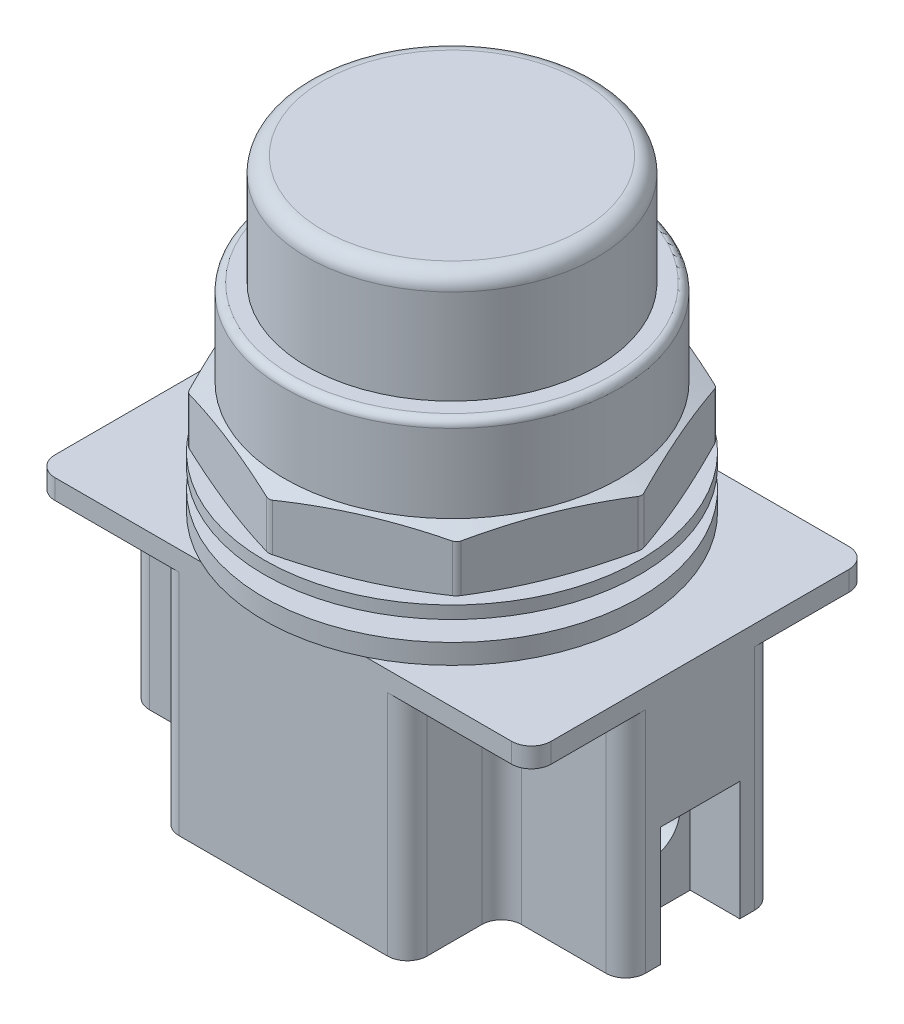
ISO-10303-21;
HEADER;
FILE_DESCRIPTION(('STEP AP214'),'2;1');
FILE_NAME('part.step','',(''),(''),'','','');
FILE_SCHEMA(('AUTOMOTIVE_DESIGN { 1 0 10303 214 1 1 1 1 }'));
ENDSEC;
DATA;
#1=APPLICATION_CONTEXT('core data for automotive mechanical design processes');
#2=APPLICATION_PROTOCOL_DEFINITION('international standard','automotive_design',2000,#1);
#3=PRODUCT_CONTEXT('',#1,'mechanical');
#4=PRODUCT('Part','Part','',(#3));
#5=PRODUCT_RELATED_PRODUCT_CATEGORY('part','',(#4));
#6=PRODUCT_DEFINITION_FORMATION('','',#4);
#7=PRODUCT_DEFINITION_CONTEXT('part definition',#1,'design');
#8=PRODUCT_DEFINITION('design','',#6,#7);
#9=PRODUCT_DEFINITION_SHAPE('','',#8);
#10=(LENGTH_UNIT() NAMED_UNIT(*) SI_UNIT(.MILLI.,.METRE.));
#11=(NAMED_UNIT(*) PLANE_ANGLE_UNIT() SI_UNIT($,.RADIAN.));
#12=(NAMED_UNIT(*) SI_UNIT($,.STERADIAN.) SOLID_ANGLE_UNIT());
#13=UNCERTAINTY_MEASURE_WITH_UNIT(LENGTH_MEASURE(1.E-05),#10,'distance_accuracy_value','');
#14=(GEOMETRIC_REPRESENTATION_CONTEXT(3) GLOBAL_UNCERTAINTY_ASSIGNED_CONTEXT((#13)) GLOBAL_UNIT_ASSIGNED_CONTEXT((#10,
#11,#12)) REPRESENTATION_CONTEXT('',''));
#15=CARTESIAN_POINT('',(0.,0.,0.));
#16=DIRECTION('',(0.,0.,1.));
#17=DIRECTION('',(1.,0.,0.));
#18=AXIS2_PLACEMENT_3D('',#15,#16,#17);
#19=CARTESIAN_POINT('',(11.,-25.,0.));
#20=DIRECTION('',(0.,1.,0.));
#21=DIRECTION('',(0.,0.,1.));
#22=AXIS2_PLACEMENT_3D('',#19,#20,#21);
#23=PLANE('',#22);
#24=DIRECTION('',(0.345746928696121,0.,-0.938327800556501));
#25=VECTOR('',#24,1.);
#26=CARTESIAN_POINT('',(16.2617893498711,-25.,-15.7261938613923));
#27=LINE('',#26,#25);
#28=CARTESIAN_POINT('',(9.5081028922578,-25.,2.60273760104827));
#29=VERTEX_POINT('',#28);
#30=CARTESIAN_POINT('',(11.5535693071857,-25.,-2.94848452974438));
#31=VERTEX_POINT('',#30);
#32=EDGE_CURVE('E443',#29,#31,#27,.T.);
#33=ORIENTED_EDGE('',*,*,#32,.F.);
#34=CARTESIAN_POINT('',(11.,-25.,0.));
#35=DIRECTION('',(0.,-1.,0.));
#36=DIRECTION('',(0.,0.,1.));
#37=AXIS2_PLACEMENT_3D('',#34,#35,#36);
#38=CIRCLE('',#37,3.);
#39=EDGE_CURVE('E486',#29,#31,#38,.T.);
#40=ORIENTED_EDGE('',*,*,#39,.T.);
#41=EDGE_LOOP('',(#33,#40));
#42=FACE_BOUND('',#41,.T.);
#43=ADVANCED_FACE('F20',(#42),#23,.F.);
#44=CARTESIAN_POINT('',(-11.,-25.,0.));
#45=DIRECTION('',(0.,-1.,0.));
#46=DIRECTION('',(0.,0.,-1.));
#47=AXIS2_PLACEMENT_3D('',#44,#45,#46);
#48=PLANE('',#47);
#49=CARTESIAN_POINT('',(-11.,-25.,0.));
#50=DIRECTION('',(0.,-1.,0.));
#51=DIRECTION('',(0.,0.,-1.));
#52=AXIS2_PLACEMENT_3D('',#49,#50,#51);
#53=CIRCLE('',#52,3.);
#54=CARTESIAN_POINT('',(-8.64950926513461,-25.,1.86418703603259));
#55=VERTEX_POINT('',#54);
#56=CARTESIAN_POINT('',(-13.83261231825,-25.,-0.988082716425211));
#57=VERTEX_POINT('',#56);
#58=EDGE_CURVE('E592',#55,#57,#53,.T.);
#59=ORIENTED_EDGE('',*,*,#58,.T.);
#60=DIRECTION('',(0.876104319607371,0.,0.482121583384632));
#61=VECTOR('',#60,1.);
#62=CARTESIAN_POINT('',(-12.3437816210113,-25.,-0.16877684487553));
#63=LINE('',#62,#61);
#64=EDGE_CURVE('E474',#57,#55,#63,.T.);
#65=ORIENTED_EDGE('',*,*,#64,.T.);
#66=EDGE_LOOP('',(#59,#65));
#67=FACE_BOUND('',#66,.T.);
#68=ADVANCED_FACE('F1117',(#67),#48,.T.);
#69=CARTESIAN_POINT('',(-20.,-17.,4.));
#70=DIRECTION('',(1.,0.,0.));
#71=DIRECTION('',(0.,0.,-1.));
#72=AXIS2_PLACEMENT_3D('',#69,#70,#71);
#73=PLANE('',#72);
#74=DIRECTION('',(0.,0.,1.));
#75=VECTOR('',#74,1.);
#76=CARTESIAN_POINT('',(-20.,-29.,4.));
#77=LINE('',#76,#75);
#78=CARTESIAN_POINT('',(-20.,-29.,-4.));
#79=VERTEX_POINT('',#78);
#80=CARTESIAN_POINT('',(-20.,-29.,4.));
#81=VERTEX_POINT('',#80);
#82=EDGE_CURVE('E591',#79,#81,#77,.T.);
#83=ORIENTED_EDGE('',*,*,#82,.T.);
#84=DIRECTION('',(0.,-1.,0.));
#85=VECTOR('',#84,1.);
#86=CARTESIAN_POINT('',(-20.,-17.,4.));
#87=LINE('',#86,#85);
#88=CARTESIAN_POINT('',(-20.,-17.,4.));
#89=VERTEX_POINT('',#88);
#90=EDGE_CURVE('E600',#89,#81,#87,.T.);
#91=ORIENTED_EDGE('',*,*,#90,.F.);
#92=DIRECTION('',(0.,0.,1.));
#93=VECTOR('',#92,1.);
#94=CARTESIAN_POINT('',(-20.,-17.,4.));
#95=LINE('',#94,#93);
#96=CARTESIAN_POINT('',(-20.,-17.,-4.));
#97=VERTEX_POINT('',#96);
#98=EDGE_CURVE('E581',#97,#89,#95,.T.);
#99=ORIENTED_EDGE('',*,*,#98,.F.);
#100=DIRECTION('',(0.,-1.,0.));
#101=VECTOR('',#100,1.);
#102=CARTESIAN_POINT('',(-20.,-17.,-4.));
#103=LINE('',#102,#101);
#104=EDGE_CURVE('E602',#97,#79,#103,.T.);
#105=ORIENTED_EDGE('',*,*,#104,.T.);
#106=EDGE_LOOP('',(#83,#91,#99,#105));
#107=FACE_BOUND('',#106,.T.);
#108=CARTESIAN_POINT('',(-20.,-21.3456416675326,0.));
#109=DIRECTION('',(1.,0.,0.));
#110=DIRECTION('',(0.,0.,-1.));
#111=AXIS2_PLACEMENT_3D('',#108,#109,#110);
#112=CIRCLE('',#111,3.);
#113=CARTESIAN_POINT('',(-20.,-21.3456416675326,-3.));
#114=VERTEX_POINT('',#113);
#115=EDGE_CURVE('E525',#114,#114,#112,.T.);
#116=ORIENTED_EDGE('',*,*,#115,.T.);
#117=EDGE_LOOP('',(#116));
#118=FACE_BOUND('',#117,.T.);
#119=ADVANCED_FACE('F1124',(#107,#118),#73,.F.);
#120=CARTESIAN_POINT('',(0.,-4.,0.));
#121=DIRECTION('',(0.,-1.,0.));
#122=DIRECTION('',(0.,0.,-1.));
#123=AXIS2_PLACEMENT_3D('',#120,#121,#122);
#124=PLANE('',#123);
#125=DIRECTION('',(-1.,0.,0.));
#126=VECTOR('',#125,1.);
#127=CARTESIAN_POINT('',(-23.,-4.,17.));
#128=LINE('',#127,#126);
#129=CARTESIAN_POINT('',(8.31143363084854,-4.,17.));
#130=VERTEX_POINT('',#129);
#131=CARTESIAN_POINT('',(-8.31143363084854,-4.,17.));
#132=VERTEX_POINT('',#131);
#133=EDGE_CURVE('E758',#130,#132,#128,.T.);
#134=ORIENTED_EDGE('',*,*,#133,.F.);
#135=CARTESIAN_POINT('',(0.,-4.,0.));
#136=DIRECTION('',(0.,-1.,0.));
#137=DIRECTION('',(0.,0.,-1.));
#138=AXIS2_PLACEMENT_3D('',#135,#136,#137);
#139=CIRCLE('',#138,18.923);
#140=EDGE_CURVE('E779',#130,#132,#139,.T.);
#141=ORIENTED_EDGE('',*,*,#140,.T.);
#142=EDGE_LOOP('',(#134,#141));
#143=FACE_BOUND('',#142,.T.);
#144=ADVANCED_FACE('F1670',(#143),#124,.T.);
#145=CARTESIAN_POINT('',(0.,0.,0.));
#146=DIRECTION('',(0.,1.,0.));
#147=DIRECTION('',(0.,0.,1.));
#148=AXIS2_PLACEMENT_3D('',#145,#146,#147);
#149=PLANE('',#148);
#150=CARTESIAN_POINT('',(0.,0.,0.));
#151=DIRECTION('',(0.,1.,0.));
#152=DIRECTION('',(0.,0.,1.));
#153=AXIS2_PLACEMENT_3D('',#150,#151,#152);
#154=CIRCLE('',#153,18.923);
#155=CARTESIAN_POINT('',(0.,0.,18.923));
#156=VERTEX_POINT('',#155);
#157=EDGE_CURVE('E994',#156,#156,#154,.T.);
#158=ORIENTED_EDGE('',*,*,#157,.F.);
#159=EDGE_LOOP('',(#158));
#160=FACE_BOUND('',#159,.T.);
#161=CARTESIAN_POINT('',(0.,0.,0.));
#162=DIRECTION('',(0.,1.,0.));
#163=DIRECTION('',(0.,0.,1.));
#164=AXIS2_PLACEMENT_3D('',#161,#162,#163);
#165=CIRCLE('',#164,15.);
#166=CARTESIAN_POINT('',(0.,0.,15.));
#167=VERTEX_POINT('',#166);
#168=EDGE_CURVE('E1009',#167,#167,#165,.F.);
#169=ORIENTED_EDGE('',*,*,#168,.F.);
#170=EDGE_LOOP('',(#169));
#171=FACE_BOUND('',#170,.T.);
#172=ADVANCED_FACE('F1921',(#160,#171),#149,.F.);
#173=CARTESIAN_POINT('',(0.,36.068,0.));
#174=DIRECTION('',(0.,1.,0.));
#175=DIRECTION('',(-0.125066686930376,0.,0.992148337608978));
#176=AXIS2_PLACEMENT_3D('',#173,#174,#175);
#177=CYLINDRICAL_SURFACE('',#176,14.605);
#178=CARTESIAN_POINT('',(0.,25.527,0.));
#179=DIRECTION('',(0.,1.,0.));
#180=DIRECTION('',(-1.,0.,0.));
#181=AXIS2_PLACEMENT_3D('',#178,#179,#180);
#182=CIRCLE('',#181,14.605);
#183=CARTESIAN_POINT('',(-14.605,25.527,0.));
#184=VERTEX_POINT('',#183);
#185=EDGE_CURVE('E1006',#184,#184,#182,.F.);
#186=ORIENTED_EDGE('',*,*,#185,.T.);
#187=EDGE_LOOP('',(#186));
#188=FACE_BOUND('',#187,.T.);
#189=CARTESIAN_POINT('',(0.,16.002,0.));
#190=DIRECTION('',(0.,1.,0.));
#191=DIRECTION('',(-1.,0.,0.));
#192=AXIS2_PLACEMENT_3D('',#189,#190,#191);
#193=CIRCLE('',#192,14.605);
#194=CARTESIAN_POINT('',(-14.605,16.002,0.));
#195=VERTEX_POINT('',#194);
#196=EDGE_CURVE('E991',#195,#195,#193,.T.);
#197=ORIENTED_EDGE('',*,*,#196,.T.);
#198=EDGE_LOOP('',(#197));
#199=FACE_BOUND('',#198,.T.);
#200=ADVANCED_FACE('F1912',(#188,#199),#177,.T.);
#201=CARTESIAN_POINT('',(0.,1.27,0.));
#202=DIRECTION('',(0.,1.,0.));
#203=DIRECTION('',(0.,0.,1.));
#204=AXIS2_PLACEMENT_3D('',#201,#202,#203);
#205=PLANE('',#204);
#206=CARTESIAN_POINT('',(0.,1.27,0.));
#207=DIRECTION('',(0.,1.,0.));
#208=DIRECTION('',(0.,0.,1.));
#209=AXIS2_PLACEMENT_3D('',#206,#207,#208);
#210=CIRCLE('',#209,16.891);
#211=CARTESIAN_POINT('',(0.,1.27,16.891));
#212=VERTEX_POINT('',#211);
#213=EDGE_CURVE('E1000',#212,#212,#210,.T.);
#214=ORIENTED_EDGE('',*,*,#213,.F.);
#215=EDGE_LOOP('',(#214));
#216=FACE_BOUND('',#215,.T.);
#217=CARTESIAN_POINT('',(0.,1.27,0.));
#218=DIRECTION('',(0.,1.,0.));
#219=DIRECTION('',(0.,0.,1.));
#220=AXIS2_PLACEMENT_3D('',#217,#218,#219);
#221=CIRCLE('',#220,18.923);
#222=CARTESIAN_POINT('',(0.,1.27,18.923));
#223=VERTEX_POINT('',#222);
#224=EDGE_CURVE('E997',#223,#223,#221,.T.);
#225=ORIENTED_EDGE('',*,*,#224,.T.);
#226=EDGE_LOOP('',(#225));
#227=FACE_BOUND('',#226,.T.);
#228=ADVANCED_FACE('F1903',(#216,#227),#205,.T.);
#229=CARTESIAN_POINT('',(0.,1.27,0.));
#230=DIRECTION('',(0.,-1.,0.));
#231=DIRECTION('',(0.,0.,-1.));
#232=AXIS2_PLACEMENT_3D('',#229,#230,#231);
#233=CYLINDRICAL_SURFACE('',#232,18.923);
#234=ORIENTED_EDGE('',*,*,#224,.F.);
#235=EDGE_LOOP('',(#234));
#236=FACE_BOUND('',#235,.T.);
#237=ORIENTED_EDGE('',*,*,#157,.T.);
#238=EDGE_LOOP('',(#237));
#239=FACE_BOUND('',#238,.T.);
#240=ADVANCED_FACE('F1893',(#236,#239),#233,.T.);
#241=CARTESIAN_POINT('',(0.,16.002,0.));
#242=DIRECTION('',(0.,1.,0.));
#243=DIRECTION('',(-0.916863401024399,0.,0.399201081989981));
#244=AXIS2_PLACEMENT_3D('',#241,#242,#243);
#245=PLANE('',#244);
#246=CARTESIAN_POINT('',(0.,16.002,0.));
#247=DIRECTION('',(0.,1.,0.));
#248=DIRECTION('',(-0.916863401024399,0.,0.399201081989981));
#249=AXIS2_PLACEMENT_3D('',#246,#247,#248);
#250=CIRCLE('',#249,16.129);
#251=CARTESIAN_POINT('',(-14.7880897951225,16.002,6.43871425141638));
#252=VERTEX_POINT('',#251);
#253=EDGE_CURVE('E821',#252,#252,#250,.T.);
#254=ORIENTED_EDGE('',*,*,#253,.T.);
#255=EDGE_LOOP('',(#254));
#256=FACE_BOUND('',#255,.T.);
#257=ORIENTED_EDGE('',*,*,#196,.F.);
#258=EDGE_LOOP('',(#257));
#259=FACE_BOUND('',#258,.T.);
#260=ADVANCED_FACE('F1883',(#256,#259),#245,.T.);
#261=CARTESIAN_POINT('',(0.,16.002,0.));
#262=DIRECTION('',(0.,-1.,0.));
#263=DIRECTION('',(0.916863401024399,0.,-0.399201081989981));
#264=AXIS2_PLACEMENT_3D('',#261,#262,#263);
#265=CYLINDRICAL_SURFACE('',#264,16.891);
#266=CARTESIAN_POINT('',(0.,15.24,0.));
#267=DIRECTION('',(0.,1.,0.));
#268=DIRECTION('',(-0.916863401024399,0.,0.399201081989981));
#269=AXIS2_PLACEMENT_3D('',#266,#267,#268);
#270=CIRCLE('',#269,16.891);
#271=CARTESIAN_POINT('',(-15.4867397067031,15.24,6.74290547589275));
#272=VERTEX_POINT('',#271);
#273=EDGE_CURVE('E2024',#272,#272,#270,.F.);
#274=ORIENTED_EDGE('',*,*,#273,.T.);
#275=EDGE_LOOP('',(#274));
#276=FACE_BOUND('',#275,.T.);
#277=CARTESIAN_POINT('',(0.,7.366,0.));
#278=DIRECTION('',(0.,1.,0.));
#279=DIRECTION('',(-0.916863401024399,0.,0.399201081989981));
#280=AXIS2_PLACEMENT_3D('',#277,#278,#279);
#281=CIRCLE('',#280,16.891);
#282=CARTESIAN_POINT('',(-15.4867397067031,7.366,6.74290547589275));
#283=VERTEX_POINT('',#282);
#284=EDGE_CURVE('E785',#283,#283,#281,.T.);
#285=ORIENTED_EDGE('',*,*,#284,.T.);
#286=EDGE_LOOP('',(#285));
#287=FACE_BOUND('',#286,.T.);
#288=ADVANCED_FACE('F1875',(#276,#287),#265,.T.);
#289=CARTESIAN_POINT('',(0.,2.05581173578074,0.));
#290=DIRECTION('',(0.,1.,0.));
#291=DIRECTION('',(-0.916863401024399,0.,0.399201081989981));
#292=AXIS2_PLACEMENT_3D('',#289,#290,#291);
#293=CONICAL_SURFACE('',#292,19.05,1.22173047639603);
#294=ORIENTED_EDGE('',*,*,#213,.T.);
#295=EDGE_LOOP('',(#294));
#296=FACE_BOUND('',#295,.T.);
#297=CARTESIAN_POINT('',(-0.338218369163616,1.97670285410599,-18.8296128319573));
#298=CARTESIAN_POINT('',(-0.0598040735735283,1.93502945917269,-18.7201010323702));
#299=CARTESIAN_POINT('',(0.218890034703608,1.89553119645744,-18.6104791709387));
#300=CARTESIAN_POINT('',(0.776819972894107,1.82114685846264,-18.3910223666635));
#301=CARTESIAN_POINT('',(1.05605582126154,1.78626094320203,-18.2811874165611));
#302=CARTESIAN_POINT('',(1.89462693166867,1.6889063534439,-17.9513428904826));
#303=CARTESIAN_POINT('',(2.45471933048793,1.63375696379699,-17.7310355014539));
#304=CARTESIAN_POINT('',(3.57344790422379,1.54502583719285,-17.290993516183));
#305=CARTESIAN_POINT('',(4.13207641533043,1.51133300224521,-17.0712619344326));
#306=CARTESIAN_POINT('',(5.25006137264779,1.46626978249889,-16.6315124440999));
#307=CARTESIAN_POINT('',(5.80941772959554,1.45489687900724,-16.4114945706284));
#308=CARTESIAN_POINT('',(6.92813044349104,1.45489687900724,-15.9714588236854));
#309=CARTESIAN_POINT('',(7.48748680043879,1.46626978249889,-15.7514409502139));
#310=CARTESIAN_POINT('',(8.60547175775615,1.51133300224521,-15.3116914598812));
#311=CARTESIAN_POINT('',(9.1641002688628,1.54502583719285,-15.0919598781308));
#312=CARTESIAN_POINT('',(10.2828288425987,1.63375696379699,-14.6519178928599));
#313=CARTESIAN_POINT('',(10.8429212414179,1.6889063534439,-14.4316105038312));
#314=CARTESIAN_POINT('',(11.681492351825,1.78626094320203,-14.1017659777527));
#315=CARTESIAN_POINT('',(11.9607282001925,1.82114685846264,-13.9919310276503));
#316=CARTESIAN_POINT('',(12.518658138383,1.89553119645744,-13.7724742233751));
#317=CARTESIAN_POINT('',(12.7973522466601,1.93502945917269,-13.6628523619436));
#318=CARTESIAN_POINT('',(13.0757665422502,1.97670285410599,-13.5533405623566));
#319=B_SPLINE_CURVE_WITH_KNOTS('',3,(#297,#298,#299,#300,#301,#302,#303,#304,#305,#306,#307,
#308,#309,#310,#311,#312,#313,#314,#315,#316,#317,#318),.UNSPECIFIED.,.F.,.F.,(4,2,2,2,2,2,2,2,
2,2,4),(0.,0.906184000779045,1.81239943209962,3.62517663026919,5.42848961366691,
7.23159909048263,9.03470856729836,10.8380215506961,12.6507987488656,13.5570141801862,
14.4631981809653),.UNSPECIFIED.);
#320=CARTESIAN_POINT('',(-0.0442297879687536,1.93352767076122,-18.7139750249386));
#321=VERTEX_POINT('',#320);
#322=CARTESIAN_POINT('',(12.7817779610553,1.93352767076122,-13.6689783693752));
#323=VERTEX_POINT('',#322);
#324=EDGE_CURVE('E2066',#321,#323,#319,.T.);
#325=ORIENTED_EDGE('',*,*,#324,.T.);
#326=CARTESIAN_POINT('',(12.7817779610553,1.93352767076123,-13.6689783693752));
#327=CARTESIAN_POINT('',(12.8193557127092,1.93895074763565,-13.6542451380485));
#328=CARTESIAN_POINT('',(12.8558649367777,1.94332343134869,-13.6363931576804));
#329=CARTESIAN_POINT('',(12.92573807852,1.94987746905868,-13.5950338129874));
#330=CARTESIAN_POINT('',(12.9591021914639,1.95205895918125,-13.571526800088));
#331=CARTESIAN_POINT('',(13.021720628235,1.95414205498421,-13.51940519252));
#332=CARTESIAN_POINT('',(13.0509697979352,1.95404082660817,-13.49078429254));
#333=CARTESIAN_POINT('',(13.1044422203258,1.95155773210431,-13.4293181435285));
#334=CARTESIAN_POINT('',(13.1286728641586,1.94917924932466,-13.3964792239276));
#335=CARTESIAN_POINT('',(13.159852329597,1.94412458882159,-13.3463099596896));
#336=CARTESIAN_POINT('',(13.169040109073,1.94231157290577,-13.3302425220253));
#337=CARTESIAN_POINT('',(13.1861917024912,1.93824589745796,-13.2975498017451));
#338=CARTESIAN_POINT('',(13.1941572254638,1.93599386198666,-13.280925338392));
#339=CARTESIAN_POINT('',(13.2015034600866,1.93352767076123,-13.2640538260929));
#340=B_SPLINE_CURVE_WITH_KNOTS('',3,(#326,#327,#328,#329,#330,#331,#332,#333,#334,#335,#336,
#337,#338,#339),.UNSPECIFIED.,.F.,.F.,(4,2,2,2,2,2,4),(0.,0.12204297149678,0.244078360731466,
0.366265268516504,0.488270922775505,0.544018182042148,0.599686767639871),.UNSPECIFIED.);
#341=CARTESIAN_POINT('',(13.2015034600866,1.93352767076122,-13.2640538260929));
#342=VERTEX_POINT('',#341);
#343=EDGE_CURVE('E951',#323,#342,#340,.T.);
#344=ORIENTED_EDGE('',*,*,#343,.T.);
#345=CARTESIAN_POINT('',(6.43407795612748,5.86544899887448,-28.8071098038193));
#346=CARTESIAN_POINT('',(6.58584888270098,5.7536714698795,-28.4585305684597));
#347=CARTESIAN_POINT('',(6.73771943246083,5.6427433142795,-28.1097225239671));
#348=CARTESIAN_POINT('',(7.04167984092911,5.42277764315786,-27.4116027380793));
#349=CARTESIAN_POINT('',(7.19376970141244,5.31374014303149,-27.0622909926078));
#350=CARTESIAN_POINT('',(7.65042725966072,4.98973103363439,-26.0134646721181));
#351=CARTESIAN_POINT('',(7.95535041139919,4.77788685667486,-25.313133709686));
#352=CARTESIAN_POINT('',(8.56717319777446,4.36387789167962,-23.9079323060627));
#353=CARTESIAN_POINT('',(8.87407598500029,4.16174224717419,-23.203054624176));
#354=CARTESIAN_POINT('',(9.4891778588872,3.77026939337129,-21.7903219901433));
#355=CARTESIAN_POINT('',(9.79737691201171,3.58093185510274,-21.0824671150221));
#356=CARTESIAN_POINT('',(10.4109296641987,3.22070136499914,-19.6732924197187));
#357=CARTESIAN_POINT('',(10.7162624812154,3.04958659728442,-18.972020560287));
#358=CARTESIAN_POINT('',(11.3285538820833,2.72646062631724,-17.5657428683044));
#359=CARTESIAN_POINT('',(11.6355124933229,2.57444974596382,-16.8607369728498));
#360=CARTESIAN_POINT('',(12.250883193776,2.2939707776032,-15.4473869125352));
#361=CARTESIAN_POINT('',(12.559293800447,2.16548249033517,-14.7390461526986));
#362=CARTESIAN_POINT('',(13.1777693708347,1.93666096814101,-13.3185649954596));
#363=CARTESIAN_POINT('',(13.4878341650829,1.83632490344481,-12.6064249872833));
#364=CARTESIAN_POINT('',(14.0757478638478,1.67756267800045,-11.2561366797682));
#365=CARTESIAN_POINT('',(14.3534507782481,1.61577551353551,-10.6183236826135));
#366=CARTESIAN_POINT('',(14.9096447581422,1.52103696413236,-9.3408875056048));
#367=CARTESIAN_POINT('',(15.1881358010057,1.48808475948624,-8.701264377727));
#368=CARTESIAN_POINT('',(15.7453744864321,1.45264440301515,-7.42142877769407));
#369=CARTESIAN_POINT('',(16.0241220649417,1.45015002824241,-6.78121645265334));
#370=CARTESIAN_POINT('',(16.5813929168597,1.47573689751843,-5.5013069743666));
#371=CARTESIAN_POINT('',(16.8599161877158,1.50381848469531,-4.86160982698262));
#372=CARTESIAN_POINT('',(17.4175367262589,1.58935691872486,-3.58089720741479));
#373=CARTESIAN_POINT('',(17.6966306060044,1.64695025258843,-2.93988951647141));
#374=CARTESIAN_POINT('',(18.2537186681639,1.78895737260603,-1.66039985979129));
#375=CARTESIAN_POINT('',(18.5317128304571,1.87337164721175,-1.02191794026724));
#376=CARTESIAN_POINT('',(19.0865402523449,2.06577480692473,0.252379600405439));
#377=CARTESIAN_POINT('',(19.3633727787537,2.1737768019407,0.888193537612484));
#378=CARTESIAN_POINT('',(19.9156594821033,2.4098692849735,2.15665569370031));
#379=CARTESIAN_POINT('',(20.191113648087,2.53795993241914,2.78930388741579));
#380=CARTESIAN_POINT('',(20.6804428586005,2.78105529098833,3.91316868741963));
#381=CARTESIAN_POINT('',(20.894580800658,2.89277382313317,4.40498910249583));
#382=CARTESIAN_POINT('',(21.3220899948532,3.12509702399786,5.38686904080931));
#383=CARTESIAN_POINT('',(21.5354612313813,3.24570187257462,5.87692852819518));
#384=CARTESIAN_POINT('',(21.9615024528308,3.49457604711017,6.85543690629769));
#385=CARTESIAN_POINT('',(22.1741723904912,3.62284587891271,7.34388568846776));
#386=CARTESIAN_POINT('',(22.5988626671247,3.88598147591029,8.31929128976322));
#387=CARTESIAN_POINT('',(22.8108829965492,4.02084733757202,8.80624808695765));
#388=CARTESIAN_POINT('',(23.2343910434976,4.29629603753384,9.778938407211));
#389=CARTESIAN_POINT('',(23.4458786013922,4.43688041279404,10.2646715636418));
#390=CARTESIAN_POINT('',(23.8683245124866,4.7229592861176,11.2349224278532));
#391=CARTESIAN_POINT('',(24.0792828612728,4.8684538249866,11.7194401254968));
#392=CARTESIAN_POINT('',(24.7114253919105,5.31126558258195,13.1713108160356));
#393=CARTESIAN_POINT('',(25.1319017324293,5.61492716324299,14.1370380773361));
#394=CARTESIAN_POINT('',(25.9667573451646,6.23161176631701,16.0544891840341));
#395=CARTESIAN_POINT('',(26.3811530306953,6.54449621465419,17.0062507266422));
#396=CARTESIAN_POINT('',(27.2087726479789,7.17988452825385,18.9070825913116));
#397=CARTESIAN_POINT('',(27.6219965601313,7.50238855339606,19.8561528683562));
#398=CARTESIAN_POINT('',(28.4468700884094,8.15440659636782,21.7506776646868));
#399=CARTESIAN_POINT('',(28.8585211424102,8.48390922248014,22.6961354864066));
#400=CARTESIAN_POINT('',(29.4754131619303,8.98260907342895,24.1129796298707));
#401=CARTESIAN_POINT('',(29.6809417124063,9.14957947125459,24.5850264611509));
#402=CARTESIAN_POINT('',(30.091824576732,9.48485570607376,25.5287199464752));
#403=CARTESIAN_POINT('',(30.2971788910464,9.6531615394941,26.0003666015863));
#404=CARTESIAN_POINT('',(30.5024553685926,9.82206107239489,26.4718344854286));
#405=B_SPLINE_CURVE_WITH_KNOTS('',3,(#345,#346,#347,#348,#349,#350,#351,#352,#353,#354,#355,
#356,#357,#358,#359,#360,#361,#362,#363,#364,#365,#366,#367,#368,#369,#370,#371,#372,#373,#374,
#375,#376,#377,#378,#379,#380,#381,#382,#383,#384,#385,#386,#387,#388,#389,#390,#391,#392,#393,
#394,#395,#396,#397,#398,#399,#400,#401,#402,#403,#404),.UNSPECIFIED.,.F.,.F.,(4,2,2,2,2,2,2,2,
2,2,2,2,2,2,2,2,2,2,2,2,2,2,2,2,2,2,2,2,2,4),(0.,1.18883161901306,2.37767291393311,
4.75561032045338,7.14028914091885,9.52490664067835,11.8760120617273,14.2271572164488,
16.5762738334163,18.9251542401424,21.0197682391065,23.1143226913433,25.208449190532,
27.3025991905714,29.4065228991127,31.510484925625,33.6156193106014,35.7207704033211,
37.3644706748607,39.0082042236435,40.6520463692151,42.295912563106,43.940223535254,
45.5845481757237,48.8730057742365,52.1255253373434,55.3780989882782,58.625732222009,
60.2494745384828,61.8732125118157),.UNSPECIFIED.);
#406=CARTESIAN_POINT('',(18.7035091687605,1.93352767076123,-0.627345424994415));
#407=VERTEX_POINT('',#406);
#408=EDGE_CURVE('E2070',#407,#342,#405,.F.);
#409=ORIENTED_EDGE('',*,*,#408,.F.);
#410=CARTESIAN_POINT('',(18.7035091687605,1.93352767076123,-0.627345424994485));
#411=CARTESIAN_POINT('',(18.7196626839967,1.93895074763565,-0.590355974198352));
#412=CARTESIAN_POINT('',(18.7328553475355,1.94332343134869,-0.551916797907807));
#413=CARTESIAN_POINT('',(18.7530176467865,1.94987746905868,-0.473263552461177));
#414=CARTESIAN_POINT('',(18.7599876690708,1.95205895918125,-0.433049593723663));
#415=CARTESIAN_POINT('',(18.7674100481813,1.95414205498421,-0.351916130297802));
#416=CARTESIAN_POINT('',(18.7678543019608,1.95404082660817,-0.31099581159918));
#417=CARTESIAN_POINT('',(18.7622018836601,1.95155773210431,-0.22972196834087));
#418=CARTESIAN_POINT('',(18.7561149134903,1.94917924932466,-0.189367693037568));
#419=CARTESIAN_POINT('',(18.7426870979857,1.94412458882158,-0.131845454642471));
#420=CARTESIAN_POINT('',(18.7378224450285,1.94231157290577,-0.11398731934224));
#421=CARTESIAN_POINT('',(18.7268332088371,1.93824589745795,-0.0787420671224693));
#422=CARTESIAN_POINT('',(18.7207104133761,1.93599386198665,-0.0613543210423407));
#423=CARTESIAN_POINT('',(18.7139750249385,1.93352767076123,-0.0442297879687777));
#424=B_SPLINE_CURVE_WITH_KNOTS('',3,(#410,#411,#412,#413,#414,#415,#416,#417,#418,#419,#420,
#421,#422,#423),.UNSPECIFIED.,.F.,.F.,(4,2,2,2,2,2,4),(0.,0.122042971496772,0.24407836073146,
0.366265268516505,0.488270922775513,0.544018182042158,0.599686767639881),.UNSPECIFIED.);
#425=CARTESIAN_POINT('',(18.7139750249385,1.93352767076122,-0.0442297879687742));
#426=VERTEX_POINT('',#425);
#427=EDGE_CURVE('E945',#407,#426,#424,.T.);
#428=ORIENTED_EDGE('',*,*,#427,.T.);
#429=CARTESIAN_POINT('',(13.5533405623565,1.97670285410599,13.0757665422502));
#430=CARTESIAN_POINT('',(13.6628523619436,1.9350294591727,12.7973522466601));
#431=CARTESIAN_POINT('',(13.7724742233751,1.89553119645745,12.518658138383));
#432=CARTESIAN_POINT('',(13.9919310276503,1.82114685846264,11.9607282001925));
#433=CARTESIAN_POINT('',(14.1017659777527,1.78626094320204,11.681492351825));
#434=CARTESIAN_POINT('',(14.4316105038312,1.6889063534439,10.8429212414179));
#435=CARTESIAN_POINT('',(14.6519178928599,1.63375696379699,10.2828288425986));
#436=CARTESIAN_POINT('',(15.0919598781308,1.54502583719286,9.16410026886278));
#437=CARTESIAN_POINT('',(15.3116914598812,1.51133300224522,8.60547175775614));
#438=CARTESIAN_POINT('',(15.7514409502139,1.4662697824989,7.48748680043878));
#439=CARTESIAN_POINT('',(15.9714588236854,1.45489687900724,6.92813044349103));
#440=CARTESIAN_POINT('',(16.4114945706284,1.45489687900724,5.80941772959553));
#441=CARTESIAN_POINT('',(16.6315124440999,1.4662697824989,5.25006137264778));
#442=CARTESIAN_POINT('',(17.0712619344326,1.51133300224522,4.13207641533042));
#443=CARTESIAN_POINT('',(17.290993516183,1.54502583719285,3.57344790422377));
#444=CARTESIAN_POINT('',(17.7310355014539,1.63375696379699,2.45471933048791));
#445=CARTESIAN_POINT('',(17.9513428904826,1.6889063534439,1.89462693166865));
#446=CARTESIAN_POINT('',(18.2811874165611,1.78626094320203,1.05605582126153));
#447=CARTESIAN_POINT('',(18.3910223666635,1.82114685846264,0.776819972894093));
#448=CARTESIAN_POINT('',(18.6104791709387,1.89553119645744,0.218890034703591));
#449=CARTESIAN_POINT('',(18.7201010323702,1.9350294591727,-0.0598040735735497));
#450=CARTESIAN_POINT('',(18.8296128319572,1.97670285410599,-0.338218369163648));
#451=B_SPLINE_CURVE_WITH_KNOTS('',3,(#429,#430,#431,#432,#433,#434,#435,#436,#437,#438,#439,
#440,#441,#442,#443,#444,#445,#446,#447,#448,#449,#450),.UNSPECIFIED.,.F.,.F.,(4,2,2,2,2,2,2,2,
2,2,4),(0.,0.906184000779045,1.81239943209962,3.62517663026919,5.42848961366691,
7.23159909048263,9.03470856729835,10.8380215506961,12.6507987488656,13.5570141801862,
14.4631981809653),.UNSPECIFIED.);
#452=CARTESIAN_POINT('',(13.6689783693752,1.93352767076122,12.7817779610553));
#453=VERTEX_POINT('',#452);
#454=EDGE_CURVE('E796',#453,#426,#451,.T.);
#455=ORIENTED_EDGE('',*,*,#454,.F.);
#456=CARTESIAN_POINT('',(13.6689783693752,1.93352767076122,12.7817779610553));
#457=CARTESIAN_POINT('',(13.6542451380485,1.93895074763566,12.8193557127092));
#458=CARTESIAN_POINT('',(13.6363931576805,1.94332343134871,12.8558649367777));
#459=CARTESIAN_POINT('',(13.5950338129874,1.94987746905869,12.92573807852));
#460=CARTESIAN_POINT('',(13.571526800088,1.95205895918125,12.9591021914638));
#461=CARTESIAN_POINT('',(13.51940519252,1.95414205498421,13.021720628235));
#462=CARTESIAN_POINT('',(13.49078429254,1.95404082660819,13.0509697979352));
#463=CARTESIAN_POINT('',(13.4293181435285,1.95155773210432,13.1044422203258));
#464=CARTESIAN_POINT('',(13.3964792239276,1.94917924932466,13.1286728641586));
#465=CARTESIAN_POINT('',(13.3463099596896,1.94412458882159,13.1598523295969));
#466=CARTESIAN_POINT('',(13.3302425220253,1.94231157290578,13.169040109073));
#467=CARTESIAN_POINT('',(13.2975498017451,1.93824589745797,13.1861917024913));
#468=CARTESIAN_POINT('',(13.280925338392,1.93599386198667,13.1941572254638));
#469=CARTESIAN_POINT('',(13.2640538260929,1.93352767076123,13.2015034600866));
#470=B_SPLINE_CURVE_WITH_KNOTS('',3,(#456,#457,#458,#459,#460,#461,#462,#463,#464,#465,#466,
#467,#468,#469),.UNSPECIFIED.,.F.,.F.,(4,2,2,2,2,2,4),(0.,0.122042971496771,0.244078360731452,
0.366265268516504,0.488270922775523,0.54401818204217,0.599686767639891),.UNSPECIFIED.);
#471=CARTESIAN_POINT('',(13.2640538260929,1.93352767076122,13.2015034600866));
#472=VERTEX_POINT('',#471);
#473=EDGE_CURVE('E952',#453,#472,#470,.T.);
#474=ORIENTED_EDGE('',*,*,#473,.T.);
#475=CARTESIAN_POINT('',(28.8071098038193,5.86544899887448,6.43407795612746));
#476=CARTESIAN_POINT('',(28.4585305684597,5.75367146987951,6.58584888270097));
#477=CARTESIAN_POINT('',(28.1097225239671,5.64274331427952,6.73771943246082));
#478=CARTESIAN_POINT('',(27.4116027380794,5.42277764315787,7.0416798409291));
#479=CARTESIAN_POINT('',(27.0622909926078,5.3137401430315,7.19376970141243));
#480=CARTESIAN_POINT('',(26.0134646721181,4.98973103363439,7.65042725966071));
#481=CARTESIAN_POINT('',(25.313133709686,4.77788685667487,7.95535041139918));
#482=CARTESIAN_POINT('',(23.9079323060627,4.36387789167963,8.56717319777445));
#483=CARTESIAN_POINT('',(23.203054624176,4.1617422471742,8.87407598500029));
#484=CARTESIAN_POINT('',(21.7903219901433,3.7702693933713,9.48917785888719));
#485=CARTESIAN_POINT('',(21.0824671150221,3.58093185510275,9.7973769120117));
#486=CARTESIAN_POINT('',(19.6732924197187,3.22070136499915,10.4109296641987));
#487=CARTESIAN_POINT('',(18.972020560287,3.04958659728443,10.7162624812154));
#488=CARTESIAN_POINT('',(17.5657428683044,2.72646062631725,11.3285538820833));
#489=CARTESIAN_POINT('',(16.8607369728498,2.57444974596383,11.6355124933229));
#490=CARTESIAN_POINT('',(15.4473869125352,2.29397077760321,12.250883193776));
#491=CARTESIAN_POINT('',(14.7390461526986,2.16548249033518,12.559293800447));
#492=CARTESIAN_POINT('',(13.3185649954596,1.93666096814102,13.1777693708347));
#493=CARTESIAN_POINT('',(12.6064249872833,1.83632490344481,13.4878341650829));
#494=CARTESIAN_POINT('',(11.2561366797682,1.67756267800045,14.0757478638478));
#495=CARTESIAN_POINT('',(10.6183236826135,1.61577551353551,14.3534507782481));
#496=CARTESIAN_POINT('',(9.3408875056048,1.52103696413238,14.9096447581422));
#497=CARTESIAN_POINT('',(8.701264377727,1.48808475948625,15.1881358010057));
#498=CARTESIAN_POINT('',(7.42142877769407,1.45264440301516,15.7453744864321));
#499=CARTESIAN_POINT('',(6.78121645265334,1.45015002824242,16.0241220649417));
#500=CARTESIAN_POINT('',(5.5013069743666,1.47573689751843,16.5813929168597));
#501=CARTESIAN_POINT('',(4.86160982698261,1.50381848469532,16.8599161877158));
#502=CARTESIAN_POINT('',(3.58089720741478,1.58935691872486,17.4175367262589));
#503=CARTESIAN_POINT('',(2.9398895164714,1.64695025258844,17.6966306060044));
#504=CARTESIAN_POINT('',(1.66039985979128,1.78895737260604,18.2537186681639));
#505=CARTESIAN_POINT('',(1.02191794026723,1.87337164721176,18.5317128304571));
#506=CARTESIAN_POINT('',(-0.252379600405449,2.06577480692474,19.0865402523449));
#507=CARTESIAN_POINT('',(-0.888193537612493,2.17377680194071,19.3633727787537));
#508=CARTESIAN_POINT('',(-2.15665569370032,2.40986928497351,19.9156594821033));
#509=CARTESIAN_POINT('',(-2.78930388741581,2.53795993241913,20.191113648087));
#510=CARTESIAN_POINT('',(-3.91316868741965,2.78105529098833,20.6804428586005));
#511=CARTESIAN_POINT('',(-4.40498910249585,2.89277382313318,20.894580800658));
#512=CARTESIAN_POINT('',(-5.38686904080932,3.12509702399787,21.3220899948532));
#513=CARTESIAN_POINT('',(-5.87692852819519,3.24570187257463,21.5354612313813));
#514=CARTESIAN_POINT('',(-6.8554369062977,3.49457604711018,21.9615024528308));
#515=CARTESIAN_POINT('',(-7.34388568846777,3.62284587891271,22.1741723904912));
#516=CARTESIAN_POINT('',(-8.31929128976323,3.8859814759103,22.5988626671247));
#517=CARTESIAN_POINT('',(-8.80624808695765,4.02084733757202,22.8108829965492));
#518=CARTESIAN_POINT('',(-9.77893840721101,4.29629603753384,23.2343910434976));
#519=CARTESIAN_POINT('',(-10.2646715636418,4.43688041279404,23.4458786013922));
#520=CARTESIAN_POINT('',(-11.2349224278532,4.7229592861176,23.8683245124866));
#521=CARTESIAN_POINT('',(-11.7194401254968,4.86845382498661,24.0792828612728));
#522=CARTESIAN_POINT('',(-13.1713108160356,5.31126558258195,24.7114253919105));
#523=CARTESIAN_POINT('',(-14.1370380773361,5.61492716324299,25.1319017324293));
#524=CARTESIAN_POINT('',(-16.0544891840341,6.23161176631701,25.9667573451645));
#525=CARTESIAN_POINT('',(-17.0062507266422,6.54449621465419,26.3811530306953));
#526=CARTESIAN_POINT('',(-18.9070825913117,7.17988452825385,27.2087726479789));
#527=CARTESIAN_POINT('',(-19.8561528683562,7.50238855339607,27.6219965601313));
#528=CARTESIAN_POINT('',(-21.7506776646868,8.15440659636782,28.4468700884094));
#529=CARTESIAN_POINT('',(-22.6961354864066,8.48390922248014,28.8585211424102));
#530=CARTESIAN_POINT('',(-24.1129796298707,8.98260907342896,29.4754131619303));
#531=CARTESIAN_POINT('',(-24.5850264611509,9.1495794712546,29.6809417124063));
#532=CARTESIAN_POINT('',(-25.5287199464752,9.48485570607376,30.091824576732));
#533=CARTESIAN_POINT('',(-26.0003666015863,9.6531615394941,30.2971788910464));
#534=CARTESIAN_POINT('',(-26.4718344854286,9.82206107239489,30.5024553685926));
#535=B_SPLINE_CURVE_WITH_KNOTS('',3,(#475,#476,#477,#478,#479,#480,#481,#482,#483,#484,#485,
#486,#487,#488,#489,#490,#491,#492,#493,#494,#495,#496,#497,#498,#499,#500,#501,#502,#503,#504,
#505,#506,#507,#508,#509,#510,#511,#512,#513,#514,#515,#516,#517,#518,#519,#520,#521,#522,#523,
#524,#525,#526,#527,#528,#529,#530,#531,#532,#533,#534),.UNSPECIFIED.,.F.,.F.,(4,2,2,2,2,2,2,2,
2,2,2,2,2,2,2,2,2,2,2,2,2,2,2,2,2,2,2,2,2,4),(0.,1.18883161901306,2.37767291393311,
4.75561032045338,7.14028914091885,9.52490664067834,11.8760120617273,14.2271572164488,
16.5762738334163,18.9251542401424,21.0197682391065,23.1143226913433,25.2084491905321,
27.3025991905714,29.4065228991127,31.510484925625,33.6156193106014,35.7207704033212,
37.3644706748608,39.0082042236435,40.6520463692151,42.295912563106,43.940223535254,
45.5845481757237,48.8730057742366,52.1255253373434,55.3780989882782,58.6257322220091,
60.2494745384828,61.8732125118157),.UNSPECIFIED.);
#536=CARTESIAN_POINT('',(0.627345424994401,1.93352767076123,18.7035091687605));
#537=VERTEX_POINT('',#536);
#538=EDGE_CURVE('E788',#537,#472,#535,.F.);
#539=ORIENTED_EDGE('',*,*,#538,.F.);
#540=CARTESIAN_POINT('',(0.627345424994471,1.93352767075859,18.7035091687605));
#541=CARTESIAN_POINT('',(0.590355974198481,1.9389507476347,18.7196626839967));
#542=CARTESIAN_POINT('',(0.551916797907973,1.94332343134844,18.7328553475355));
#543=CARTESIAN_POINT('',(0.473263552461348,1.94987746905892,18.7530176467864));
#544=CARTESIAN_POINT('',(0.433049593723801,1.95205895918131,18.7599876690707));
#545=CARTESIAN_POINT('',(0.351916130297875,1.95414205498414,18.7674100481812));
#546=CARTESIAN_POINT('',(0.310995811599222,1.95404082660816,18.7678543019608));
#547=CARTESIAN_POINT('',(0.229721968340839,1.95155773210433,18.7622018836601));
#548=CARTESIAN_POINT('',(0.189367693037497,1.94917924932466,18.7561149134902));
#549=CARTESIAN_POINT('',(0.131845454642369,1.94412458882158,18.7426870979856));
#550=CARTESIAN_POINT('',(0.113987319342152,1.94231157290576,18.7378224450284));
#551=CARTESIAN_POINT('',(0.0787420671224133,1.93824589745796,18.7268332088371));
#552=CARTESIAN_POINT('',(0.0613543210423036,1.93599386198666,18.7207104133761));
#553=CARTESIAN_POINT('',(0.0442297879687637,1.93352767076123,18.7139750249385));
#554=B_SPLINE_CURVE_WITH_KNOTS('',3,(#540,#541,#542,#543,#544,#545,#546,#547,#548,#549,#550,
#551,#552,#553),.UNSPECIFIED.,.F.,.F.,(4,2,2,2,2,2,4),(0.,0.122042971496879,0.244078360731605,
0.366265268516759,0.4882709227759,0.544018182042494,0.599686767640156),.UNSPECIFIED.);
#555=CARTESIAN_POINT('',(0.0442297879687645,1.93352767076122,18.7139750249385));
#556=VERTEX_POINT('',#555);
#557=EDGE_CURVE('E1986',#537,#556,#554,.T.);
#558=ORIENTED_EDGE('',*,*,#557,.T.);
#559=CARTESIAN_POINT('',(0.338218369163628,1.97670285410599,18.8296128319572));
#560=CARTESIAN_POINT('',(0.0598040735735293,1.9350294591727,18.7201010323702));
#561=CARTESIAN_POINT('',(-0.218890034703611,1.89553119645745,18.6104791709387));
#562=CARTESIAN_POINT('',(-0.776819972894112,1.82114685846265,18.3910223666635));
#563=CARTESIAN_POINT('',(-1.05605582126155,1.78626094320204,18.2811874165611));
#564=CARTESIAN_POINT('',(-1.89462693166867,1.68890635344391,17.9513428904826));
#565=CARTESIAN_POINT('',(-2.45471933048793,1.633756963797,17.7310355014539));
#566=CARTESIAN_POINT('',(-3.57344790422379,1.54502583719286,17.290993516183));
#567=CARTESIAN_POINT('',(-4.13207641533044,1.51133300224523,17.0712619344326));
#568=CARTESIAN_POINT('',(-5.25006137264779,1.46626978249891,16.6315124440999));
#569=CARTESIAN_POINT('',(-5.80941772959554,1.45489687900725,16.4114945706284));
#570=CARTESIAN_POINT('',(-6.92813044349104,1.45489687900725,15.9714588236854));
#571=CARTESIAN_POINT('',(-7.48748680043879,1.46626978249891,15.7514409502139));
#572=CARTESIAN_POINT('',(-8.60547175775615,1.51133300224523,15.3116914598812));
#573=CARTESIAN_POINT('',(-9.1641002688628,1.54502583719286,15.0919598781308));
#574=CARTESIAN_POINT('',(-10.2828288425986,1.633756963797,14.6519178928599));
#575=CARTESIAN_POINT('',(-10.8429212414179,1.68890635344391,14.4316105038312));
#576=CARTESIAN_POINT('',(-11.681492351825,1.78626094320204,14.1017659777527));
#577=CARTESIAN_POINT('',(-11.9607282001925,1.82114685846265,13.9919310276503));
#578=CARTESIAN_POINT('',(-12.518658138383,1.89553119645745,13.7724742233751));
#579=CARTESIAN_POINT('',(-12.7973522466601,1.9350294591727,13.6628523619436));
#580=CARTESIAN_POINT('',(-13.0757665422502,1.97670285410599,13.5533405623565));
#581=B_SPLINE_CURVE_WITH_KNOTS('',3,(#559,#560,#561,#562,#563,#564,#565,#566,#567,#568,#569,
#570,#571,#572,#573,#574,#575,#576,#577,#578,#579,#580),.UNSPECIFIED.,.F.,.F.,(4,2,2,2,2,2,2,2,
2,2,4),(0.,0.906184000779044,1.81239943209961,3.62517663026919,5.4284896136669,7.23159909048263,
9.03470856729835,10.8380215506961,12.6507987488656,13.5570141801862,14.4631981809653),.UNSPECIFIED.);
#582=CARTESIAN_POINT('',(-12.7817779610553,1.93352767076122,13.6689783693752));
#583=VERTEX_POINT('',#582);
#584=EDGE_CURVE('E2001',#556,#583,#581,.T.);
#585=ORIENTED_EDGE('',*,*,#584,.T.);
#586=CARTESIAN_POINT('',(-12.7817779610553,1.93352767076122,13.6689783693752));
#587=CARTESIAN_POINT('',(-12.8193557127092,1.93895074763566,13.6542451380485));
#588=CARTESIAN_POINT('',(-12.8558649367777,1.94332343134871,13.6363931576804));
#589=CARTESIAN_POINT('',(-12.92573807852,1.94987746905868,13.5950338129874));
#590=CARTESIAN_POINT('',(-12.9591021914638,1.95205895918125,13.571526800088));
#591=CARTESIAN_POINT('',(-13.021720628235,1.95414205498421,13.51940519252));
#592=CARTESIAN_POINT('',(-13.0509697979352,1.95404082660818,13.49078429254));
#593=CARTESIAN_POINT('',(-13.1044422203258,1.95155773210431,13.4293181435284));
#594=CARTESIAN_POINT('',(-13.1286728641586,1.94917924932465,13.3964792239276));
#595=CARTESIAN_POINT('',(-13.159852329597,1.94412458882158,13.3463099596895));
#596=CARTESIAN_POINT('',(-13.169040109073,1.94231157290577,13.3302425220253));
#597=CARTESIAN_POINT('',(-13.1861917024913,1.93824589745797,13.2975498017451));
#598=CARTESIAN_POINT('',(-13.1941572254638,1.93599386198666,13.280925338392));
#599=CARTESIAN_POINT('',(-13.2015034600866,1.93352767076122,13.2640538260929));
#600=B_SPLINE_CURVE_WITH_KNOTS('',3,(#586,#587,#588,#589,#590,#591,#592,#593,#594,#595,#596,
#597,#598,#599),.UNSPECIFIED.,.F.,.F.,(4,2,2,2,2,2,4),(0.,0.122042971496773,0.244078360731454,
0.366265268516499,0.488270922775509,0.544018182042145,0.599686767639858),.UNSPECIFIED.);
#601=CARTESIAN_POINT('',(-13.2015034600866,1.93352767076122,13.2640538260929));
#602=VERTEX_POINT('',#601);
#603=EDGE_CURVE('E1976',#583,#602,#600,.T.);
#604=ORIENTED_EDGE('',*,*,#603,.T.);
#605=CARTESIAN_POINT('',(-25.4709346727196,5.86544899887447,-14.9157105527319));
#606=CARTESIAN_POINT('',(-25.3191637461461,5.75367146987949,-14.5671313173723));
#607=CARTESIAN_POINT('',(-25.1672931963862,5.6427433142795,-14.2183232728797));
#608=CARTESIAN_POINT('',(-24.8633327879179,5.42277764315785,-13.520203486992));
#609=CARTESIAN_POINT('',(-24.7112429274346,5.31374014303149,-13.1708917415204));
#610=CARTESIAN_POINT('',(-24.2545853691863,4.98973103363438,-12.1220654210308));
#611=CARTESIAN_POINT('',(-23.9496622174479,4.77788685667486,-11.4217344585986));
#612=CARTESIAN_POINT('',(-23.3378394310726,4.36387789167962,-10.0165330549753));
#613=CARTESIAN_POINT('',(-23.0309366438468,4.16174224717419,-9.31165537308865));
#614=CARTESIAN_POINT('',(-22.4158347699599,3.77026939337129,-7.89892273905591));
#615=CARTESIAN_POINT('',(-22.1076357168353,3.58093185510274,-7.19106786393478));
#616=CARTESIAN_POINT('',(-21.4940829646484,3.22070136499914,-5.78189316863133));
#617=CARTESIAN_POINT('',(-21.1887501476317,3.04958659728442,-5.08062130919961));
#618=CARTESIAN_POINT('',(-20.5764587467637,2.72646062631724,-3.67434361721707));
#619=CARTESIAN_POINT('',(-20.2695001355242,2.57444974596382,-2.96933772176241));
#620=CARTESIAN_POINT('',(-19.6541294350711,2.2939707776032,-1.5559876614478));
#621=CARTESIAN_POINT('',(-19.3457188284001,2.16548249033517,-0.84764690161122));
#622=CARTESIAN_POINT('',(-18.7272432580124,1.93666096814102,0.572834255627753));
#623=CARTESIAN_POINT('',(-18.4171784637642,1.83632490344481,1.28497426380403));
#624=CARTESIAN_POINT('',(-17.8292647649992,1.67756267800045,2.63526257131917));
#625=CARTESIAN_POINT('',(-17.551561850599,1.6157755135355,3.27307556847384));
#626=CARTESIAN_POINT('',(-16.9953678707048,1.52103696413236,4.55051174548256));
#627=CARTESIAN_POINT('',(-16.7168768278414,1.48808475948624,5.19013487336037));
#628=CARTESIAN_POINT('',(-16.1596381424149,1.45264440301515,6.46997047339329));
#629=CARTESIAN_POINT('',(-15.8808905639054,1.45015002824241,7.11018279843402));
#630=CARTESIAN_POINT('',(-15.3236197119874,1.47573689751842,8.39009227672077));
#631=CARTESIAN_POINT('',(-15.0450964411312,1.50381848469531,9.02978942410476));
#632=CARTESIAN_POINT('',(-14.4874759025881,1.58935691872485,10.3105020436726));
#633=CARTESIAN_POINT('',(-14.2083820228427,1.64695025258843,10.951509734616));
#634=CARTESIAN_POINT('',(-13.6512939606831,1.78895737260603,12.2309993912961));
#635=CARTESIAN_POINT('',(-13.37329979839,1.87337164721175,12.8694813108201));
#636=CARTESIAN_POINT('',(-12.8184723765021,2.06577480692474,14.1437788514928));
#637=CARTESIAN_POINT('',(-12.5416398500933,2.17377680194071,14.7795927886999));
#638=CARTESIAN_POINT('',(-11.9893531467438,2.4098692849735,16.0480549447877));
#639=CARTESIAN_POINT('',(-11.71389898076,2.53795993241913,16.6807031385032));
#640=CARTESIAN_POINT('',(-11.2245697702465,2.78105529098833,17.804567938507));
#641=CARTESIAN_POINT('',(-11.010431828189,2.89277382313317,18.2963883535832));
#642=CARTESIAN_POINT('',(-10.5829226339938,3.12509702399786,19.2782682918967));
#643=CARTESIAN_POINT('',(-10.3695513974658,3.24570187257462,19.7683277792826));
#644=CARTESIAN_POINT('',(-9.94351017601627,3.49457604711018,20.7468361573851));
#645=CARTESIAN_POINT('',(-9.73084023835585,3.62284587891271,21.2352849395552));
#646=CARTESIAN_POINT('',(-9.30614996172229,3.8859814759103,22.2106905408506));
#647=CARTESIAN_POINT('',(-9.09412963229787,4.02084733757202,22.697647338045));
#648=CARTESIAN_POINT('',(-8.67062158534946,4.29629603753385,23.6703376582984));
#649=CARTESIAN_POINT('',(-8.45913402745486,4.43688041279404,24.1560708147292));
#650=CARTESIAN_POINT('',(-8.03668811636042,4.7229592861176,25.1263216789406));
#651=CARTESIAN_POINT('',(-7.8257297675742,4.86845382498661,25.6108393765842));
#652=CARTESIAN_POINT('',(-7.19358723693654,5.31126558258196,27.062710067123));
#653=CARTESIAN_POINT('',(-6.7731108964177,5.61492716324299,28.0284373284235));
#654=CARTESIAN_POINT('',(-5.93825528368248,6.23161176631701,29.9458884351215));
#655=CARTESIAN_POINT('',(-5.5238595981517,6.54449621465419,30.8976499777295));
#656=CARTESIAN_POINT('',(-4.69623998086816,7.17988452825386,32.798481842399));
#657=CARTESIAN_POINT('',(-4.2830160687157,7.50238855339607,33.7475521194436));
#658=CARTESIAN_POINT('',(-3.45814254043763,8.15440659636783,35.6420769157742));
#659=CARTESIAN_POINT('',(-3.04649148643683,8.48390922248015,36.587534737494));
#660=CARTESIAN_POINT('',(-2.42959946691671,8.98260907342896,38.0043788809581));
#661=CARTESIAN_POINT('',(-2.22407091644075,9.14957947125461,38.4764257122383));
#662=CARTESIAN_POINT('',(-1.81318805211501,9.48485570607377,39.4201191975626));
#663=CARTESIAN_POINT('',(-1.60783373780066,9.6531615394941,39.8917658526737));
#664=CARTESIAN_POINT('',(-1.40255726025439,9.82206107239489,40.363233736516));
#665=B_SPLINE_CURVE_WITH_KNOTS('',3,(#605,#606,#607,#608,#609,#610,#611,#612,#613,#614,#615,
#616,#617,#618,#619,#620,#621,#622,#623,#624,#625,#626,#627,#628,#629,#630,#631,#632,#633,#634,
#635,#636,#637,#638,#639,#640,#641,#642,#643,#644,#645,#646,#647,#648,#649,#650,#651,#652,#653,
#654,#655,#656,#657,#658,#659,#660,#661,#662,#663,#664),.UNSPECIFIED.,.F.,.F.,(4,2,2,2,2,2,2,2,
2,2,2,2,2,2,2,2,2,2,2,2,2,2,2,2,2,2,2,2,2,4),(0.,1.18883161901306,2.3776729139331,
4.75561032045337,7.14028914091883,9.52490664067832,11.8760120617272,14.2271572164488,
16.5762738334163,18.9251542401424,21.0197682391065,23.1143226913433,25.208449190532,
27.3025991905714,29.4065228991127,31.510484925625,33.6156193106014,35.7207704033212,
37.3644706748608,39.0082042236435,40.6520463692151,42.295912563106,43.940223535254,
45.5845481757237,48.8730057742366,52.1255253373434,55.3780989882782,58.6257322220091,
60.2494745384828,61.8732125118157),.UNSPECIFIED.);
#666=CARTESIAN_POINT('',(-18.7035091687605,1.93352767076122,0.62734542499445));
#667=VERTEX_POINT('',#666);
#668=EDGE_CURVE('E1999',#602,#667,#665,.F.);
#669=ORIENTED_EDGE('',*,*,#668,.T.);
#670=CARTESIAN_POINT('',(-18.7035091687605,1.93352767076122,0.627345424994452));
#671=CARTESIAN_POINT('',(-18.7196626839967,1.93895074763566,0.590355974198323));
#672=CARTESIAN_POINT('',(-18.7328553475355,1.9433234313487,0.551916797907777));
#673=CARTESIAN_POINT('',(-18.7530176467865,1.94987746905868,0.473263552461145));
#674=CARTESIAN_POINT('',(-18.7599876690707,1.95205895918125,0.433049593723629));
#675=CARTESIAN_POINT('',(-18.7674100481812,1.9541420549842,0.351916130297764));
#676=CARTESIAN_POINT('',(-18.7678543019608,1.95404082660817,0.31099581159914));
#677=CARTESIAN_POINT('',(-18.7622018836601,1.95155773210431,0.229721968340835));
#678=CARTESIAN_POINT('',(-18.7561149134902,1.94917924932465,0.189367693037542));
#679=CARTESIAN_POINT('',(-18.7426870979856,1.94412458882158,0.131845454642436));
#680=CARTESIAN_POINT('',(-18.7378224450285,1.94231157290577,0.113987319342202));
#681=CARTESIAN_POINT('',(-18.7268332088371,1.93824589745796,0.0787420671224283));
#682=CARTESIAN_POINT('',(-18.7207104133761,1.93599386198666,0.0613543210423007));
#683=CARTESIAN_POINT('',(-18.7139750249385,1.93352767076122,0.0442297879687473));
#684=B_SPLINE_CURVE_WITH_KNOTS('',3,(#670,#671,#672,#673,#674,#675,#676,#677,#678,#679,#680,
#681,#682,#683),.UNSPECIFIED.,.F.,.F.,(4,2,2,2,2,2,4),(0.,0.122042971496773,0.244078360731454,
0.366265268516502,0.488270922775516,0.544018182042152,0.599686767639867),.UNSPECIFIED.);
#685=CARTESIAN_POINT('',(-18.7139750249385,1.93352767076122,0.0442297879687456));
#686=VERTEX_POINT('',#685);
#687=EDGE_CURVE('E1971',#667,#686,#684,.T.);
#688=ORIENTED_EDGE('',*,*,#687,.T.);
#689=CARTESIAN_POINT('',(-18.8296128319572,1.97670285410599,0.338218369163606));
#690=CARTESIAN_POINT('',(-18.7201010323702,1.9350294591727,0.0598040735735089));
#691=CARTESIAN_POINT('',(-18.6104791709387,1.89553119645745,-0.218890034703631));
#692=CARTESIAN_POINT('',(-18.3910223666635,1.82114685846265,-0.776819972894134));
#693=CARTESIAN_POINT('',(-18.2811874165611,1.78626094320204,-1.05605582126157));
#694=CARTESIAN_POINT('',(-17.9513428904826,1.6889063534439,-1.89462693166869));
#695=CARTESIAN_POINT('',(-17.7310355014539,1.63375696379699,-2.45471933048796));
#696=CARTESIAN_POINT('',(-17.290993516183,1.54502583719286,-3.57344790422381));
#697=CARTESIAN_POINT('',(-17.0712619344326,1.51133300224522,-4.13207641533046));
#698=CARTESIAN_POINT('',(-16.6315124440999,1.4662697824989,-5.25006137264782));
#699=CARTESIAN_POINT('',(-16.4114945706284,1.45489687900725,-5.80941772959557));
#700=CARTESIAN_POINT('',(-15.9714588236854,1.45489687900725,-6.92813044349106));
#701=CARTESIAN_POINT('',(-15.7514409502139,1.4662697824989,-7.48748680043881));
#702=CARTESIAN_POINT('',(-15.3116914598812,1.51133300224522,-8.60547175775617));
#703=CARTESIAN_POINT('',(-15.0919598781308,1.54502583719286,-9.16410026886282));
#704=CARTESIAN_POINT('',(-14.6519178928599,1.633756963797,-10.2828288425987));
#705=CARTESIAN_POINT('',(-14.4316105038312,1.6889063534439,-10.8429212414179));
#706=CARTESIAN_POINT('',(-14.1017659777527,1.78626094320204,-11.6814923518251));
#707=CARTESIAN_POINT('',(-13.9919310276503,1.82114685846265,-11.9607282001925));
#708=CARTESIAN_POINT('',(-13.7724742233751,1.89553119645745,-12.518658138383));
#709=CARTESIAN_POINT('',(-13.6628523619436,1.9350294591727,-12.7973522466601));
#710=CARTESIAN_POINT('',(-13.5533405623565,1.97670285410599,-13.0757665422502));
#711=B_SPLINE_CURVE_WITH_KNOTS('',3,(#689,#690,#691,#692,#693,#694,#695,#696,#697,#698,#699,
#700,#701,#702,#703,#704,#705,#706,#707,#708,#709,#710),.UNSPECIFIED.,.F.,.F.,(4,2,2,2,2,2,2,2,
2,2,4),(0.,0.906184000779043,1.81239943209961,3.62517663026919,5.4284896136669,7.23159909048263,
9.03470856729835,10.8380215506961,12.6507987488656,13.5570141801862,14.4631981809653),.UNSPECIFIED.);
#712=CARTESIAN_POINT('',(-13.6689783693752,1.93352767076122,-12.7817779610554));
#713=VERTEX_POINT('',#712);
#714=EDGE_CURVE('E2007',#686,#713,#711,.T.);
#715=ORIENTED_EDGE('',*,*,#714,.T.);
#716=CARTESIAN_POINT('',(-13.6689783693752,1.93352767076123,-12.7817779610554));
#717=CARTESIAN_POINT('',(-13.6542451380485,1.93895074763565,-12.8193557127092));
#718=CARTESIAN_POINT('',(-13.6363931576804,1.9433234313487,-12.8558649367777));
#719=CARTESIAN_POINT('',(-13.5950338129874,1.94987746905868,-12.92573807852));
#720=CARTESIAN_POINT('',(-13.571526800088,1.95205895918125,-12.9591021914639));
#721=CARTESIAN_POINT('',(-13.51940519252,1.95414205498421,-13.021720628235));
#722=CARTESIAN_POINT('',(-13.49078429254,1.95404082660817,-13.0509697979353));
#723=CARTESIAN_POINT('',(-13.4293181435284,1.95155773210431,-13.1044422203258));
#724=CARTESIAN_POINT('',(-13.3964792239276,1.94917924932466,-13.1286728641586));
#725=CARTESIAN_POINT('',(-13.3463099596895,1.94412458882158,-13.159852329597));
#726=CARTESIAN_POINT('',(-13.3302425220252,1.94231157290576,-13.169040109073));
#727=CARTESIAN_POINT('',(-13.2975498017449,1.93824589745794,-13.1861917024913));
#728=CARTESIAN_POINT('',(-13.2809253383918,1.93599386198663,-13.1941572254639));
#729=CARTESIAN_POINT('',(-13.2640538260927,1.93352767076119,-13.2015034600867));
#730=B_SPLINE_CURVE_WITH_KNOTS('',3,(#716,#717,#718,#719,#720,#721,#722,#723,#724,#725,#726,
#727,#728,#729),.UNSPECIFIED.,.F.,.F.,(4,2,2,2,2,2,4),(0.,0.122042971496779,0.244078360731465,
0.366265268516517,0.488270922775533,0.544018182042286,0.599686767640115),.UNSPECIFIED.);
#731=CARTESIAN_POINT('',(-13.2640538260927,1.9335276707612,-13.2015034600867));
#732=VERTEX_POINT('',#731);
#733=EDGE_CURVE('E1965',#713,#732,#730,.T.);
#734=ORIENTED_EDGE('',*,*,#733,.T.);
#735=CARTESIAN_POINT('',(14.9157105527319,5.86544899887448,-25.4709346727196));
#736=CARTESIAN_POINT('',(14.5671313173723,5.7536714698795,-25.3191637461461));
#737=CARTESIAN_POINT('',(14.2183232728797,5.64274331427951,-25.1672931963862));
#738=CARTESIAN_POINT('',(13.520203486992,5.42277764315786,-24.863332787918));
#739=CARTESIAN_POINT('',(13.1708917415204,5.31374014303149,-24.7112429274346));
#740=CARTESIAN_POINT('',(12.1220654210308,4.98973103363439,-24.2545853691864));
#741=CARTESIAN_POINT('',(11.4217344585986,4.77788685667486,-23.9496622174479));
#742=CARTESIAN_POINT('',(10.0165330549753,4.36387789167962,-23.3378394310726));
#743=CARTESIAN_POINT('',(9.31165537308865,4.16174224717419,-23.0309366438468));
#744=CARTESIAN_POINT('',(7.8989227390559,3.77026939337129,-22.4158347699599));
#745=CARTESIAN_POINT('',(7.19106786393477,3.58093185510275,-22.1076357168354));
#746=CARTESIAN_POINT('',(5.78189316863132,3.22070136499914,-21.4940829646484));
#747=CARTESIAN_POINT('',(5.08062130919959,3.04958659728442,-21.1887501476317));
#748=CARTESIAN_POINT('',(3.67434361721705,2.72646062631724,-20.5764587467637));
#749=CARTESIAN_POINT('',(2.9693377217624,2.57444974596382,-20.2695001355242));
#750=CARTESIAN_POINT('',(1.55598766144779,2.2939707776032,-19.6541294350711));
#751=CARTESIAN_POINT('',(0.847646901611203,2.16548249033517,-19.3457188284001));
#752=CARTESIAN_POINT('',(-0.572834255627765,1.93666096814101,-18.7272432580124));
#753=CARTESIAN_POINT('',(-1.28497426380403,1.83632490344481,-18.4171784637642));
#754=CARTESIAN_POINT('',(-2.63526257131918,1.67756267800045,-17.8292647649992));
#755=CARTESIAN_POINT('',(-3.27307556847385,1.6157755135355,-17.551561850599));
#756=CARTESIAN_POINT('',(-4.55051174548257,1.52103696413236,-16.9953678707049));
#757=CARTESIAN_POINT('',(-5.19013487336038,1.48808475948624,-16.7168768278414));
#758=CARTESIAN_POINT('',(-6.4699704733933,1.45264440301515,-16.159638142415));
#759=CARTESIAN_POINT('',(-7.11018279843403,1.45015002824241,-15.8808905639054));
#760=CARTESIAN_POINT('',(-8.39009227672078,1.47573689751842,-15.3236197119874));
#761=CARTESIAN_POINT('',(-9.02978942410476,1.5038184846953,-15.0450964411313));
#762=CARTESIAN_POINT('',(-10.3105020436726,1.58935691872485,-14.4874759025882));
#763=CARTESIAN_POINT('',(-10.951509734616,1.64695025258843,-14.2083820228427));
#764=CARTESIAN_POINT('',(-12.2309993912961,1.78895737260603,-13.6512939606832));
#765=CARTESIAN_POINT('',(-12.8694813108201,1.87337164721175,-13.37329979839));
#766=CARTESIAN_POINT('',(-14.1437788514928,2.06577480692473,-12.8184723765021));
#767=CARTESIAN_POINT('',(-14.7795927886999,2.1737768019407,-12.5416398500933));
#768=CARTESIAN_POINT('',(-16.0480549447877,2.4098692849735,-11.9893531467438));
#769=CARTESIAN_POINT('',(-16.6807031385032,2.53795993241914,-11.71389898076));
#770=CARTESIAN_POINT('',(-17.804567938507,2.78105529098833,-11.2245697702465));
#771=CARTESIAN_POINT('',(-18.2963883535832,2.89277382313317,-11.010431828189));
#772=CARTESIAN_POINT('',(-19.2782682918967,3.12509702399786,-10.5829226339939));
#773=CARTESIAN_POINT('',(-19.7683277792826,3.24570187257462,-10.3695513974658));
#774=CARTESIAN_POINT('',(-20.7468361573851,3.49457604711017,-9.9435101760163));
#775=CARTESIAN_POINT('',(-21.2352849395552,3.62284587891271,-9.73084023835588));
#776=CARTESIAN_POINT('',(-22.2106905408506,3.88598147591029,-9.30614996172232));
#777=CARTESIAN_POINT('',(-22.697647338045,4.02084733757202,-9.0941296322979));
#778=CARTESIAN_POINT('',(-23.6703376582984,4.29629603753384,-8.67062158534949));
#779=CARTESIAN_POINT('',(-24.1560708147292,4.43688041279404,-8.45913402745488));
#780=CARTESIAN_POINT('',(-25.1263216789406,4.7229592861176,-8.03668811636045));
#781=CARTESIAN_POINT('',(-25.6108393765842,4.8684538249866,-7.82572976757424));
#782=CARTESIAN_POINT('',(-27.062710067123,5.31126558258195,-7.19358723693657));
#783=CARTESIAN_POINT('',(-28.0284373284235,5.61492716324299,-6.77311089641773));
#784=CARTESIAN_POINT('',(-29.9458884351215,6.23161176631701,-5.93825528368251));
#785=CARTESIAN_POINT('',(-30.8976499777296,6.54449621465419,-5.52385959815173));
#786=CARTESIAN_POINT('',(-32.798481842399,7.17988452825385,-4.69623998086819));
#787=CARTESIAN_POINT('',(-33.7475521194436,7.50238855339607,-4.28301606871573));
#788=CARTESIAN_POINT('',(-35.6420769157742,8.15440659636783,-3.45814254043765));
#789=CARTESIAN_POINT('',(-36.587534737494,8.48390922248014,-3.04649148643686));
#790=CARTESIAN_POINT('',(-38.0043788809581,8.98260907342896,-2.42959946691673));
#791=CARTESIAN_POINT('',(-38.4764257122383,9.1495794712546,-2.22407091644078));
#792=CARTESIAN_POINT('',(-39.4201191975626,9.48485570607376,-1.81318805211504));
#793=CARTESIAN_POINT('',(-39.8917658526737,9.6531615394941,-1.60783373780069));
#794=CARTESIAN_POINT('',(-40.363233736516,9.82206107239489,-1.40255726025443));
#795=B_SPLINE_CURVE_WITH_KNOTS('',3,(#735,#736,#737,#738,#739,#740,#741,#742,#743,#744,#745,
#746,#747,#748,#749,#750,#751,#752,#753,#754,#755,#756,#757,#758,#759,#760,#761,#762,#763,#764,
#765,#766,#767,#768,#769,#770,#771,#772,#773,#774,#775,#776,#777,#778,#779,#780,#781,#782,#783,
#784,#785,#786,#787,#788,#789,#790,#791,#792,#793,#794),.UNSPECIFIED.,.F.,.F.,(4,2,2,2,2,2,2,2,
2,2,2,2,2,2,2,2,2,2,2,2,2,2,2,2,2,2,2,2,2,4),(0.,1.18883161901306,2.37767291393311,
4.75561032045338,7.14028914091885,9.52490664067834,11.8760120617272,14.2271572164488,
16.5762738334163,18.9251542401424,21.0197682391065,23.1143226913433,25.208449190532,
27.3025991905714,29.4065228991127,31.510484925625,33.6156193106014,35.7207704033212,
37.3644706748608,39.0082042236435,40.6520463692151,42.295912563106,43.940223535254,
45.5845481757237,48.8730057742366,52.1255253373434,55.3780989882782,58.6257322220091,
60.2494745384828,61.8732125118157),.UNSPECIFIED.);
#796=CARTESIAN_POINT('',(-0.627345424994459,1.93352767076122,-18.7035091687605));
#797=VERTEX_POINT('',#796);
#798=EDGE_CURVE('E2060',#732,#797,#795,.F.);
#799=ORIENTED_EDGE('',*,*,#798,.T.);
#800=CARTESIAN_POINT('',(-0.627345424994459,1.93352767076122,-18.7035091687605));
#801=CARTESIAN_POINT('',(-0.590355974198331,1.93895074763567,-18.7196626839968));
#802=CARTESIAN_POINT('',(-0.551916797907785,1.94332343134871,-18.7328553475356));
#803=CARTESIAN_POINT('',(-0.473263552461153,1.94987746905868,-18.7530176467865));
#804=CARTESIAN_POINT('',(-0.433049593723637,1.95205895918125,-18.7599876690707));
#805=CARTESIAN_POINT('',(-0.351916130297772,1.95414205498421,-18.7674100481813));
#806=CARTESIAN_POINT('',(-0.310995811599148,1.95404082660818,-18.7678543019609));
#807=CARTESIAN_POINT('',(-0.229721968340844,1.95155773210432,-18.7622018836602));
#808=CARTESIAN_POINT('',(-0.18936769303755,1.94917924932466,-18.7561149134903));
#809=CARTESIAN_POINT('',(-0.131845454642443,1.94412458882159,-18.7426870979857));
#810=CARTESIAN_POINT('',(-0.113987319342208,1.94231157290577,-18.7378224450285));
#811=CARTESIAN_POINT('',(-0.0787420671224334,1.93824589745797,-18.7268332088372));
#812=CARTESIAN_POINT('',(-0.0613543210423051,1.93599386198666,-18.7207104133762));
#813=CARTESIAN_POINT('',(-0.044229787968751,1.93352767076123,-18.7139750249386));
#814=B_SPLINE_CURVE_WITH_KNOTS('',3,(#800,#801,#802,#803,#804,#805,#806,#807,#808,#809,#810,
#811,#812,#813),.UNSPECIFIED.,.F.,.F.,(4,2,2,2,2,2,4),(0.,0.122042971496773,0.244078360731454,
0.366265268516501,0.488270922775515,0.544018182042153,0.59968676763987),.UNSPECIFIED.);
#815=EDGE_CURVE('E1959',#797,#321,#814,.T.);
#816=ORIENTED_EDGE('',*,*,#815,.T.);
#817=EDGE_LOOP('',(#325,#344,#409,#428,#455,#474,#539,#558,#585,#604,#669,#688,#715,#734,#799,#816));
#818=FACE_BOUND('',#817,.T.);
#819=ADVANCED_FACE('F802',(#296,#818),#293,.T.);
#820=CARTESIAN_POINT('',(0.337955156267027,1.27000000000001,18.8295092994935));
#821=DIRECTION('',(0.399201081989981,0.,0.916863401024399));
#822=DIRECTION('',(0.916863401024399,0.,-0.399201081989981));
#823=AXIS2_PLACEMENT_3D('',#820,#821,#822);
#824=PLANE('',#823);
#825=ORIENTED_EDGE('',*,*,#538,.T.);
#826=DIRECTION('',(0.,1.,0.));
#827=VECTOR('',#826,1.);
#828=CARTESIAN_POINT('',(13.2640538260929,1.27000000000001,13.2015034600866));
#829=LINE('',#828,#827);
#830=CARTESIAN_POINT('',(13.2640538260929,6.7024723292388,13.2015034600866));
#831=VERTEX_POINT('',#830);
#832=EDGE_CURVE('E968',#472,#831,#829,.T.);
#833=ORIENTED_EDGE('',*,*,#832,.T.);
#834=CARTESIAN_POINT('',(28.8071098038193,2.77055100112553,6.43407795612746));
#835=CARTESIAN_POINT('',(28.4585305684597,2.8823285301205,6.58584888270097));
#836=CARTESIAN_POINT('',(28.1097225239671,2.99325668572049,6.73771943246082));
#837=CARTESIAN_POINT('',(27.4116027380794,3.21322235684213,7.0416798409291));
#838=CARTESIAN_POINT('',(27.0622909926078,3.3222598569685,7.19376970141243));
#839=CARTESIAN_POINT('',(26.0134646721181,3.64626896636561,7.65042725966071));
#840=CARTESIAN_POINT('',(25.313133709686,3.85811314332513,7.95535041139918));
#841=CARTESIAN_POINT('',(23.9079323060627,4.27212210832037,8.56717319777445));
#842=CARTESIAN_POINT('',(23.203054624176,4.47425775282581,8.87407598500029));
#843=CARTESIAN_POINT('',(21.7903219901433,4.86573060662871,9.48917785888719));
#844=CARTESIAN_POINT('',(21.0824671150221,5.05506814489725,9.7973769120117));
#845=CARTESIAN_POINT('',(19.6732924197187,5.41529863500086,10.4109296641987));
#846=CARTESIAN_POINT('',(18.972020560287,5.58641340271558,10.7162624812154));
#847=CARTESIAN_POINT('',(17.5657428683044,5.90953937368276,11.3285538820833));
#848=CARTESIAN_POINT('',(16.8607369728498,6.06155025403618,11.6355124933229));
#849=CARTESIAN_POINT('',(15.4473869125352,6.3420292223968,12.250883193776));
#850=CARTESIAN_POINT('',(14.7390461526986,6.47051750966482,12.559293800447));
#851=CARTESIAN_POINT('',(13.3185649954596,6.69933903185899,13.1777693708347));
#852=CARTESIAN_POINT('',(12.6064249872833,6.79967509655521,13.4878341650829));
#853=CARTESIAN_POINT('',(11.2561366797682,6.95843732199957,14.0757478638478));
#854=CARTESIAN_POINT('',(10.6183236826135,7.0202244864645,14.3534507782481));
#855=CARTESIAN_POINT('',(9.34088750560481,7.11496303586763,14.9096447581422));
#856=CARTESIAN_POINT('',(8.70126437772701,7.14791524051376,15.1881358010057));
#857=CARTESIAN_POINT('',(7.42142877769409,7.18335559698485,15.7453744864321));
#858=CARTESIAN_POINT('',(6.78121645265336,7.18584997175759,16.0241220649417));
#859=CARTESIAN_POINT('',(5.50130697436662,7.16026310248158,16.5813929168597));
#860=CARTESIAN_POINT('',(4.86160982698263,7.1321815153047,16.8599161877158));
#861=CARTESIAN_POINT('',(3.5808972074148,7.04664308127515,17.4175367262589));
#862=CARTESIAN_POINT('',(2.93988951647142,6.98904974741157,17.6966306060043));
#863=CARTESIAN_POINT('',(1.6603998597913,6.84704262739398,18.2537186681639));
#864=CARTESIAN_POINT('',(1.02191794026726,6.76262835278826,18.531712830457));
#865=CARTESIAN_POINT('',(-0.252379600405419,6.57022519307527,19.0865402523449));
#866=CARTESIAN_POINT('',(-0.888193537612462,6.4622231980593,19.3633727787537));
#867=CARTESIAN_POINT('',(-2.15665569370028,6.22613071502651,19.9156594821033));
#868=CARTESIAN_POINT('',(-2.78930388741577,6.09804006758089,20.191113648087));
#869=CARTESIAN_POINT('',(-3.9131686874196,5.85494470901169,20.6804428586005));
#870=CARTESIAN_POINT('',(-4.4049891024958,5.74322617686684,20.894580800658));
#871=CARTESIAN_POINT('',(-5.38686904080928,5.51090297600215,21.3220899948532));
#872=CARTESIAN_POINT('',(-5.87692852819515,5.39029812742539,21.5354612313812));
#873=CARTESIAN_POINT('',(-6.85543690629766,5.14142395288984,21.9615024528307));
#874=CARTESIAN_POINT('',(-7.34388568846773,5.0131541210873,22.1741723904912));
#875=CARTESIAN_POINT('',(-8.31929128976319,4.75001852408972,22.5988626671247));
#876=CARTESIAN_POINT('',(-8.80624808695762,4.61515266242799,22.8108829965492));
#877=CARTESIAN_POINT('',(-9.77893840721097,4.33970396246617,23.2343910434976));
#878=CARTESIAN_POINT('',(-10.2646715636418,4.19911958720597,23.4458786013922));
#879=CARTESIAN_POINT('',(-11.2349224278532,3.91304071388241,23.8683245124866));
#880=CARTESIAN_POINT('',(-11.7194401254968,3.7675461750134,24.0792828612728));
#881=CARTESIAN_POINT('',(-13.1713108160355,3.32473441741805,24.7114253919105));
#882=CARTESIAN_POINT('',(-14.1370380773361,3.02107283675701,25.1319017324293));
#883=CARTESIAN_POINT('',(-16.0544891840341,2.404388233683,25.9667573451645));
#884=CARTESIAN_POINT('',(-17.0062507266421,2.09150378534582,26.3811530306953));
#885=CARTESIAN_POINT('',(-18.9070825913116,1.45611547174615,27.2087726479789));
#886=CARTESIAN_POINT('',(-19.8561528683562,1.13361144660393,27.6219965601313));
#887=CARTESIAN_POINT('',(-21.7506776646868,0.481593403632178,28.4468700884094));
#888=CARTESIAN_POINT('',(-22.6961354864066,0.152090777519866,28.8585211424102));
#889=CARTESIAN_POINT('',(-24.1129796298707,-0.346609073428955,29.4754131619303));
#890=CARTESIAN_POINT('',(-24.5850264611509,-0.513579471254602,29.6809417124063));
#891=CARTESIAN_POINT('',(-25.5287199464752,-0.848855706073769,30.091824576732));
#892=CARTESIAN_POINT('',(-26.0003666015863,-1.0171615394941,30.2971788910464));
#893=CARTESIAN_POINT('',(-26.4718344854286,-1.18606107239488,30.5024553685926));
#894=B_SPLINE_CURVE_WITH_KNOTS('',3,(#834,#835,#836,#837,#838,#839,#840,#841,#842,#843,#844,
#845,#846,#847,#848,#849,#850,#851,#852,#853,#854,#855,#856,#857,#858,#859,#860,#861,#862,#863,
#864,#865,#866,#867,#868,#869,#870,#871,#872,#873,#874,#875,#876,#877,#878,#879,#880,#881,#882,
#883,#884,#885,#886,#887,#888,#889,#890,#891,#892,#893),.UNSPECIFIED.,.F.,.F.,(4,2,2,2,2,2,2,2,
2,2,2,2,2,2,2,2,2,2,2,2,2,2,2,2,2,2,2,2,2,4),(0.,1.18883161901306,2.3776729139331,
4.75561032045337,7.14028914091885,9.52490664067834,11.8760120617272,14.2271572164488,
16.5762738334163,18.9251542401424,21.0197682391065,23.1143226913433,25.208449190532,
27.3025991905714,29.4065228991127,31.5104849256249,33.6156193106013,35.7207704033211,
37.3644706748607,39.0082042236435,40.6520463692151,42.295912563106,43.940223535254,
45.5845481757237,48.8730057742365,52.1255253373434,55.3780989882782,58.625732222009,
60.2494745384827,61.8732125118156),.UNSPECIFIED.);
#895=CARTESIAN_POINT('',(0.627345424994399,6.70247232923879,18.7035091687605));
#896=VERTEX_POINT('',#895);
#897=EDGE_CURVE('E814',#831,#896,#894,.T.);
#898=ORIENTED_EDGE('',*,*,#897,.T.);
#899=DIRECTION('',(0.,1.,0.));
#900=VECTOR('',#899,1.);
#901=CARTESIAN_POINT('',(0.627345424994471,1.97666345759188,18.7035091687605));
#902=LINE('',#901,#900);
#903=EDGE_CURVE('E966',#896,#537,#902,.F.);
#904=ORIENTED_EDGE('',*,*,#903,.T.);
#905=EDGE_LOOP('',(#825,#833,#898,#904));
#906=FACE_BOUND('',#905,.T.);
#907=ADVANCED_FACE('F805',(#906),#824,.T.);
#908=CARTESIAN_POINT('',(13.5534440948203,1.27000000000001,13.0755033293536));
#909=DIRECTION('',(0.930598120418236,0.,0.366042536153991));
#910=DIRECTION('',(0.366042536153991,0.,-0.930598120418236));
#911=AXIS2_PLACEMENT_3D('',#908,#909,#910);
#912=PLANE('',#911);
#913=ORIENTED_EDGE('',*,*,#454,.T.);
#914=DIRECTION('',(0.,1.,0.));
#915=VECTOR('',#914,1.);
#916=CARTESIAN_POINT('',(18.7139750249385,1.27000000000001,-0.044229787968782));
#917=LINE('',#916,#915);
#918=CARTESIAN_POINT('',(18.7139750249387,6.70247232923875,-0.044229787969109));
#919=VERTEX_POINT('',#918);
#920=EDGE_CURVE('E963',#426,#919,#917,.T.);
#921=ORIENTED_EDGE('',*,*,#920,.T.);
#922=CARTESIAN_POINT('',(18.8296128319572,6.65929714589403,-0.338218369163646));
#923=CARTESIAN_POINT('',(18.7201010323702,6.70097054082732,-0.0598040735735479));
#924=CARTESIAN_POINT('',(18.6104791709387,6.74046880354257,0.218890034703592));
#925=CARTESIAN_POINT('',(18.3910223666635,6.81485314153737,0.776819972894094));
#926=CARTESIAN_POINT('',(18.2811874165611,6.84973905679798,1.05605582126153));
#927=CARTESIAN_POINT('',(17.9513428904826,6.94709364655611,1.89462693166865));
#928=CARTESIAN_POINT('',(17.7310355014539,7.00224303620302,2.45471933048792));
#929=CARTESIAN_POINT('',(17.290993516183,7.09097416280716,3.57344790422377));
#930=CARTESIAN_POINT('',(17.0712619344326,7.1246669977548,4.13207641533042));
#931=CARTESIAN_POINT('',(16.6315124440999,7.16973021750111,5.25006137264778));
#932=CARTESIAN_POINT('',(16.4114945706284,7.18110312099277,5.80941772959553));
#933=CARTESIAN_POINT('',(15.9714588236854,7.18110312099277,6.92813044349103));
#934=CARTESIAN_POINT('',(15.7514409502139,7.16973021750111,7.48748680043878));
#935=CARTESIAN_POINT('',(15.3116914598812,7.1246669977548,8.60547175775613));
#936=CARTESIAN_POINT('',(15.0919598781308,7.09097416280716,9.16410026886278));
#937=CARTESIAN_POINT('',(14.6519178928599,7.00224303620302,10.2828288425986));
#938=CARTESIAN_POINT('',(14.4316105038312,6.94709364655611,10.8429212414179));
#939=CARTESIAN_POINT('',(14.1017659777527,6.84973905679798,11.681492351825));
#940=CARTESIAN_POINT('',(13.9919310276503,6.81485314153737,11.9607282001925));
#941=CARTESIAN_POINT('',(13.7724742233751,6.74046880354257,12.518658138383));
#942=CARTESIAN_POINT('',(13.6628523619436,6.70097054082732,12.7973522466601));
#943=CARTESIAN_POINT('',(13.5533405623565,6.65929714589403,13.0757665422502));
#944=B_SPLINE_CURVE_WITH_KNOTS('',3,(#922,#923,#924,#925,#926,#927,#928,#929,#930,#931,#932,
#933,#934,#935,#936,#937,#938,#939,#940,#941,#942,#943),.UNSPECIFIED.,.F.,.F.,(4,2,2,2,2,2,2,2,
2,2,4),(0.,0.906184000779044,1.81239943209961,3.62517663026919,5.42848961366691,
7.23159909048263,9.03470856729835,10.8380215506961,12.6507987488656,13.5570141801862,
14.4631981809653),.UNSPECIFIED.);
#945=CARTESIAN_POINT('',(13.6689783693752,6.7024723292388,12.7817779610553));
#946=VERTEX_POINT('',#945);
#947=EDGE_CURVE('E843',#919,#946,#944,.T.);
#948=ORIENTED_EDGE('',*,*,#947,.T.);
#949=DIRECTION('',(0.,1.,0.));
#950=VECTOR('',#949,1.);
#951=CARTESIAN_POINT('',(13.6689783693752,1.27000000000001,12.7817779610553));
#952=LINE('',#951,#950);
#953=EDGE_CURVE('E961',#946,#453,#952,.F.);
#954=ORIENTED_EDGE('',*,*,#953,.T.);
#955=EDGE_LOOP('',(#913,#921,#948,#954));
#956=FACE_BOUND('',#955,.T.);
#957=ADVANCED_FACE('F808',(#956),#912,.T.);
#958=CARTESIAN_POINT('',(18.8295092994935,1.27000000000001,-0.337955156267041));
#959=DIRECTION('',(0.916863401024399,0.,-0.399201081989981));
#960=DIRECTION('',(-0.399201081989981,0.,-0.916863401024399));
#961=AXIS2_PLACEMENT_3D('',#958,#959,#960);
#962=PLANE('',#961);
#963=ORIENTED_EDGE('',*,*,#408,.T.);
#964=DIRECTION('',(0.,1.,0.));
#965=VECTOR('',#964,1.);
#966=CARTESIAN_POINT('',(13.2015034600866,6.65933654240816,-13.2640538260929));
#967=LINE('',#966,#965);
#968=CARTESIAN_POINT('',(13.2015034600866,6.7024723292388,-13.2640538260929));
#969=VERTEX_POINT('',#968);
#970=EDGE_CURVE('E2015',#342,#969,#967,.T.);
#971=ORIENTED_EDGE('',*,*,#970,.T.);
#972=CARTESIAN_POINT('',(6.43407795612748,2.77055100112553,-28.8071098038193));
#973=CARTESIAN_POINT('',(6.58584888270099,2.88232853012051,-28.4585305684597));
#974=CARTESIAN_POINT('',(6.73771943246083,2.9932566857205,-28.1097225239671));
#975=CARTESIAN_POINT('',(7.04167984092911,3.21322235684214,-27.4116027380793));
#976=CARTESIAN_POINT('',(7.19376970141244,3.32225985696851,-27.0622909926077));
#977=CARTESIAN_POINT('',(7.65042725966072,3.64626896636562,-26.0134646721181));
#978=CARTESIAN_POINT('',(7.95535041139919,3.85811314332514,-25.313133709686));
#979=CARTESIAN_POINT('',(8.56717319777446,4.27212210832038,-23.9079323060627));
#980=CARTESIAN_POINT('',(8.87407598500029,4.47425775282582,-23.203054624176));
#981=CARTESIAN_POINT('',(9.4891778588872,4.86573060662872,-21.7903219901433));
#982=CARTESIAN_POINT('',(9.79737691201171,5.05506814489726,-21.0824671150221));
#983=CARTESIAN_POINT('',(10.4109296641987,5.41529863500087,-19.6732924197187));
#984=CARTESIAN_POINT('',(10.7162624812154,5.58641340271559,-18.972020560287));
#985=CARTESIAN_POINT('',(11.3285538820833,5.90953937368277,-17.5657428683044));
#986=CARTESIAN_POINT('',(11.6355124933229,6.06155025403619,-16.8607369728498));
#987=CARTESIAN_POINT('',(12.250883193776,6.34202922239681,-15.4473869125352));
#988=CARTESIAN_POINT('',(12.559293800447,6.47051750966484,-14.7390461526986));
#989=CARTESIAN_POINT('',(13.1777693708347,6.699339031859,-13.3185649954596));
#990=CARTESIAN_POINT('',(13.4878341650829,6.79967509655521,-12.6064249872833));
#991=CARTESIAN_POINT('',(14.0757478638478,6.95843732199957,-11.2561366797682));
#992=CARTESIAN_POINT('',(14.3534507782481,7.02022448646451,-10.6183236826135));
#993=CARTESIAN_POINT('',(14.9096447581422,7.11496303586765,-9.34088750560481));
#994=CARTESIAN_POINT('',(15.1881358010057,7.14791524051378,-8.701264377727));
#995=CARTESIAN_POINT('',(15.7453744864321,7.18335559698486,-7.42142877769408));
#996=CARTESIAN_POINT('',(16.0241220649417,7.1858499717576,-6.78121645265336));
#997=CARTESIAN_POINT('',(16.5813929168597,7.16026310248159,-5.50130697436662));
#998=CARTESIAN_POINT('',(16.8599161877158,7.13218151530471,-4.86160982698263));
#999=CARTESIAN_POINT('',(17.4175367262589,7.04664308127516,-3.58089720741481));
#1000=CARTESIAN_POINT('',(17.6966306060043,6.98904974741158,-2.93988951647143));
#1001=CARTESIAN_POINT('',(18.2537186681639,6.84704262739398,-1.66039985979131));
#1002=CARTESIAN_POINT('',(18.5317128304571,6.76262835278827,-1.02191794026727));
#1003=CARTESIAN_POINT('',(19.0865402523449,6.57022519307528,0.252379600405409));
#1004=CARTESIAN_POINT('',(19.3633727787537,6.46222319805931,0.888193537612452));
#1005=CARTESIAN_POINT('',(19.9156594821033,6.22613071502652,2.15665569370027));
#1006=CARTESIAN_POINT('',(20.191113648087,6.0980400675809,2.78930388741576));
#1007=CARTESIAN_POINT('',(20.6804428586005,5.8549447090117,3.9131686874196));
#1008=CARTESIAN_POINT('',(20.894580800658,5.74322617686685,4.40498910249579));
#1009=CARTESIAN_POINT('',(21.3220899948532,5.51090297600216,5.38686904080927));
#1010=CARTESIAN_POINT('',(21.5354612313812,5.3902981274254,5.87692852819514));
#1011=CARTESIAN_POINT('',(21.9615024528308,5.14142395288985,6.85543690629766));
#1012=CARTESIAN_POINT('',(22.1741723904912,5.01315412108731,7.34388568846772));
#1013=CARTESIAN_POINT('',(22.5988626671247,4.75001852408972,8.31929128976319));
#1014=CARTESIAN_POINT('',(22.8108829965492,4.615152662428,8.80624808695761));
#1015=CARTESIAN_POINT('',(23.2343910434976,4.33970396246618,9.77893840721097));
#1016=CARTESIAN_POINT('',(23.4458786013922,4.19911958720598,10.2646715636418));
#1017=CARTESIAN_POINT('',(23.8683245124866,3.91304071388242,11.2349224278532));
#1018=CARTESIAN_POINT('',(24.0792828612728,3.76754617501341,11.7194401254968));
#1019=CARTESIAN_POINT('',(24.7114253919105,3.32473441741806,13.1713108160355));
#1020=CARTESIAN_POINT('',(25.1319017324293,3.02107283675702,14.1370380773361));
#1021=CARTESIAN_POINT('',(25.9667573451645,2.404388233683,16.0544891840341));
#1022=CARTESIAN_POINT('',(26.3811530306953,2.09150378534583,17.0062507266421));
#1023=CARTESIAN_POINT('',(27.2087726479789,1.45611547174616,18.9070825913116));
#1024=CARTESIAN_POINT('',(27.6219965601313,1.13361144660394,19.8561528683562));
#1025=CARTESIAN_POINT('',(28.4468700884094,0.481593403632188,21.7506776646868));
#1026=CARTESIAN_POINT('',(28.8585211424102,0.152090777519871,22.6961354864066));
#1027=CARTESIAN_POINT('',(29.4754131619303,-0.346609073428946,24.1129796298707));
#1028=CARTESIAN_POINT('',(29.6809417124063,-0.513579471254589,24.5850264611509));
#1029=CARTESIAN_POINT('',(30.091824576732,-0.848855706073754,25.5287199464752));
#1030=CARTESIAN_POINT('',(30.2971788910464,-1.01716153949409,26.0003666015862));
#1031=CARTESIAN_POINT('',(30.5024553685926,-1.18606107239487,26.4718344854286));
#1032=B_SPLINE_CURVE_WITH_KNOTS('',3,(#972,#973,#974,#975,#976,#977,#978,#979,#980,#981,#982,
#983,#984,#985,#986,#987,#988,#989,#990,#991,#992,#993,#994,#995,#996,#997,#998,#999,#1000,
#1001,#1002,#1003,#1004,#1005,#1006,#1007,#1008,#1009,#1010,#1011,#1012,#1013,#1014,#1015,#1016,
#1017,#1018,#1019,#1020,#1021,#1022,#1023,#1024,#1025,#1026,#1027,#1028,#1029,#1030,#1031),
.UNSPECIFIED.,.F.,.F.,(4,2,2,2,2,2,2,2,2,2,2,2,2,2,2,2,2,2,2,2,2,2,2,2,2,2,2,2,2,4),(0.,
1.18883161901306,2.37767291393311,4.75561032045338,7.14028914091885,9.52490664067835,
11.8760120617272,14.2271572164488,16.5762738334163,18.9251542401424,21.0197682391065,
23.1143226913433,25.208449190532,27.3025991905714,29.4065228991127,31.5104849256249,
33.6156193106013,35.7207704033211,37.3644706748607,39.0082042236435,40.6520463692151,
42.295912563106,43.9402235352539,45.5845481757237,48.8730057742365,52.1255253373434,
55.3780989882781,58.625732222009,60.2494745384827,61.8732125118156),.UNSPECIFIED.);
#1033=CARTESIAN_POINT('',(18.7035091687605,6.70247232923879,-0.627345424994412));
#1034=VERTEX_POINT('',#1033);
#1035=EDGE_CURVE('E850',#969,#1034,#1032,.T.);
#1036=ORIENTED_EDGE('',*,*,#1035,.T.);
#1037=DIRECTION('',(0.,1.,0.));
#1038=VECTOR('',#1037,1.);
#1039=CARTESIAN_POINT('',(18.7035091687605,1.27000000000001,-0.627345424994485));
#1040=LINE('',#1039,#1038);
#1041=EDGE_CURVE('E2019',#1034,#407,#1040,.F.);
#1042=ORIENTED_EDGE('',*,*,#1041,.T.);
#1043=EDGE_LOOP('',(#963,#971,#1036,#1042));
#1044=FACE_BOUND('',#1043,.T.);
#1045=ADVANCED_FACE('F1846',(#1044),#962,.T.);
#1046=CARTESIAN_POINT('',(-0.337955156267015,1.27000000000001,-18.8295092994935));
#1047=DIRECTION('',(-0.366042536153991,0.,0.930598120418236));
#1048=DIRECTION('',(0.930598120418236,0.,0.366042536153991));
#1049=AXIS2_PLACEMENT_3D('',#1046,#1047,#1048);
#1050=PLANE('',#1049);
#1051=CARTESIAN_POINT('',(13.0757665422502,6.65929714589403,-13.5533405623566));
#1052=CARTESIAN_POINT('',(12.7973522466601,6.70097054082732,-13.6628523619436));
#1053=CARTESIAN_POINT('',(12.518658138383,6.74046880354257,-13.7724742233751));
#1054=CARTESIAN_POINT('',(11.9607282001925,6.81485314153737,-13.9919310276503));
#1055=CARTESIAN_POINT('',(11.681492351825,6.84973905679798,-14.1017659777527));
#1056=CARTESIAN_POINT('',(10.8429212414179,6.94709364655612,-14.4316105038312));
#1057=CARTESIAN_POINT('',(10.2828288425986,7.00224303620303,-14.65191789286));
#1058=CARTESIAN_POINT('',(9.16410026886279,7.09097416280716,-15.0919598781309));
#1059=CARTESIAN_POINT('',(8.60547175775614,7.1246669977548,-15.3116914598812));
#1060=CARTESIAN_POINT('',(7.48748680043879,7.16973021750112,-15.7514409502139));
#1061=CARTESIAN_POINT('',(6.92813044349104,7.18110312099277,-15.9714588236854));
#1062=CARTESIAN_POINT('',(5.80941772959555,7.18110312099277,-16.4114945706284));
#1063=CARTESIAN_POINT('',(5.2500613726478,7.16973021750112,-16.6315124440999));
#1064=CARTESIAN_POINT('',(4.13207641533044,7.1246669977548,-17.0712619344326));
#1065=CARTESIAN_POINT('',(3.5734479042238,7.09097416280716,-17.290993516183));
#1066=CARTESIAN_POINT('',(2.45471933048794,7.00224303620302,-17.7310355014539));
#1067=CARTESIAN_POINT('',(1.89462693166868,6.94709364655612,-17.9513428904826));
#1068=CARTESIAN_POINT('',(1.05605582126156,6.84973905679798,-18.2811874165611));
#1069=CARTESIAN_POINT('',(0.776819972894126,6.81485314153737,-18.3910223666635));
#1070=CARTESIAN_POINT('',(0.218890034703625,6.74046880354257,-18.6104791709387));
#1071=CARTESIAN_POINT('',(-0.059804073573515,6.70097054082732,-18.7201010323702));
#1072=CARTESIAN_POINT('',(-0.338218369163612,6.65929714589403,-18.8296128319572));
#1073=B_SPLINE_CURVE_WITH_KNOTS('',3,(#1051,#1052,#1053,#1054,#1055,#1056,#1057,#1058,#1059,
#1060,#1061,#1062,#1063,#1064,#1065,#1066,#1067,#1068,#1069,#1070,#1071,#1072),.UNSPECIFIED.,
.F.,.F.,(4,2,2,2,2,2,2,2,2,2,4),(0.,0.906184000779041,1.81239943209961,3.62517663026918,
5.42848961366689,7.23159909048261,9.03470856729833,10.838021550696,12.6507987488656,
13.5570141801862,14.4631981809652),.UNSPECIFIED.);
#1074=CARTESIAN_POINT('',(12.7817779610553,6.7024723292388,-13.6689783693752));
#1075=VERTEX_POINT('',#1074);
#1076=CARTESIAN_POINT('',(-0.0442297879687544,6.7024723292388,-18.7139750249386));
#1077=VERTEX_POINT('',#1076);
#1078=EDGE_CURVE('E856',#1075,#1077,#1073,.T.);
#1079=ORIENTED_EDGE('',*,*,#1078,.F.);
#1080=DIRECTION('',(0.,1.,0.));
#1081=VECTOR('',#1080,1.);
#1082=CARTESIAN_POINT('',(12.7817779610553,1.97666345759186,-13.6689783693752));
#1083=LINE('',#1082,#1081);
#1084=EDGE_CURVE('E1966',#1075,#323,#1083,.F.);
#1085=ORIENTED_EDGE('',*,*,#1084,.T.);
#1086=ORIENTED_EDGE('',*,*,#324,.F.);
#1087=DIRECTION('',(0.,1.,0.));
#1088=VECTOR('',#1087,1.);
#1089=CARTESIAN_POINT('',(-0.0442297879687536,1.27000000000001,-18.7139750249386));
#1090=LINE('',#1089,#1088);
#1091=EDGE_CURVE('E2087',#321,#1077,#1090,.T.);
#1092=ORIENTED_EDGE('',*,*,#1091,.T.);
#1093=EDGE_LOOP('',(#1079,#1085,#1086,#1092));
#1094=FACE_BOUND('',#1093,.T.);
#1095=ADVANCED_FACE('F1837',(#1094),#1050,.F.);
#1096=CARTESIAN_POINT('',(-13.5534440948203,1.27000000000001,-13.0755033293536));
#1097=DIRECTION('',(0.399201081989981,0.,0.916863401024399));
#1098=DIRECTION('',(0.916863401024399,0.,-0.399201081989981));
#1099=AXIS2_PLACEMENT_3D('',#1096,#1097,#1098);
#1100=PLANE('',#1099);
#1101=ORIENTED_EDGE('',*,*,#798,.F.);
#1102=DIRECTION('',(0.,1.,0.));
#1103=VECTOR('',#1102,1.);
#1104=CARTESIAN_POINT('',(-13.2640538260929,1.27000000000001,-13.2015034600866));
#1105=LINE('',#1104,#1103);
#1106=CARTESIAN_POINT('',(-13.2640538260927,6.70247232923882,-13.2015034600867));
#1107=VERTEX_POINT('',#1106);
#1108=EDGE_CURVE('E988',#732,#1107,#1105,.T.);
#1109=ORIENTED_EDGE('',*,*,#1108,.T.);
#1110=CARTESIAN_POINT('',(14.9157105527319,2.77055100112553,-25.4709346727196));
#1111=CARTESIAN_POINT('',(14.5671313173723,2.88232853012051,-25.3191637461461));
#1112=CARTESIAN_POINT('',(14.2183232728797,2.9932566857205,-25.1672931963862));
#1113=CARTESIAN_POINT('',(13.520203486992,3.21322235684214,-24.863332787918));
#1114=CARTESIAN_POINT('',(13.1708917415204,3.32225985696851,-24.7112429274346));
#1115=CARTESIAN_POINT('',(12.1220654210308,3.64626896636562,-24.2545853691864));
#1116=CARTESIAN_POINT('',(11.4217344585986,3.85811314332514,-23.9496622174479));
#1117=CARTESIAN_POINT('',(10.0165330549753,4.27212210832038,-23.3378394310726));
#1118=CARTESIAN_POINT('',(9.31165537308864,4.47425775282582,-23.0309366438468));
#1119=CARTESIAN_POINT('',(7.8989227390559,4.86573060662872,-22.4158347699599));
#1120=CARTESIAN_POINT('',(7.19106786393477,5.05506814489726,-22.1076357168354));
#1121=CARTESIAN_POINT('',(5.78189316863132,5.41529863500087,-21.4940829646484));
#1122=CARTESIAN_POINT('',(5.08062130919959,5.58641340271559,-21.1887501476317));
#1123=CARTESIAN_POINT('',(3.67434361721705,5.90953937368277,-20.5764587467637));
#1124=CARTESIAN_POINT('',(2.96933772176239,6.06155025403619,-20.2695001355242));
#1125=CARTESIAN_POINT('',(1.55598766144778,6.34202922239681,-19.6541294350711));
#1126=CARTESIAN_POINT('',(0.847646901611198,6.47051750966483,-19.3457188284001));
#1127=CARTESIAN_POINT('',(-0.572834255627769,6.699339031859,-18.7272432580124));
#1128=CARTESIAN_POINT('',(-1.28497426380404,6.79967509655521,-18.4171784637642));
#1129=CARTESIAN_POINT('',(-2.63526257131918,6.95843732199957,-17.8292647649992));
#1130=CARTESIAN_POINT('',(-3.27307556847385,7.02022448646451,-17.551561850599));
#1131=CARTESIAN_POINT('',(-4.55051174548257,7.11496303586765,-16.9953678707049));
#1132=CARTESIAN_POINT('',(-5.19013487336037,7.14791524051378,-16.7168768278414));
#1133=CARTESIAN_POINT('',(-6.46997047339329,7.18335559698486,-16.159638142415));
#1134=CARTESIAN_POINT('',(-7.11018279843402,7.1858499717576,-15.8808905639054));
#1135=CARTESIAN_POINT('',(-8.39009227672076,7.16026310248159,-15.3236197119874));
#1136=CARTESIAN_POINT('',(-9.02978942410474,7.13218151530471,-15.0450964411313));
#1137=CARTESIAN_POINT('',(-10.3105020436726,7.04664308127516,-14.4874759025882));
#1138=CARTESIAN_POINT('',(-10.9515097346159,6.98904974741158,-14.2083820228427));
#1139=CARTESIAN_POINT('',(-12.2309993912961,6.84704262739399,-13.6512939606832));
#1140=CARTESIAN_POINT('',(-12.8694813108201,6.76262835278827,-13.37329979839));
#1141=CARTESIAN_POINT('',(-14.1437788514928,6.57022519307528,-12.8184723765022));
#1142=CARTESIAN_POINT('',(-14.7795927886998,6.46222319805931,-12.5416398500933));
#1143=CARTESIAN_POINT('',(-16.0480549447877,6.22613071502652,-11.9893531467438));
#1144=CARTESIAN_POINT('',(-16.6807031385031,6.09804006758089,-11.71389898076));
#1145=CARTESIAN_POINT('',(-17.804567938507,5.85494470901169,-11.2245697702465));
#1146=CARTESIAN_POINT('',(-18.2963883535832,5.74322617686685,-11.0104318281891));
#1147=CARTESIAN_POINT('',(-19.2782682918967,5.51090297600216,-10.5829226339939));
#1148=CARTESIAN_POINT('',(-19.7683277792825,5.3902981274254,-10.3695513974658));
#1149=CARTESIAN_POINT('',(-20.746836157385,5.14142395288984,-9.94351017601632));
#1150=CARTESIAN_POINT('',(-21.2352849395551,5.01315412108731,-9.7308402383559));
#1151=CARTESIAN_POINT('',(-22.2106905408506,4.75001852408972,-9.30614996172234));
#1152=CARTESIAN_POINT('',(-22.697647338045,4.615152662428,-9.09412963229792));
#1153=CARTESIAN_POINT('',(-23.6703376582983,4.33970396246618,-8.67062158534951));
#1154=CARTESIAN_POINT('',(-24.1560708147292,4.19911958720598,-8.45913402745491));
#1155=CARTESIAN_POINT('',(-25.1263216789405,3.91304071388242,-8.03668811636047));
#1156=CARTESIAN_POINT('',(-25.6108393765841,3.76754617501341,-7.82572976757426));
#1157=CARTESIAN_POINT('',(-27.0627100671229,3.32473441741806,-7.19358723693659));
#1158=CARTESIAN_POINT('',(-28.0284373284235,3.02107283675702,-6.77311089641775));
#1159=CARTESIAN_POINT('',(-29.9458884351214,2.404388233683,-5.93825528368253));
#1160=CARTESIAN_POINT('',(-30.8976499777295,2.09150378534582,-5.52385959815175));
#1161=CARTESIAN_POINT('',(-32.798481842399,1.45611547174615,-4.69623998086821));
#1162=CARTESIAN_POINT('',(-33.7475521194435,1.13361144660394,-4.28301606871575));
#1163=CARTESIAN_POINT('',(-35.6420769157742,0.481593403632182,-3.45814254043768));
#1164=CARTESIAN_POINT('',(-36.587534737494,0.152090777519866,-3.04649148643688));
#1165=CARTESIAN_POINT('',(-38.0043788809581,-0.34660907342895,-2.42959946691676));
#1166=CARTESIAN_POINT('',(-38.4764257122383,-0.513579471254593,-2.2240709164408));
#1167=CARTESIAN_POINT('',(-39.4201191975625,-0.84885570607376,-1.81318805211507));
#1168=CARTESIAN_POINT('',(-39.8917658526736,-1.01716153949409,-1.60783373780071));
#1169=CARTESIAN_POINT('',(-40.363233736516,-1.18606107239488,-1.40255726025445));
#1170=B_SPLINE_CURVE_WITH_KNOTS('',3,(#1110,#1111,#1112,#1113,#1114,#1115,#1116,#1117,#1118,
#1119,#1120,#1121,#1122,#1123,#1124,#1125,#1126,#1127,#1128,#1129,#1130,#1131,#1132,#1133,#1134,
#1135,#1136,#1137,#1138,#1139,#1140,#1141,#1142,#1143,#1144,#1145,#1146,#1147,#1148,#1149,#1150,
#1151,#1152,#1153,#1154,#1155,#1156,#1157,#1158,#1159,#1160,#1161,#1162,#1163,#1164,#1165,#1166,
#1167,#1168,#1169),.UNSPECIFIED.,.F.,.F.,(4,2,2,2,2,2,2,2,2,2,2,2,2,2,2,2,2,2,2,2,2,2,2,2,2,2,2,
2,2,4),(0.,1.18883161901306,2.37767291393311,4.75561032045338,7.14028914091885,9.52490664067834,
11.8760120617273,14.2271572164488,16.5762738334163,18.9251542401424,21.0197682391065,
23.1143226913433,25.208449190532,27.3025991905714,29.4065228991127,31.5104849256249,
33.6156193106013,35.7207704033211,37.3644706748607,39.0082042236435,40.6520463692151,
42.295912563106,43.9402235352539,45.5845481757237,48.8730057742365,52.1255253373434,
55.3780989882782,58.625732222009,60.2494745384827,61.8732125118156),.UNSPECIFIED.);
#1171=CARTESIAN_POINT('',(-0.627345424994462,6.7024723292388,-18.7035091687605));
#1172=VERTEX_POINT('',#1171);
#1173=EDGE_CURVE('E863',#1172,#1107,#1170,.T.);
#1174=ORIENTED_EDGE('',*,*,#1173,.F.);
#1175=DIRECTION('',(0.,1.,0.));
#1176=VECTOR('',#1175,1.);
#1177=CARTESIAN_POINT('',(-0.62734542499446,1.27000000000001,-18.7035091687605));
#1178=LINE('',#1177,#1176);
#1179=EDGE_CURVE('E986',#1172,#797,#1178,.F.);
#1180=ORIENTED_EDGE('',*,*,#1179,.T.);
#1181=EDGE_LOOP('',(#1101,#1109,#1174,#1180));
#1182=FACE_BOUND('',#1181,.T.);
#1183=ADVANCED_FACE('F1828',(#1182),#1100,.F.);
#1184=CARTESIAN_POINT('',(-18.8295092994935,1.27,0.337955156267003));
#1185=DIRECTION('',(0.930598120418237,0.,0.366042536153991));
#1186=DIRECTION('',(0.366042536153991,0.,-0.930598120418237));
#1187=AXIS2_PLACEMENT_3D('',#1184,#1185,#1186);
#1188=PLANE('',#1187);
#1189=ORIENTED_EDGE('',*,*,#714,.F.);
#1190=DIRECTION('',(0.,1.,0.));
#1191=VECTOR('',#1190,1.);
#1192=CARTESIAN_POINT('',(-18.7139750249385,1.27,0.0442297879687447));
#1193=LINE('',#1192,#1191);
#1194=CARTESIAN_POINT('',(-18.7139750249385,6.7024723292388,0.0442297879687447));
#1195=VERTEX_POINT('',#1194);
#1196=EDGE_CURVE('E983',#686,#1195,#1193,.T.);
#1197=ORIENTED_EDGE('',*,*,#1196,.T.);
#1198=CARTESIAN_POINT('',(-13.5533405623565,6.65929714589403,-13.0757665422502));
#1199=CARTESIAN_POINT('',(-13.6628523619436,6.70097054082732,-12.7973522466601));
#1200=CARTESIAN_POINT('',(-13.7724742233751,6.74046880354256,-12.518658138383));
#1201=CARTESIAN_POINT('',(-13.9919310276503,6.81485314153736,-11.9607282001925));
#1202=CARTESIAN_POINT('',(-14.1017659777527,6.84973905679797,-11.6814923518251));
#1203=CARTESIAN_POINT('',(-14.4316105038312,6.94709364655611,-10.8429212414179));
#1204=CARTESIAN_POINT('',(-14.6519178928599,7.00224303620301,-10.2828288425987));
#1205=CARTESIAN_POINT('',(-15.0919598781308,7.09097416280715,-9.16410026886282));
#1206=CARTESIAN_POINT('',(-15.3116914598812,7.12466699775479,-8.60547175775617));
#1207=CARTESIAN_POINT('',(-15.7514409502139,7.16973021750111,-7.48748680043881));
#1208=CARTESIAN_POINT('',(-15.9714588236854,7.18110312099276,-6.92813044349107));
#1209=CARTESIAN_POINT('',(-16.4114945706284,7.18110312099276,-5.80941772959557));
#1210=CARTESIAN_POINT('',(-16.6315124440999,7.16973021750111,-5.25006137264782));
#1211=CARTESIAN_POINT('',(-17.0712619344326,7.12466699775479,-4.13207641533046));
#1212=CARTESIAN_POINT('',(-17.290993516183,7.09097416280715,-3.57344790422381));
#1213=CARTESIAN_POINT('',(-17.7310355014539,7.00224303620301,-2.45471933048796));
#1214=CARTESIAN_POINT('',(-17.9513428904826,6.94709364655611,-1.89462693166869));
#1215=CARTESIAN_POINT('',(-18.2811874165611,6.84973905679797,-1.05605582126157));
#1216=CARTESIAN_POINT('',(-18.3910223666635,6.81485314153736,-0.776819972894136));
#1217=CARTESIAN_POINT('',(-18.6104791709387,6.74046880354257,-0.218890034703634));
#1218=CARTESIAN_POINT('',(-18.7201010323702,6.70097054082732,0.0598040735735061));
#1219=CARTESIAN_POINT('',(-18.8296128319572,6.65929714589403,0.338218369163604));
#1220=B_SPLINE_CURVE_WITH_KNOTS('',3,(#1198,#1199,#1200,#1201,#1202,#1203,#1204,#1205,#1206,
#1207,#1208,#1209,#1210,#1211,#1212,#1213,#1214,#1215,#1216,#1217,#1218,#1219),.UNSPECIFIED.,
.F.,.F.,(4,2,2,2,2,2,2,2,2,2,4),(0.,0.906184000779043,1.81239943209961,3.62517663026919,
5.4284896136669,7.23159909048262,9.03470856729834,10.8380215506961,12.6507987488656,
13.5570141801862,14.4631981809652),.UNSPECIFIED.);
#1221=CARTESIAN_POINT('',(-13.6689783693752,6.7024723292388,-12.7817779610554));
#1222=VERTEX_POINT('',#1221);
#1223=EDGE_CURVE('E870',#1222,#1195,#1220,.T.);
#1224=ORIENTED_EDGE('',*,*,#1223,.F.);
#1225=DIRECTION('',(0.,1.,0.));
#1226=VECTOR('',#1225,1.);
#1227=CARTESIAN_POINT('',(-13.6689783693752,1.27000000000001,-12.7817779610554));
#1228=LINE('',#1227,#1226);
#1229=EDGE_CURVE('E981',#1222,#713,#1228,.F.);
#1230=ORIENTED_EDGE('',*,*,#1229,.T.);
#1231=EDGE_LOOP('',(#1189,#1197,#1224,#1230));
#1232=FACE_BOUND('',#1231,.T.);
#1233=ADVANCED_FACE('F1819',(#1232),#1188,.F.);
#1234=CARTESIAN_POINT('',(-13.0755033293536,1.27,13.5534440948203));
#1235=DIRECTION('',(0.916863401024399,0.,-0.399201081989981));
#1236=DIRECTION('',(-0.399201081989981,0.,-0.916863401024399));
#1237=AXIS2_PLACEMENT_3D('',#1234,#1235,#1236);
#1238=PLANE('',#1237);
#1239=ORIENTED_EDGE('',*,*,#668,.F.);
#1240=DIRECTION('',(0.,1.,0.));
#1241=VECTOR('',#1240,1.);
#1242=CARTESIAN_POINT('',(-13.2015034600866,1.27,13.2640538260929));
#1243=LINE('',#1242,#1241);
#1244=CARTESIAN_POINT('',(-13.2015034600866,6.7024723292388,13.2640538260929));
#1245=VERTEX_POINT('',#1244);
#1246=EDGE_CURVE('E978',#602,#1245,#1243,.T.);
#1247=ORIENTED_EDGE('',*,*,#1246,.T.);
#1248=CARTESIAN_POINT('',(-25.4709346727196,2.77055100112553,-14.9157105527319));
#1249=CARTESIAN_POINT('',(-25.3191637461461,2.88232853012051,-14.5671313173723));
#1250=CARTESIAN_POINT('',(-25.1672931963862,2.9932566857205,-14.2183232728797));
#1251=CARTESIAN_POINT('',(-24.8633327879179,3.21322235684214,-13.520203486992));
#1252=CARTESIAN_POINT('',(-24.7112429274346,3.32225985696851,-13.1708917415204));
#1253=CARTESIAN_POINT('',(-24.2545853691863,3.64626896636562,-12.1220654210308));
#1254=CARTESIAN_POINT('',(-23.9496622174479,3.85811314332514,-11.4217344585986));
#1255=CARTESIAN_POINT('',(-23.3378394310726,4.27212210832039,-10.0165330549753));
#1256=CARTESIAN_POINT('',(-23.0309366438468,4.47425775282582,-9.31165537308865));
#1257=CARTESIAN_POINT('',(-22.4158347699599,4.86573060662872,-7.89892273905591));
#1258=CARTESIAN_POINT('',(-22.1076357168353,5.05506814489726,-7.19106786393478));
#1259=CARTESIAN_POINT('',(-21.4940829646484,5.41529863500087,-5.78189316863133));
#1260=CARTESIAN_POINT('',(-21.1887501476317,5.58641340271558,-5.0806213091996));
#1261=CARTESIAN_POINT('',(-20.5764587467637,5.90953937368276,-3.67434361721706));
#1262=CARTESIAN_POINT('',(-20.2695001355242,6.06155025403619,-2.96933772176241));
#1263=CARTESIAN_POINT('',(-19.6541294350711,6.34202922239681,-1.5559876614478));
#1264=CARTESIAN_POINT('',(-19.3457188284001,6.47051750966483,-0.847646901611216));
#1265=CARTESIAN_POINT('',(-18.7272432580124,6.699339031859,0.572834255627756));
#1266=CARTESIAN_POINT('',(-18.4171784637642,6.79967509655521,1.28497426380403));
#1267=CARTESIAN_POINT('',(-17.8292647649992,6.95843732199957,2.63526257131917));
#1268=CARTESIAN_POINT('',(-17.551561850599,7.02022448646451,3.27307556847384));
#1269=CARTESIAN_POINT('',(-16.9953678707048,7.11496303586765,4.55051174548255));
#1270=CARTESIAN_POINT('',(-16.7168768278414,7.14791524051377,5.19013487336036));
#1271=CARTESIAN_POINT('',(-16.1596381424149,7.18335559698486,6.46997047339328));
#1272=CARTESIAN_POINT('',(-15.8808905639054,7.1858499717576,7.11018279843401));
#1273=CARTESIAN_POINT('',(-15.3236197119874,7.16026310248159,8.39009227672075));
#1274=CARTESIAN_POINT('',(-15.0450964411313,7.1321815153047,9.02978942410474));
#1275=CARTESIAN_POINT('',(-14.4874759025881,7.04664308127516,10.3105020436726));
#1276=CARTESIAN_POINT('',(-14.2083820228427,6.98904974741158,10.9515097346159));
#1277=CARTESIAN_POINT('',(-13.6512939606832,6.84704262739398,12.2309993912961));
#1278=CARTESIAN_POINT('',(-13.37329979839,6.76262835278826,12.8694813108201));
#1279=CARTESIAN_POINT('',(-12.8184723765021,6.57022519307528,14.1437788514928));
#1280=CARTESIAN_POINT('',(-12.5416398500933,6.46222319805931,14.7795927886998));
#1281=CARTESIAN_POINT('',(-11.9893531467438,6.22613071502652,16.0480549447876));
#1282=CARTESIAN_POINT('',(-11.71389898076,6.09804006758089,16.6807031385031));
#1283=CARTESIAN_POINT('',(-11.2245697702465,5.85494470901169,17.804567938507));
#1284=CARTESIAN_POINT('',(-11.010431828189,5.74322617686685,18.2963883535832));
#1285=CARTESIAN_POINT('',(-10.5829226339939,5.51090297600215,19.2782682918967));
#1286=CARTESIAN_POINT('',(-10.3695513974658,5.39029812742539,19.7683277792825));
#1287=CARTESIAN_POINT('',(-9.94351017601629,5.14142395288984,20.746836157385));
#1288=CARTESIAN_POINT('',(-9.73084023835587,5.01315412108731,21.2352849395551));
#1289=CARTESIAN_POINT('',(-9.30614996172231,4.75001852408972,22.2106905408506));
#1290=CARTESIAN_POINT('',(-9.09412963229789,4.615152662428,22.697647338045));
#1291=CARTESIAN_POINT('',(-8.67062158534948,4.33970396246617,23.6703376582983));
#1292=CARTESIAN_POINT('',(-8.45913402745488,4.19911958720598,24.1560708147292));
#1293=CARTESIAN_POINT('',(-8.03668811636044,3.91304071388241,25.1263216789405));
#1294=CARTESIAN_POINT('',(-7.82572976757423,3.76754617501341,25.6108393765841));
#1295=CARTESIAN_POINT('',(-7.19358723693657,3.32473441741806,27.0627100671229));
#1296=CARTESIAN_POINT('',(-6.77311089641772,3.02107283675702,28.0284373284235));
#1297=CARTESIAN_POINT('',(-5.93825528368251,2.404388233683,29.9458884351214));
#1298=CARTESIAN_POINT('',(-5.52385959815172,2.09150378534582,30.8976499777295));
#1299=CARTESIAN_POINT('',(-4.69623998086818,1.45611547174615,32.798481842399));
#1300=CARTESIAN_POINT('',(-4.28301606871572,1.13361144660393,33.7475521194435));
#1301=CARTESIAN_POINT('',(-3.45814254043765,0.48159340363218,35.6420769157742));
#1302=CARTESIAN_POINT('',(-3.04649148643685,0.152090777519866,36.587534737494));
#1303=CARTESIAN_POINT('',(-2.42959946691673,-0.346609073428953,38.0043788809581));
#1304=CARTESIAN_POINT('',(-2.22407091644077,-0.513579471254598,38.4764257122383));
#1305=CARTESIAN_POINT('',(-1.81318805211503,-0.848855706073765,39.4201191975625));
#1306=CARTESIAN_POINT('',(-1.60783373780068,-1.0171615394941,39.8917658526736));
#1307=CARTESIAN_POINT('',(-1.40255726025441,-1.18606107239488,40.363233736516));
#1308=B_SPLINE_CURVE_WITH_KNOTS('',3,(#1248,#1249,#1250,#1251,#1252,#1253,#1254,#1255,#1256,
#1257,#1258,#1259,#1260,#1261,#1262,#1263,#1264,#1265,#1266,#1267,#1268,#1269,#1270,#1271,#1272,
#1273,#1274,#1275,#1276,#1277,#1278,#1279,#1280,#1281,#1282,#1283,#1284,#1285,#1286,#1287,#1288,
#1289,#1290,#1291,#1292,#1293,#1294,#1295,#1296,#1297,#1298,#1299,#1300,#1301,#1302,#1303,#1304,
#1305,#1306,#1307),.UNSPECIFIED.,.F.,.F.,(4,2,2,2,2,2,2,2,2,2,2,2,2,2,2,2,2,2,2,2,2,2,2,2,2,2,2,
2,2,4),(0.,1.18883161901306,2.3776729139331,4.75561032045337,7.14028914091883,9.52490664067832,
11.8760120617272,14.2271572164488,16.5762738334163,18.9251542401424,21.0197682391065,
23.1143226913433,25.208449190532,27.3025991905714,29.4065228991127,31.5104849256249,
33.6156193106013,35.7207704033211,37.3644706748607,39.0082042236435,40.6520463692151,
42.295912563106,43.9402235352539,45.5845481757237,48.8730057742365,52.1255253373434,
55.3780989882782,58.625732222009,60.2494745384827,61.8732125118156),.UNSPECIFIED.);
#1309=CARTESIAN_POINT('',(-18.7035091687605,6.7024723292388,0.627345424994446));
#1310=VERTEX_POINT('',#1309);
#1311=EDGE_CURVE('E876',#1310,#1245,#1308,.T.);
#1312=ORIENTED_EDGE('',*,*,#1311,.F.);
#1313=DIRECTION('',(0.,1.,0.));
#1314=VECTOR('',#1313,1.);
#1315=CARTESIAN_POINT('',(-18.7035091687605,1.27,0.627345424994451));
#1316=LINE('',#1315,#1314);
#1317=EDGE_CURVE('E976',#1310,#667,#1316,.F.);
#1318=ORIENTED_EDGE('',*,*,#1317,.T.);
#1319=EDGE_LOOP('',(#1239,#1247,#1312,#1318));
#1320=FACE_BOUND('',#1319,.T.);
#1321=ADVANCED_FACE('F1810',(#1320),#1238,.F.);
#1322=CARTESIAN_POINT('',(0.337955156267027,1.27000000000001,18.8295092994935));
#1323=DIRECTION('',(0.366042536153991,0.,-0.930598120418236));
#1324=DIRECTION('',(-0.930598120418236,0.,-0.366042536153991));
#1325=AXIS2_PLACEMENT_3D('',#1322,#1323,#1324);
#1326=PLANE('',#1325);
#1327=ORIENTED_EDGE('',*,*,#584,.F.);
#1328=DIRECTION('',(0.,1.,0.));
#1329=VECTOR('',#1328,1.);
#1330=CARTESIAN_POINT('',(0.0442297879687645,6.65933654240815,18.7139750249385));
#1331=LINE('',#1330,#1329);
#1332=CARTESIAN_POINT('',(0.0442297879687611,6.7024723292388,18.7139750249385));
#1333=VERTEX_POINT('',#1332);
#1334=EDGE_CURVE('E973',#556,#1333,#1331,.T.);
#1335=ORIENTED_EDGE('',*,*,#1334,.T.);
#1336=CARTESIAN_POINT('',(-13.0757665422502,6.65929714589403,13.5533405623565));
#1337=CARTESIAN_POINT('',(-12.7973522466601,6.70097054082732,13.6628523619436));
#1338=CARTESIAN_POINT('',(-12.518658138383,6.74046880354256,13.7724742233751));
#1339=CARTESIAN_POINT('',(-11.9607282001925,6.81485314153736,13.9919310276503));
#1340=CARTESIAN_POINT('',(-11.681492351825,6.84973905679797,14.1017659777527));
#1341=CARTESIAN_POINT('',(-10.8429212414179,6.9470936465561,14.4316105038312));
#1342=CARTESIAN_POINT('',(-10.2828288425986,7.00224303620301,14.6519178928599));
#1343=CARTESIAN_POINT('',(-9.16410026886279,7.09097416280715,15.0919598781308));
#1344=CARTESIAN_POINT('',(-8.60547175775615,7.12466699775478,15.3116914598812));
#1345=CARTESIAN_POINT('',(-7.48748680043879,7.1697302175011,15.7514409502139));
#1346=CARTESIAN_POINT('',(-6.92813044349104,7.18110312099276,15.9714588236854));
#1347=CARTESIAN_POINT('',(-5.80941772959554,7.18110312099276,16.4114945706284));
#1348=CARTESIAN_POINT('',(-5.25006137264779,7.1697302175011,16.6315124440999));
#1349=CARTESIAN_POINT('',(-4.13207641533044,7.12466699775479,17.0712619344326));
#1350=CARTESIAN_POINT('',(-3.57344790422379,7.09097416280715,17.290993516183));
#1351=CARTESIAN_POINT('',(-2.45471933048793,7.00224303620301,17.7310355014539));
#1352=CARTESIAN_POINT('',(-1.89462693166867,6.9470936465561,17.9513428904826));
#1353=CARTESIAN_POINT('',(-1.05605582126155,6.84973905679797,18.2811874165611));
#1354=CARTESIAN_POINT('',(-0.776819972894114,6.81485314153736,18.3910223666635));
#1355=CARTESIAN_POINT('',(-0.218890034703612,6.74046880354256,18.6104791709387));
#1356=CARTESIAN_POINT('',(0.0598040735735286,6.70097054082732,18.7201010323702));
#1357=CARTESIAN_POINT('',(0.338218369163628,6.65929714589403,18.8296128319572));
#1358=B_SPLINE_CURVE_WITH_KNOTS('',3,(#1336,#1337,#1338,#1339,#1340,#1341,#1342,#1343,#1344,
#1345,#1346,#1347,#1348,#1349,#1350,#1351,#1352,#1353,#1354,#1355,#1356,#1357),.UNSPECIFIED.,
.F.,.F.,(4,2,2,2,2,2,2,2,2,2,4),(0.,0.906184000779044,1.81239943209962,3.62517663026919,
5.4284896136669,7.23159909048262,9.03470856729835,10.8380215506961,12.6507987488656,
13.5570141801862,14.4631981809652),.UNSPECIFIED.);
#1359=CARTESIAN_POINT('',(-12.7817779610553,6.7024723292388,13.6689783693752));
#1360=VERTEX_POINT('',#1359);
#1361=EDGE_CURVE('E822',#1360,#1333,#1358,.T.);
#1362=ORIENTED_EDGE('',*,*,#1361,.F.);
#1363=DIRECTION('',(0.,1.,0.));
#1364=VECTOR('',#1363,1.);
#1365=CARTESIAN_POINT('',(-12.7817779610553,1.27,13.6689783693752));
#1366=LINE('',#1365,#1364);
#1367=EDGE_CURVE('E971',#1360,#583,#1366,.F.);
#1368=ORIENTED_EDGE('',*,*,#1367,.T.);
#1369=EDGE_LOOP('',(#1327,#1335,#1362,#1368));
#1370=FACE_BOUND('',#1369,.T.);
#1371=ADVANCED_FACE('F834',(#1370),#1326,.F.);
#1372=CARTESIAN_POINT('',(0.,7.366,0.));
#1373=DIRECTION('',(0.,-1.,0.));
#1374=DIRECTION('',(0.916863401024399,0.,-0.399201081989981));
#1375=AXIS2_PLACEMENT_3D('',#1372,#1373,#1374);
#1376=CONICAL_SURFACE('',#1375,16.891,1.22173047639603);
#1377=ORIENTED_EDGE('',*,*,#284,.F.);
#1378=EDGE_LOOP('',(#1377));
#1379=FACE_BOUND('',#1378,.T.);
#1380=ORIENTED_EDGE('',*,*,#1035,.F.);
#1381=CARTESIAN_POINT('',(13.2015034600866,6.7024723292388,-13.2640538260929));
#1382=CARTESIAN_POINT('',(13.1854312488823,6.69704925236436,-13.3010786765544));
#1383=CARTESIAN_POINT('',(13.1662806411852,6.69267656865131,-13.3369237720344));
#1384=CARTESIAN_POINT('',(13.1224405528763,6.68612253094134,-13.4052677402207));
#1385=CARTESIAN_POINT('',(13.0977514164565,6.68394104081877,-13.437766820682));
#1386=CARTESIAN_POINT('',(13.043416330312,6.68185794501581,-13.4984745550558));
#1387=CARTESIAN_POINT('',(13.0137642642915,6.68195917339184,-13.5266778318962));
#1388=CARTESIAN_POINT('',(12.9504188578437,6.68444226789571,-13.5779101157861));
#1389=CARTESIAN_POINT('',(12.916731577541,6.68682075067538,-13.600946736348));
#1390=CARTESIAN_POINT('',(12.8654757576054,6.69187541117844,-13.6303058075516));
#1391=CARTESIAN_POINT('',(12.8490889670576,6.69368842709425,-13.6389110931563));
#1392=CARTESIAN_POINT('',(12.8158018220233,6.69775410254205,-13.6548784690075));
#1393=CARTESIAN_POINT('',(12.7989022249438,6.70000613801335,-13.6622422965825));
#1394=CARTESIAN_POINT('',(12.7817779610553,6.7024723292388,-13.6689783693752));
#1395=B_SPLINE_CURVE_WITH_KNOTS('',3,(#1381,#1382,#1383,#1384,#1385,#1386,#1387,#1388,#1389,
#1390,#1391,#1392,#1393,#1394),.UNSPECIFIED.,.F.,.F.,(4,2,2,2,2,2,4),(0.,0.122042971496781,
0.244078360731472,0.366265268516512,0.488270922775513,0.544018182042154,0.599686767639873),.UNSPECIFIED.);
#1396=EDGE_CURVE('E930',#969,#1075,#1395,.T.);
#1397=ORIENTED_EDGE('',*,*,#1396,.T.);
#1398=ORIENTED_EDGE('',*,*,#1078,.T.);
#1399=CARTESIAN_POINT('',(-0.0442297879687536,6.7024723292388,-18.7139750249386));
#1400=CARTESIAN_POINT('',(-0.0817750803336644,6.69704925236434,-18.7287907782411));
#1401=CARTESIAN_POINT('',(-0.120662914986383,6.6926765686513,-18.7405955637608));
#1402=CARTESIAN_POINT('',(-0.199989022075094,6.68612253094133,-18.7579224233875));
#1403=CARTESIAN_POINT('',(-0.240427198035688,6.68394104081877,-18.7634448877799));
#1404=CARTESIAN_POINT('',(-0.321774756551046,6.68185794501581,-18.767951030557));
#1405=CARTESIAN_POINT('',(-0.362684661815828,6.68195917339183,-18.7669265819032));
#1406=CARTESIAN_POINT('',(-0.443703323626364,6.68444226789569,-18.7583613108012));
#1407=CARTESIAN_POINT('',(-0.483813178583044,6.68682075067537,-18.7508301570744));
#1408=CARTESIAN_POINT('',(-0.540816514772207,6.69187541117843,-18.7353468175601));
#1409=CARTESIAN_POINT('',(-0.558488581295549,6.69368842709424,-18.729844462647));
#1410=CARTESIAN_POINT('',(-0.593316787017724,6.69775410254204,-18.717597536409));
#1411=CARTESIAN_POINT('',(-0.610473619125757,6.70000613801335,-18.7108547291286));
#1412=CARTESIAN_POINT('',(-0.627345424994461,6.7024723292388,-18.7035091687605));
#1413=B_SPLINE_CURVE_WITH_KNOTS('',3,(#1399,#1400,#1401,#1402,#1403,#1404,#1405,#1406,#1407,
#1408,#1409,#1410,#1411,#1412),.UNSPECIFIED.,.F.,.F.,(4,2,2,2,2,2,4),(0.,0.122042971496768,
0.244078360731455,0.366265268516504,0.488270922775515,0.544018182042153,0.599686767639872),.UNSPECIFIED.);
#1414=EDGE_CURVE('E884',#1077,#1172,#1413,.T.);
#1415=ORIENTED_EDGE('',*,*,#1414,.T.);
#1416=ORIENTED_EDGE('',*,*,#1173,.T.);
#1417=CARTESIAN_POINT('',(-13.2640538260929,6.70247232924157,-13.2015034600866));
#1418=CARTESIAN_POINT('',(-13.3010786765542,6.69704925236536,-13.1854312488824));
#1419=CARTESIAN_POINT('',(-13.3369237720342,6.69267656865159,-13.1662806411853));
#1420=CARTESIAN_POINT('',(-13.4052677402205,6.68612253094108,-13.1224405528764));
#1421=CARTESIAN_POINT('',(-13.4377668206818,6.68394104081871,-13.0977514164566));
#1422=CARTESIAN_POINT('',(-13.4984745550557,6.68185794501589,-13.0434163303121));
#1423=CARTESIAN_POINT('',(-13.5266778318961,6.68195917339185,-13.0137642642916));
#1424=CARTESIAN_POINT('',(-13.5779101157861,6.68444226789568,-12.9504188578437));
#1425=CARTESIAN_POINT('',(-13.600946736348,6.68682075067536,-12.9167315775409));
#1426=CARTESIAN_POINT('',(-13.6303058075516,6.69187541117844,-12.8654757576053));
#1427=CARTESIAN_POINT('',(-13.6389110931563,6.69368842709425,-12.8490889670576));
#1428=CARTESIAN_POINT('',(-13.6548784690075,6.69775410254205,-12.8158018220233));
#1429=CARTESIAN_POINT('',(-13.6622422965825,6.70000613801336,-12.7989022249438));
#1430=CARTESIAN_POINT('',(-13.6689783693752,6.7024723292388,-12.7817779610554));
#1431=B_SPLINE_CURVE_WITH_KNOTS('',3,(#1417,#1418,#1419,#1420,#1421,#1422,#1423,#1424,#1425,
#1426,#1427,#1428,#1429,#1430),.UNSPECIFIED.,.F.,.F.,(4,2,2,2,2,2,4),(0.,0.122042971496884,
0.244078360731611,0.366265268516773,0.488270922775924,0.544018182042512,0.599686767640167),.UNSPECIFIED.);
#1432=EDGE_CURVE('E892',#1107,#1222,#1431,.T.);
#1433=ORIENTED_EDGE('',*,*,#1432,.T.);
#1434=ORIENTED_EDGE('',*,*,#1223,.T.);
#1435=CARTESIAN_POINT('',(-18.7139750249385,6.7024723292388,0.0442297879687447));
#1436=CARTESIAN_POINT('',(-18.728790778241,6.69704925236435,0.0817750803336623));
#1437=CARTESIAN_POINT('',(-18.7405955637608,6.69267656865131,0.120662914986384));
#1438=CARTESIAN_POINT('',(-18.7579224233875,6.68612253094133,0.199989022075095));
#1439=CARTESIAN_POINT('',(-18.7634448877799,6.68394104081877,0.240427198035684));
#1440=CARTESIAN_POINT('',(-18.767951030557,6.68185794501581,0.321774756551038));
#1441=CARTESIAN_POINT('',(-18.7669265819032,6.68195917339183,0.362684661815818));
#1442=CARTESIAN_POINT('',(-18.7583613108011,6.6844422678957,0.443703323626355));
#1443=CARTESIAN_POINT('',(-18.7508301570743,6.68682075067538,0.483813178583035));
#1444=CARTESIAN_POINT('',(-18.73534681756,6.69187541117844,0.540816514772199));
#1445=CARTESIAN_POINT('',(-18.7298444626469,6.69368842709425,0.558488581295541));
#1446=CARTESIAN_POINT('',(-18.717597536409,6.69775410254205,0.593316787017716));
#1447=CARTESIAN_POINT('',(-18.7108547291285,6.70000613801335,0.610473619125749));
#1448=CARTESIAN_POINT('',(-18.7035091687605,6.7024723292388,0.627345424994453));
#1449=B_SPLINE_CURVE_WITH_KNOTS('',3,(#1435,#1436,#1437,#1438,#1439,#1440,#1441,#1442,#1443,
#1444,#1445,#1446,#1447,#1448),.UNSPECIFIED.,.F.,.F.,(4,2,2,2,2,2,4),(0.,0.122042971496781,
0.244078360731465,0.366265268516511,0.488270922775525,0.544018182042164,0.599686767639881),.UNSPECIFIED.);
#1450=EDGE_CURVE('E899',#1195,#1310,#1449,.T.);
#1451=ORIENTED_EDGE('',*,*,#1450,.T.);
#1452=ORIENTED_EDGE('',*,*,#1311,.T.);
#1453=CARTESIAN_POINT('',(-13.2015034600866,6.70247232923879,13.2640538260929));
#1454=CARTESIAN_POINT('',(-13.1854312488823,6.69704925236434,13.3010786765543));
#1455=CARTESIAN_POINT('',(-13.1662806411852,6.6926765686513,13.3369237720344));
#1456=CARTESIAN_POINT('',(-13.1224405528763,6.68612253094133,13.4052677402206));
#1457=CARTESIAN_POINT('',(-13.0977514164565,6.68394104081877,13.4377668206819));
#1458=CARTESIAN_POINT('',(-13.043416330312,6.68185794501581,13.4984745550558));
#1459=CARTESIAN_POINT('',(-13.0137642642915,6.68195917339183,13.5266778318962));
#1460=CARTESIAN_POINT('',(-12.9504188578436,6.6844422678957,13.5779101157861));
#1461=CARTESIAN_POINT('',(-12.9167315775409,6.68682075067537,13.6009467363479));
#1462=CARTESIAN_POINT('',(-12.8654757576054,6.69187541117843,13.6303058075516));
#1463=CARTESIAN_POINT('',(-12.8490889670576,6.69368842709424,13.6389110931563));
#1464=CARTESIAN_POINT('',(-12.8158018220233,6.69775410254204,13.6548784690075));
#1465=CARTESIAN_POINT('',(-12.7989022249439,6.70000613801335,13.6622422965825));
#1466=CARTESIAN_POINT('',(-12.7817779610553,6.7024723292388,13.6689783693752));
#1467=B_SPLINE_CURVE_WITH_KNOTS('',3,(#1453,#1454,#1455,#1456,#1457,#1458,#1459,#1460,#1461,
#1462,#1463,#1464,#1465,#1466),.UNSPECIFIED.,.F.,.F.,(4,2,2,2,2,2,4),(0.,0.122042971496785,
0.244078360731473,0.366265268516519,0.488270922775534,0.544018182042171,0.599686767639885),.UNSPECIFIED.);
#1468=EDGE_CURVE('E906',#1245,#1360,#1467,.T.);
#1469=ORIENTED_EDGE('',*,*,#1468,.T.);
#1470=ORIENTED_EDGE('',*,*,#1361,.T.);
#1471=CARTESIAN_POINT('',(0.0442297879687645,6.70247232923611,18.7139750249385));
#1472=CARTESIAN_POINT('',(0.0817750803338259,6.69704925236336,18.7287907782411));
#1473=CARTESIAN_POINT('',(0.120662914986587,6.69267656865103,18.7405955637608));
#1474=CARTESIAN_POINT('',(0.199989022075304,6.68612253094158,18.7579224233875));
#1475=CARTESIAN_POINT('',(0.240427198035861,6.68394104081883,18.7634448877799));
#1476=CARTESIAN_POINT('',(0.321774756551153,6.68185794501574,18.767951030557));
#1477=CARTESIAN_POINT('',(0.362684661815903,6.68195917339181,18.7669265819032));
#1478=CARTESIAN_POINT('',(0.44370332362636,6.68444226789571,18.7583613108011));
#1479=CARTESIAN_POINT('',(0.483813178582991,6.68682075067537,18.7508301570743));
#1480=CARTESIAN_POINT('',(0.540816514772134,6.69187541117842,18.73534681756));
#1481=CARTESIAN_POINT('',(0.558488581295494,6.69368842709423,18.7298444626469));
#1482=CARTESIAN_POINT('',(0.593316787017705,6.69775410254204,18.717597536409));
#1483=CARTESIAN_POINT('',(0.610473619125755,6.70000613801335,18.7108547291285));
#1484=CARTESIAN_POINT('',(0.627345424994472,6.7024723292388,18.7035091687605));
#1485=B_SPLINE_CURVE_WITH_KNOTS('',3,(#1471,#1472,#1473,#1474,#1475,#1476,#1477,#1478,#1479,
#1480,#1481,#1482,#1483,#1484),.UNSPECIFIED.,.F.,.F.,(4,2,2,2,2,2,4),(0.,0.122042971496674,
0.244078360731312,0.366265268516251,0.488270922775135,0.544018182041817,0.599686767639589),.UNSPECIFIED.);
#1486=EDGE_CURVE('E913',#1333,#896,#1485,.T.);
#1487=ORIENTED_EDGE('',*,*,#1486,.T.);
#1488=ORIENTED_EDGE('',*,*,#897,.F.);
#1489=CARTESIAN_POINT('',(13.2640538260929,6.7024723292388,13.2015034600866));
#1490=CARTESIAN_POINT('',(13.3010786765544,6.69704925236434,13.1854312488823));
#1491=CARTESIAN_POINT('',(13.3369237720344,6.6926765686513,13.1662806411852));
#1492=CARTESIAN_POINT('',(13.4052677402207,6.68612253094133,13.1224405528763));
#1493=CARTESIAN_POINT('',(13.437766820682,6.68394104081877,13.0977514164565));
#1494=CARTESIAN_POINT('',(13.4984745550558,6.68185794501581,13.043416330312));
#1495=CARTESIAN_POINT('',(13.5266778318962,6.68195917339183,13.0137642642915));
#1496=CARTESIAN_POINT('',(13.5779101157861,6.68444226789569,12.9504188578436));
#1497=CARTESIAN_POINT('',(13.6009467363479,6.68682075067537,12.9167315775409));
#1498=CARTESIAN_POINT('',(13.6303058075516,6.69187541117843,12.8654757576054));
#1499=CARTESIAN_POINT('',(13.6389110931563,6.69368842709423,12.8490889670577));
#1500=CARTESIAN_POINT('',(13.6548784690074,6.69775410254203,12.8158018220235));
#1501=CARTESIAN_POINT('',(13.6622422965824,6.70000613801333,12.798902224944));
#1502=CARTESIAN_POINT('',(13.6689783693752,6.70247232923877,12.7817779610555));
#1503=B_SPLINE_CURVE_WITH_KNOTS('',3,(#1489,#1490,#1491,#1492,#1493,#1494,#1495,#1496,#1497,
#1498,#1499,#1500,#1501,#1502),.UNSPECIFIED.,.F.,.F.,(4,2,2,2,2,2,4),(0.,0.122042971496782,
0.244078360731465,0.366265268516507,0.488270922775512,0.54401818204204,0.599686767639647),.UNSPECIFIED.);
#1504=EDGE_CURVE('E919',#831,#946,#1503,.T.);
#1505=ORIENTED_EDGE('',*,*,#1504,.T.);
#1506=ORIENTED_EDGE('',*,*,#947,.F.);
#1507=CARTESIAN_POINT('',(18.7139750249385,6.70247232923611,-0.0442297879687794));
#1508=CARTESIAN_POINT('',(18.7287907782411,6.69704925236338,-0.0817750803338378));
#1509=CARTESIAN_POINT('',(18.7405955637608,6.69267656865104,-0.120662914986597));
#1510=CARTESIAN_POINT('',(18.7579224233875,6.68612253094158,-0.199989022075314));
#1511=CARTESIAN_POINT('',(18.76344488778,6.68394104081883,-0.240427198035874));
#1512=CARTESIAN_POINT('',(18.767951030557,6.68185794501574,-0.321774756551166));
#1513=CARTESIAN_POINT('',(18.7669265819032,6.68195917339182,-0.362684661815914));
#1514=CARTESIAN_POINT('',(18.7583613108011,6.68444226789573,-0.443703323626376));
#1515=CARTESIAN_POINT('',(18.7508301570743,6.68682075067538,-0.483813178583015));
#1516=CARTESIAN_POINT('',(18.7353468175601,6.69187541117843,-0.540816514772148));
#1517=CARTESIAN_POINT('',(18.729844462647,6.69368842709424,-0.558488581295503));
#1518=CARTESIAN_POINT('',(18.717597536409,6.69775410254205,-0.59331678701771));
#1519=CARTESIAN_POINT('',(18.7108547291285,6.70000613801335,-0.610473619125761));
#1520=CARTESIAN_POINT('',(18.7035091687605,6.7024723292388,-0.627345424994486));
#1521=B_SPLINE_CURVE_WITH_KNOTS('',3,(#1507,#1508,#1509,#1510,#1511,#1512,#1513,#1514,#1515,
#1516,#1517,#1518,#1519,#1520),.UNSPECIFIED.,.F.,.F.,(4,2,2,2,2,2,4),(0.,0.122042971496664,
0.24407836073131,0.36626526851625,0.488270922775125,0.544018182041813,0.599686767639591),.UNSPECIFIED.);
#1522=EDGE_CURVE('E925',#919,#1034,#1521,.T.);
#1523=ORIENTED_EDGE('',*,*,#1522,.T.);
#1524=EDGE_LOOP('',(#1380,#1397,#1398,#1415,#1416,#1433,#1434,#1451,#1452,#1469,#1470,#1487,
#1488,#1505,#1506,#1523));
#1525=FACE_BOUND('',#1524,.T.);
#1526=ADVANCED_FACE('F829',(#1379,#1525),#1376,.T.);
#1527=CARTESIAN_POINT('',(0.,15.24,0.));
#1528=DIRECTION('',(0.,1.,0.));
#1529=DIRECTION('',(-0.916863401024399,0.,0.399201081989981));
#1530=AXIS2_PLACEMENT_3D('',#1527,#1528,#1529);
#1531=TOROIDAL_SURFACE('',#1530,16.129,0.762);
#1532=ORIENTED_EDGE('',*,*,#273,.F.);
#1533=EDGE_LOOP('',(#1532));
#1534=FACE_BOUND('',#1533,.T.);
#1535=ORIENTED_EDGE('',*,*,#253,.F.);
#1536=EDGE_LOOP('',(#1535));
#1537=FACE_BOUND('',#1536,.T.);
#1538=ADVANCED_FACE('F833',(#1534,#1537),#1531,.T.);
#1539=CARTESIAN_POINT('',(12.502853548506,1.27000000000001,-12.9598626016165));
#1540=DIRECTION('',(0.,-1.,0.));
#1541=DIRECTION('',(0.916863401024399,0.,-0.399201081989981));
#1542=AXIS2_PLACEMENT_3D('',#1539,#1540,#1541);
#1543=CYLINDRICAL_SURFACE('',#1542,0.762);
#1544=ORIENTED_EDGE('',*,*,#343,.F.);
#1545=ORIENTED_EDGE('',*,*,#1084,.F.);
#1546=ORIENTED_EDGE('',*,*,#1396,.F.);
#1547=ORIENTED_EDGE('',*,*,#970,.F.);
#1548=EDGE_LOOP('',(#1544,#1545,#1546,#1547));
#1549=FACE_BOUND('',#1548,.T.);
#1550=ADVANCED_FACE('F939',(#1549),#1543,.T.);
#1551=CARTESIAN_POINT('',(18.0048592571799,1.27000000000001,-0.32315420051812));
#1552=DIRECTION('',(0.,1.,0.));
#1553=DIRECTION('',(-0.916863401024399,0.,0.399201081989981));
#1554=AXIS2_PLACEMENT_3D('',#1551,#1552,#1553);
#1555=CYLINDRICAL_SURFACE('',#1554,0.762);
#1556=ORIENTED_EDGE('',*,*,#427,.F.);
#1557=ORIENTED_EDGE('',*,*,#1041,.F.);
#1558=ORIENTED_EDGE('',*,*,#1522,.F.);
#1559=ORIENTED_EDGE('',*,*,#920,.F.);
#1560=EDGE_LOOP('',(#1556,#1557,#1558,#1559));
#1561=FACE_BOUND('',#1560,.T.);
#1562=ADVANCED_FACE('F935',(#1561),#1555,.T.);
#1563=CARTESIAN_POINT('',(12.9598626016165,1.27000000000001,12.502853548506));
#1564=DIRECTION('',(0.,1.,0.));
#1565=DIRECTION('',(-0.916863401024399,0.,0.399201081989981));
#1566=AXIS2_PLACEMENT_3D('',#1563,#1564,#1565);
#1567=CYLINDRICAL_SURFACE('',#1566,0.762);
#1568=ORIENTED_EDGE('',*,*,#473,.F.);
#1569=ORIENTED_EDGE('',*,*,#953,.F.);
#1570=ORIENTED_EDGE('',*,*,#1504,.F.);
#1571=ORIENTED_EDGE('',*,*,#832,.F.);
#1572=EDGE_LOOP('',(#1568,#1569,#1570,#1571));
#1573=FACE_BOUND('',#1572,.T.);
#1574=ADVANCED_FACE('F938',(#1573),#1567,.T.);
#1575=CARTESIAN_POINT('',(0.323154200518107,1.27000000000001,18.0048592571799));
#1576=DIRECTION('',(0.,-1.,0.));
#1577=DIRECTION('',(0.916863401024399,0.,-0.399201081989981));
#1578=AXIS2_PLACEMENT_3D('',#1575,#1576,#1577);
#1579=CYLINDRICAL_SURFACE('',#1578,0.762);
#1580=ORIENTED_EDGE('',*,*,#557,.F.);
#1581=ORIENTED_EDGE('',*,*,#903,.F.);
#1582=ORIENTED_EDGE('',*,*,#1486,.F.);
#1583=ORIENTED_EDGE('',*,*,#1334,.F.);
#1584=EDGE_LOOP('',(#1580,#1581,#1582,#1583));
#1585=FACE_BOUND('',#1584,.T.);
#1586=ADVANCED_FACE('F1758',(#1585),#1579,.T.);
#1587=CARTESIAN_POINT('',(-12.502853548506,1.27,12.9598626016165));
#1588=DIRECTION('',(0.,1.,0.));
#1589=DIRECTION('',(-0.916863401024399,0.,0.399201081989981));
#1590=AXIS2_PLACEMENT_3D('',#1587,#1588,#1589);
#1591=CYLINDRICAL_SURFACE('',#1590,0.762);
#1592=ORIENTED_EDGE('',*,*,#603,.F.);
#1593=ORIENTED_EDGE('',*,*,#1367,.F.);
#1594=ORIENTED_EDGE('',*,*,#1468,.F.);
#1595=ORIENTED_EDGE('',*,*,#1246,.F.);
#1596=EDGE_LOOP('',(#1592,#1593,#1594,#1595));
#1597=FACE_BOUND('',#1596,.T.);
#1598=ADVANCED_FACE('F1749',(#1597),#1591,.T.);
#1599=CARTESIAN_POINT('',(-18.0048592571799,1.27,0.323154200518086));
#1600=DIRECTION('',(0.,1.,0.));
#1601=DIRECTION('',(-0.916863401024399,0.,0.399201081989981));
#1602=AXIS2_PLACEMENT_3D('',#1599,#1600,#1601);
#1603=CYLINDRICAL_SURFACE('',#1602,0.762);
#1604=ORIENTED_EDGE('',*,*,#687,.F.);
#1605=ORIENTED_EDGE('',*,*,#1317,.F.);
#1606=ORIENTED_EDGE('',*,*,#1450,.F.);
#1607=ORIENTED_EDGE('',*,*,#1196,.F.);
#1608=EDGE_LOOP('',(#1604,#1605,#1606,#1607));
#1609=FACE_BOUND('',#1608,.T.);
#1610=ADVANCED_FACE('F1740',(#1609),#1603,.T.);
#1611=CARTESIAN_POINT('',(-12.9598626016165,1.27000000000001,-12.502853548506));
#1612=DIRECTION('',(0.,1.,0.));
#1613=DIRECTION('',(-0.916863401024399,0.,0.399201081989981));
#1614=AXIS2_PLACEMENT_3D('',#1611,#1612,#1613);
#1615=CYLINDRICAL_SURFACE('',#1614,0.762);
#1616=ORIENTED_EDGE('',*,*,#733,.F.);
#1617=ORIENTED_EDGE('',*,*,#1229,.F.);
#1618=ORIENTED_EDGE('',*,*,#1432,.F.);
#1619=ORIENTED_EDGE('',*,*,#1108,.F.);
#1620=EDGE_LOOP('',(#1616,#1617,#1618,#1619));
#1621=FACE_BOUND('',#1620,.T.);
#1622=ADVANCED_FACE('F1731',(#1621),#1615,.T.);
#1623=CARTESIAN_POINT('',(-0.323154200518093,1.27000000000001,-18.0048592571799));
#1624=DIRECTION('',(0.,1.,0.));
#1625=DIRECTION('',(-0.916863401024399,0.,0.399201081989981));
#1626=AXIS2_PLACEMENT_3D('',#1623,#1624,#1625);
#1627=CYLINDRICAL_SURFACE('',#1626,0.762);
#1628=ORIENTED_EDGE('',*,*,#815,.F.);
#1629=ORIENTED_EDGE('',*,*,#1179,.F.);
#1630=ORIENTED_EDGE('',*,*,#1414,.F.);
#1631=ORIENTED_EDGE('',*,*,#1091,.F.);
#1632=EDGE_LOOP('',(#1628,#1629,#1630,#1631));
#1633=FACE_BOUND('',#1632,.T.);
#1634=ADVANCED_FACE('F1721',(#1633),#1627,.T.);
#1635=CARTESIAN_POINT('',(0.,27.1145,0.));
#1636=DIRECTION('',(0.,1.,0.));
#1637=DIRECTION('',(-1.,0.,0.));
#1638=AXIS2_PLACEMENT_3D('',#1635,#1636,#1637);
#1639=PLANE('',#1638);
#1640=CARTESIAN_POINT('',(0.,27.1145,0.));
#1641=DIRECTION('',(0.,1.,0.));
#1642=DIRECTION('',(-1.,0.,0.));
#1643=AXIS2_PLACEMENT_3D('',#1640,#1641,#1642);
#1644=CIRCLE('',#1643,13.0175);
#1645=CARTESIAN_POINT('',(-13.0175,27.1145,0.));
#1646=VERTEX_POINT('',#1645);
#1647=EDGE_CURVE('E1003',#1646,#1646,#1644,.T.);
#1648=ORIENTED_EDGE('',*,*,#1647,.T.);
#1649=EDGE_LOOP('',(#1648));
#1650=FACE_BOUND('',#1649,.T.);
#1651=ADVANCED_FACE('F1709',(#1650),#1639,.T.);
#1652=CARTESIAN_POINT('',(0.,25.527,0.));
#1653=DIRECTION('',(0.,1.,0.));
#1654=DIRECTION('',(-1.,0.,0.));
#1655=AXIS2_PLACEMENT_3D('',#1652,#1653,#1654);
#1656=TOROIDAL_SURFACE('',#1655,13.0175,1.5875);
#1657=ORIENTED_EDGE('',*,*,#185,.F.);
#1658=EDGE_LOOP('',(#1657));
#1659=FACE_BOUND('',#1658,.T.);
#1660=ORIENTED_EDGE('',*,*,#1647,.F.);
#1661=EDGE_LOOP('',(#1660));
#1662=FACE_BOUND('',#1661,.T.);
#1663=ADVANCED_FACE('F1698',(#1659,#1662),#1656,.T.);
#1664=CARTESIAN_POINT('',(0.,-2.,0.));
#1665=DIRECTION('',(0.,1.,0.));
#1666=DIRECTION('',(0.,0.,1.));
#1667=AXIS2_PLACEMENT_3D('',#1664,#1665,#1666);
#1668=CYLINDRICAL_SURFACE('',#1667,15.);
#1669=CARTESIAN_POINT('',(0.,-2.,0.));
#1670=DIRECTION('',(0.,-1.,0.));
#1671=DIRECTION('',(0.,0.,-1.));
#1672=AXIS2_PLACEMENT_3D('',#1669,#1670,#1671);
#1673=CIRCLE('',#1672,15.);
#1674=CARTESIAN_POINT('',(0.,-2.,-15.));
#1675=VERTEX_POINT('',#1674);
#1676=EDGE_CURVE('E778',#1675,#1675,#1673,.T.);
#1677=ORIENTED_EDGE('',*,*,#1676,.F.);
#1678=EDGE_LOOP('',(#1677));
#1679=FACE_BOUND('',#1678,.T.);
#1680=ORIENTED_EDGE('',*,*,#168,.T.);
#1681=EDGE_LOOP('',(#1680));
#1682=FACE_BOUND('',#1681,.T.);
#1683=ADVANCED_FACE('F1688',(#1679,#1682),#1668,.T.);
#1684=CARTESIAN_POINT('',(0.,-2.,0.));
#1685=DIRECTION('',(0.,-1.,0.));
#1686=DIRECTION('',(0.,0.,-1.));
#1687=AXIS2_PLACEMENT_3D('',#1684,#1685,#1686);
#1688=PLANE('',#1687);
#1689=CARTESIAN_POINT('',(0.,-2.,0.));
#1690=DIRECTION('',(0.,-1.,0.));
#1691=DIRECTION('',(0.,0.,-1.));
#1692=AXIS2_PLACEMENT_3D('',#1689,#1690,#1691);
#1693=CIRCLE('',#1692,18.923);
#1694=CARTESIAN_POINT('',(0.,-2.,-18.923));
#1695=VERTEX_POINT('',#1694);
#1696=EDGE_CURVE('E774',#1695,#1695,#1693,.T.);
#1697=ORIENTED_EDGE('',*,*,#1696,.F.);
#1698=EDGE_LOOP('',(#1697));
#1699=FACE_BOUND('',#1698,.T.);
#1700=ORIENTED_EDGE('',*,*,#1676,.T.);
#1701=EDGE_LOOP('',(#1700));
#1702=FACE_BOUND('',#1701,.T.);
#1703=ADVANCED_FACE('F1678',(#1699,#1702),#1688,.F.);
#1704=CARTESIAN_POINT('',(0.,-4.,0.));
#1705=DIRECTION('',(0.,1.,0.));
#1706=DIRECTION('',(0.,0.,1.));
#1707=AXIS2_PLACEMENT_3D('',#1704,#1705,#1706);
#1708=CYLINDRICAL_SURFACE('',#1707,18.923);
#1709=CARTESIAN_POINT('',(8.31143363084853,-4.,-17.));
#1710=VERTEX_POINT('',#1709);
#1711=EDGE_CURVE('E775',#1710,#130,#139,.T.);
#1712=ORIENTED_EDGE('',*,*,#1711,.F.);
#1713=CARTESIAN_POINT('',(-8.31143363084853,-4.,-17.));
#1714=VERTEX_POINT('',#1713);
#1715=EDGE_CURVE('E780',#1714,#1710,#139,.T.);
#1716=ORIENTED_EDGE('',*,*,#1715,.F.);
#1717=EDGE_CURVE('E2201',#132,#1714,#139,.T.);
#1718=ORIENTED_EDGE('',*,*,#1717,.F.);
#1719=ORIENTED_EDGE('',*,*,#140,.F.);
#1720=EDGE_LOOP('',(#1712,#1716,#1718,#1719));
#1721=FACE_BOUND('',#1720,.T.);
#1722=ORIENTED_EDGE('',*,*,#1696,.T.);
#1723=EDGE_LOOP('',(#1722));
#1724=FACE_BOUND('',#1723,.T.);
#1725=ADVANCED_FACE('F1667',(#1721,#1724),#1708,.T.);
#1726=DIRECTION('',(1.,0.,0.));
#1727=VECTOR('',#1726,1.);
#1728=CARTESIAN_POINT('',(-23.,-4.,-17.));
#1729=LINE('',#1728,#1727);
#1730=EDGE_CURVE('E745',#1714,#1710,#1729,.T.);
#1731=ORIENTED_EDGE('',*,*,#1730,.F.);
#1732=ORIENTED_EDGE('',*,*,#1715,.T.);
#1733=EDGE_LOOP('',(#1731,#1732));
#1734=FACE_BOUND('',#1733,.T.);
#1735=ADVANCED_FACE('F1658',(#1734),#124,.T.);
#1736=CARTESIAN_POINT('',(-23.,-4.,15.));
#1737=DIRECTION('',(0.,1.,0.));
#1738=DIRECTION('',(0.,0.,1.));
#1739=AXIS2_PLACEMENT_3D('',#1736,#1737,#1738);
#1740=PLANE('',#1739);
#1741=CARTESIAN_POINT('',(23.,-4.,-17.));
#1742=VERTEX_POINT('',#1741);
#1743=EDGE_CURVE('E740',#1710,#1742,#1729,.T.);
#1744=ORIENTED_EDGE('',*,*,#1743,.F.);
#1745=ORIENTED_EDGE('',*,*,#1711,.T.);
#1746=CARTESIAN_POINT('',(23.,-4.,17.));
#1747=VERTEX_POINT('',#1746);
#1748=EDGE_CURVE('E755',#1747,#130,#128,.T.);
#1749=ORIENTED_EDGE('',*,*,#1748,.F.);
#1750=CARTESIAN_POINT('',(23.,-4.,15.));
#1751=DIRECTION('',(0.,-1.,0.));
#1752=DIRECTION('',(0.,0.,1.));
#1753=AXIS2_PLACEMENT_3D('',#1750,#1751,#1752);
#1754=CIRCLE('',#1753,2.);
#1755=CARTESIAN_POINT('',(25.,-4.,15.));
#1756=VERTEX_POINT('',#1755);
#1757=EDGE_CURVE('E751',#1756,#1747,#1754,.T.);
#1758=ORIENTED_EDGE('',*,*,#1757,.F.);
#1759=DIRECTION('',(0.,0.,1.));
#1760=VECTOR('',#1759,1.);
#1761=CARTESIAN_POINT('',(25.,-4.,-15.));
#1762=LINE('',#1761,#1760);
#1763=CARTESIAN_POINT('',(25.,-4.,-15.));
#1764=VERTEX_POINT('',#1763);
#1765=EDGE_CURVE('E748',#1764,#1756,#1762,.T.);
#1766=ORIENTED_EDGE('',*,*,#1765,.F.);
#1767=CARTESIAN_POINT('',(23.,-4.,-15.));
#1768=DIRECTION('',(0.,-1.,0.));
#1769=DIRECTION('',(0.,0.,-1.));
#1770=AXIS2_PLACEMENT_3D('',#1767,#1768,#1769);
#1771=CIRCLE('',#1770,2.);
#1772=EDGE_CURVE('E744',#1742,#1764,#1771,.T.);
#1773=ORIENTED_EDGE('',*,*,#1772,.F.);
#1774=EDGE_LOOP('',(#1744,#1745,#1749,#1758,#1766,#1773));
#1775=FACE_BOUND('',#1774,.T.);
#1776=ADVANCED_FACE('F1568',(#1775),#1740,.T.);
#1777=CARTESIAN_POINT('',(-23.,-29.,15.));
#1778=DIRECTION('',(0.,1.,0.));
#1779=DIRECTION('',(0.,0.,1.));
#1780=AXIS2_PLACEMENT_3D('',#1777,#1778,#1779);
#1781=CYLINDRICAL_SURFACE('',#1780,2.);
#1782=DIRECTION('',(0.,1.,0.));
#1783=VECTOR('',#1782,1.);
#1784=CARTESIAN_POINT('',(-25.,-29.,15.));
#1785=LINE('',#1784,#1783);
#1786=CARTESIAN_POINT('',(-25.,-6.,15.));
#1787=VERTEX_POINT('',#1786);
#1788=CARTESIAN_POINT('',(-25.,-4.,15.));
#1789=VERTEX_POINT('',#1788);
#1790=EDGE_CURVE('E772',#1787,#1789,#1785,.T.);
#1791=ORIENTED_EDGE('',*,*,#1790,.F.);
#1792=CARTESIAN_POINT('',(-23.,-6.,15.));
#1793=DIRECTION('',(0.,1.,0.));
#1794=DIRECTION('',(0.,0.,1.));
#1795=AXIS2_PLACEMENT_3D('',#1792,#1793,#1794);
#1796=CIRCLE('',#1795,2.);
#1797=CARTESIAN_POINT('',(-23.,-6.,17.));
#1798=VERTEX_POINT('',#1797);
#1799=EDGE_CURVE('E700',#1787,#1798,#1796,.T.);
#1800=ORIENTED_EDGE('',*,*,#1799,.T.);
#1801=DIRECTION('',(0.,1.,0.));
#1802=VECTOR('',#1801,1.);
#1803=CARTESIAN_POINT('',(-23.,-29.,17.));
#1804=LINE('',#1803,#1802);
#1805=CARTESIAN_POINT('',(-23.,-4.,17.));
#1806=VERTEX_POINT('',#1805);
#1807=EDGE_CURVE('E731',#1798,#1806,#1804,.T.);
#1808=ORIENTED_EDGE('',*,*,#1807,.T.);
#1809=CARTESIAN_POINT('',(-23.,-4.,15.));
#1810=DIRECTION('',(0.,-1.,0.));
#1811=DIRECTION('',(0.,0.,1.));
#1812=AXIS2_PLACEMENT_3D('',#1809,#1810,#1811);
#1813=CIRCLE('',#1812,2.);
#1814=EDGE_CURVE('E716',#1806,#1789,#1813,.T.);
#1815=ORIENTED_EDGE('',*,*,#1814,.T.);
#1816=EDGE_LOOP('',(#1791,#1800,#1808,#1815));
#1817=FACE_BOUND('',#1816,.T.);
#1818=ADVANCED_FACE('F1642',(#1817),#1781,.T.);
#1819=CARTESIAN_POINT('',(-25.,-29.,-15.));
#1820=DIRECTION('',(1.,0.,0.));
#1821=DIRECTION('',(0.,0.,-1.));
#1822=AXIS2_PLACEMENT_3D('',#1819,#1820,#1821);
#1823=PLANE('',#1822);
#1824=DIRECTION('',(0.,0.,-1.));
#1825=VECTOR('',#1824,1.);
#1826=CARTESIAN_POINT('',(-25.,-17.,4.));
#1827=LINE('',#1826,#1825);
#1828=CARTESIAN_POINT('',(-25.,-17.,4.));
#1829=VERTEX_POINT('',#1828);
#1830=CARTESIAN_POINT('',(-25.,-17.,-4.));
#1831=VERTEX_POINT('',#1830);
#1832=EDGE_CURVE('E574',#1829,#1831,#1827,.T.);
#1833=ORIENTED_EDGE('',*,*,#1832,.F.);
#1834=DIRECTION('',(0.,-1.,0.));
#1835=VECTOR('',#1834,1.);
#1836=CARTESIAN_POINT('',(-25.,-17.,4.));
#1837=LINE('',#1836,#1835);
#1838=CARTESIAN_POINT('',(-25.,-29.,4.));
#1839=VERTEX_POINT('',#1838);
#1840=EDGE_CURVE('E596',#1829,#1839,#1837,.T.);
#1841=ORIENTED_EDGE('',*,*,#1840,.T.);
#1842=DIRECTION('',(0.,0.,-1.));
#1843=VECTOR('',#1842,1.);
#1844=CARTESIAN_POINT('',(-25.,-29.,-15.));
#1845=LINE('',#1844,#1843);
#1846=CARTESIAN_POINT('',(-25.,-29.,5.5));
#1847=VERTEX_POINT('',#1846);
#1848=EDGE_CURVE('E717',#1847,#1839,#1845,.T.);
#1849=ORIENTED_EDGE('',*,*,#1848,.F.);
#1850=DIRECTION('',(0.,-1.,0.));
#1851=VECTOR('',#1850,1.);
#1852=CARTESIAN_POINT('',(-25.,-29.,5.5));
#1853=LINE('',#1852,#1851);
#1854=CARTESIAN_POINT('',(-25.,-6.,5.5));
#1855=VERTEX_POINT('',#1854);
#1856=EDGE_CURVE('E1012',#1847,#1855,#1853,.F.);
#1857=ORIENTED_EDGE('',*,*,#1856,.T.);
#1858=DIRECTION('',(0.,0.,-1.));
#1859=VECTOR('',#1858,1.);
#1860=CARTESIAN_POINT('',(-25.,-6.,7.5));
#1861=LINE('',#1860,#1859);
#1862=EDGE_CURVE('E698',#1787,#1855,#1861,.T.);
#1863=ORIENTED_EDGE('',*,*,#1862,.F.);
#1864=ORIENTED_EDGE('',*,*,#1790,.T.);
#1865=DIRECTION('',(0.,0.,-1.));
#1866=VECTOR('',#1865,1.);
#1867=CARTESIAN_POINT('',(-25.,-4.,-15.));
#1868=LINE('',#1867,#1866);
#1869=CARTESIAN_POINT('',(-25.,-4.,-15.));
#1870=VERTEX_POINT('',#1869);
#1871=EDGE_CURVE('E734',#1789,#1870,#1868,.T.);
#1872=ORIENTED_EDGE('',*,*,#1871,.T.);
#1873=DIRECTION('',(0.,1.,0.));
#1874=VECTOR('',#1873,1.);
#1875=CARTESIAN_POINT('',(-25.,-29.,-15.));
#1876=LINE('',#1875,#1874);
#1877=CARTESIAN_POINT('',(-25.,-6.,-15.));
#1878=VERTEX_POINT('',#1877);
#1879=EDGE_CURVE('E770',#1878,#1870,#1876,.T.);
#1880=ORIENTED_EDGE('',*,*,#1879,.F.);
#1881=DIRECTION('',(0.,0.,-1.));
#1882=VECTOR('',#1881,1.);
#1883=CARTESIAN_POINT('',(-25.,-6.,-7.5));
#1884=LINE('',#1883,#1882);
#1885=CARTESIAN_POINT('',(-25.,-6.,-5.5));
#1886=VERTEX_POINT('',#1885);
#1887=EDGE_CURVE('E615',#1886,#1878,#1884,.T.);
#1888=ORIENTED_EDGE('',*,*,#1887,.F.);
#1889=DIRECTION('',(0.,-1.,0.));
#1890=VECTOR('',#1889,1.);
#1891=CARTESIAN_POINT('',(-25.,-29.,-5.5));
#1892=LINE('',#1891,#1890);
#1893=CARTESIAN_POINT('',(-25.,-29.,-5.5));
#1894=VERTEX_POINT('',#1893);
#1895=EDGE_CURVE('E1015',#1886,#1894,#1892,.T.);
#1896=ORIENTED_EDGE('',*,*,#1895,.T.);
#1897=CARTESIAN_POINT('',(-25.,-29.,-4.));
#1898=VERTEX_POINT('',#1897);
#1899=EDGE_CURVE('E721',#1898,#1894,#1845,.T.);
#1900=ORIENTED_EDGE('',*,*,#1899,.F.);
#1901=DIRECTION('',(0.,-1.,0.));
#1902=VECTOR('',#1901,1.);
#1903=CARTESIAN_POINT('',(-25.,-17.,-4.));
#1904=LINE('',#1903,#1902);
#1905=EDGE_CURVE('E587',#1831,#1898,#1904,.T.);
#1906=ORIENTED_EDGE('',*,*,#1905,.F.);
#1907=EDGE_LOOP('',(#1833,#1841,#1849,#1857,#1863,#1864,#1872,#1880,#1888,#1896,#1900,#1906));
#1908=FACE_BOUND('',#1907,.T.);
#1909=ADVANCED_FACE('F1633',(#1908),#1823,.F.);
#1910=CARTESIAN_POINT('',(-23.,-29.,-15.));
#1911=DIRECTION('',(0.,1.,0.));
#1912=DIRECTION('',(0.,0.,1.));
#1913=AXIS2_PLACEMENT_3D('',#1910,#1911,#1912);
#1914=CYLINDRICAL_SURFACE('',#1913,2.);
#1915=DIRECTION('',(0.,1.,0.));
#1916=VECTOR('',#1915,1.);
#1917=CARTESIAN_POINT('',(-23.,-29.,-17.));
#1918=LINE('',#1917,#1916);
#1919=CARTESIAN_POINT('',(-23.,-6.,-17.));
#1920=VERTEX_POINT('',#1919);
#1921=CARTESIAN_POINT('',(-23.,-4.,-17.));
#1922=VERTEX_POINT('',#1921);
#1923=EDGE_CURVE('E768',#1920,#1922,#1918,.T.);
#1924=ORIENTED_EDGE('',*,*,#1923,.F.);
#1925=CARTESIAN_POINT('',(-23.,-6.,-15.));
#1926=DIRECTION('',(0.,1.,0.));
#1927=DIRECTION('',(0.,0.,1.));
#1928=AXIS2_PLACEMENT_3D('',#1925,#1926,#1927);
#1929=CIRCLE('',#1928,2.);
#1930=EDGE_CURVE('E629',#1920,#1878,#1929,.T.);
#1931=ORIENTED_EDGE('',*,*,#1930,.T.);
#1932=ORIENTED_EDGE('',*,*,#1879,.T.);
#1933=CARTESIAN_POINT('',(-23.,-4.,-15.));
#1934=DIRECTION('',(0.,-1.,0.));
#1935=DIRECTION('',(0.,0.,1.));
#1936=AXIS2_PLACEMENT_3D('',#1933,#1934,#1935);
#1937=CIRCLE('',#1936,2.);
#1938=EDGE_CURVE('E737',#1870,#1922,#1937,.T.);
#1939=ORIENTED_EDGE('',*,*,#1938,.T.);
#1940=EDGE_LOOP('',(#1924,#1931,#1932,#1939));
#1941=FACE_BOUND('',#1940,.T.);
#1942=ADVANCED_FACE('F1625',(#1941),#1914,.T.);
#1943=CARTESIAN_POINT('',(-23.,-29.,-17.));
#1944=DIRECTION('',(0.,0.,1.));
#1945=DIRECTION('',(1.,0.,0.));
#1946=AXIS2_PLACEMENT_3D('',#1943,#1944,#1945);
#1947=PLANE('',#1946);
#1948=DIRECTION('',(1.,0.,0.));
#1949=VECTOR('',#1948,1.);
#1950=CARTESIAN_POINT('',(-23.,-29.,-17.));
#1951=LINE('',#1950,#1949);
#1952=CARTESIAN_POINT('',(-10.5,-29.,-17.));
#1953=VERTEX_POINT('',#1952);
#1954=CARTESIAN_POINT('',(10.5,-29.,-17.));
#1955=VERTEX_POINT('',#1954);
#1956=EDGE_CURVE('E720',#1953,#1955,#1951,.T.);
#1957=ORIENTED_EDGE('',*,*,#1956,.F.);
#1958=DIRECTION('',(0.,-1.,0.));
#1959=VECTOR('',#1958,1.);
#1960=CARTESIAN_POINT('',(-10.5,-29.,-17.));
#1961=LINE('',#1960,#1959);
#1962=CARTESIAN_POINT('',(-10.5,-6.,-17.));
#1963=VERTEX_POINT('',#1962);
#1964=EDGE_CURVE('E1042',#1953,#1963,#1961,.F.);
#1965=ORIENTED_EDGE('',*,*,#1964,.T.);
#1966=DIRECTION('',(1.,0.,0.));
#1967=VECTOR('',#1966,1.);
#1968=CARTESIAN_POINT('',(-12.5,-6.,-17.));
#1969=LINE('',#1968,#1967);
#1970=EDGE_CURVE('E623',#1920,#1963,#1969,.T.);
#1971=ORIENTED_EDGE('',*,*,#1970,.F.);
#1972=ORIENTED_EDGE('',*,*,#1923,.T.);
#1973=EDGE_CURVE('E741',#1922,#1714,#1729,.T.);
#1974=ORIENTED_EDGE('',*,*,#1973,.T.);
#1975=ORIENTED_EDGE('',*,*,#1730,.T.);
#1976=ORIENTED_EDGE('',*,*,#1743,.T.);
#1977=DIRECTION('',(0.,1.,0.));
#1978=VECTOR('',#1977,1.);
#1979=CARTESIAN_POINT('',(23.,-29.,-17.));
#1980=LINE('',#1979,#1978);
#1981=CARTESIAN_POINT('',(23.,-6.,-17.));
#1982=VERTEX_POINT('',#1981);
#1983=EDGE_CURVE('E766',#1982,#1742,#1980,.T.);
#1984=ORIENTED_EDGE('',*,*,#1983,.F.);
#1985=DIRECTION('',(1.,0.,0.));
#1986=VECTOR('',#1985,1.);
#1987=CARTESIAN_POINT('',(12.5,-6.,-17.));
#1988=LINE('',#1987,#1986);
#1989=CARTESIAN_POINT('',(10.5,-6.,-17.));
#1990=VERTEX_POINT('',#1989);
#1991=EDGE_CURVE('E643',#1990,#1982,#1988,.T.);
#1992=ORIENTED_EDGE('',*,*,#1991,.F.);
#1993=DIRECTION('',(0.,-1.,0.));
#1994=VECTOR('',#1993,1.);
#1995=CARTESIAN_POINT('',(10.5,-29.,-17.));
#1996=LINE('',#1995,#1994);
#1997=EDGE_CURVE('E1039',#1990,#1955,#1996,.T.);
#1998=ORIENTED_EDGE('',*,*,#1997,.T.);
#1999=EDGE_LOOP('',(#1957,#1965,#1971,#1972,#1974,#1975,#1976,#1984,#1992,#1998));
#2000=FACE_BOUND('',#1999,.T.);
#2001=ADVANCED_FACE('F1615',(#2000),#1947,.F.);
#2002=CARTESIAN_POINT('',(23.,-29.,-15.));
#2003=DIRECTION('',(0.,1.,0.));
#2004=DIRECTION('',(0.,0.,1.));
#2005=AXIS2_PLACEMENT_3D('',#2002,#2003,#2004);
#2006=CYLINDRICAL_SURFACE('',#2005,2.);
#2007=DIRECTION('',(0.,1.,0.));
#2008=VECTOR('',#2007,1.);
#2009=CARTESIAN_POINT('',(25.,-29.,-15.));
#2010=LINE('',#2009,#2008);
#2011=CARTESIAN_POINT('',(25.,-6.,-15.));
#2012=VERTEX_POINT('',#2011);
#2013=EDGE_CURVE('E764',#2012,#1764,#2010,.T.);
#2014=ORIENTED_EDGE('',*,*,#2013,.F.);
#2015=CARTESIAN_POINT('',(23.,-6.,-15.));
#2016=DIRECTION('',(0.,1.,0.));
#2017=DIRECTION('',(0.,0.,1.));
#2018=AXIS2_PLACEMENT_3D('',#2015,#2016,#2017);
#2019=CIRCLE('',#2018,2.);
#2020=EDGE_CURVE('E657',#2012,#1982,#2019,.T.);
#2021=ORIENTED_EDGE('',*,*,#2020,.T.);
#2022=ORIENTED_EDGE('',*,*,#1983,.T.);
#2023=ORIENTED_EDGE('',*,*,#1772,.T.);
#2024=EDGE_LOOP('',(#2014,#2021,#2022,#2023));
#2025=FACE_BOUND('',#2024,.T.);
#2026=ADVANCED_FACE('F1606',(#2025),#2006,.T.);
#2027=CARTESIAN_POINT('',(25.,-29.,-15.));
#2028=DIRECTION('',(-1.,0.,0.));
#2029=DIRECTION('',(0.,0.,1.));
#2030=AXIS2_PLACEMENT_3D('',#2027,#2028,#2029);
#2031=PLANE('',#2030);
#2032=DIRECTION('',(0.,0.,1.));
#2033=VECTOR('',#2032,1.);
#2034=CARTESIAN_POINT('',(25.,-29.,-15.));
#2035=LINE('',#2034,#2033);
#2036=CARTESIAN_POINT('',(25.,-29.,4.));
#2037=VERTEX_POINT('',#2036);
#2038=CARTESIAN_POINT('',(25.,-29.,5.5));
#2039=VERTEX_POINT('',#2038);
#2040=EDGE_CURVE('E724',#2037,#2039,#2035,.T.);
#2041=ORIENTED_EDGE('',*,*,#2040,.F.);
#2042=DIRECTION('',(0.,-1.,0.));
#2043=VECTOR('',#2042,1.);
#2044=CARTESIAN_POINT('',(25.,-17.,4.));
#2045=LINE('',#2044,#2043);
#2046=CARTESIAN_POINT('',(25.,-17.,4.));
#2047=VERTEX_POINT('',#2046);
#2048=EDGE_CURVE('E560',#2047,#2037,#2045,.T.);
#2049=ORIENTED_EDGE('',*,*,#2048,.F.);
#2050=DIRECTION('',(0.,0.,1.));
#2051=VECTOR('',#2050,1.);
#2052=CARTESIAN_POINT('',(25.,-17.,4.));
#2053=LINE('',#2052,#2051);
#2054=CARTESIAN_POINT('',(25.,-17.,-4.));
#2055=VERTEX_POINT('',#2054);
#2056=EDGE_CURVE('E551',#2055,#2047,#2053,.T.);
#2057=ORIENTED_EDGE('',*,*,#2056,.F.);
#2058=DIRECTION('',(0.,-1.,0.));
#2059=VECTOR('',#2058,1.);
#2060=CARTESIAN_POINT('',(25.,-17.,-4.));
#2061=LINE('',#2060,#2059);
#2062=CARTESIAN_POINT('',(25.,-29.,-4.));
#2063=VERTEX_POINT('',#2062);
#2064=EDGE_CURVE('E562',#2055,#2063,#2061,.T.);
#2065=ORIENTED_EDGE('',*,*,#2064,.T.);
#2066=CARTESIAN_POINT('',(25.,-29.,-5.5));
#2067=VERTEX_POINT('',#2066);
#2068=EDGE_CURVE('E725',#2067,#2063,#2035,.T.);
#2069=ORIENTED_EDGE('',*,*,#2068,.F.);
#2070=DIRECTION('',(0.,-1.,0.));
#2071=VECTOR('',#2070,1.);
#2072=CARTESIAN_POINT('',(25.,-29.,-5.5));
#2073=LINE('',#2072,#2071);
#2074=CARTESIAN_POINT('',(25.,-6.,-5.5));
#2075=VERTEX_POINT('',#2074);
#2076=EDGE_CURVE('E1053',#2067,#2075,#2073,.F.);
#2077=ORIENTED_EDGE('',*,*,#2076,.T.);
#2078=DIRECTION('',(0.,0.,1.));
#2079=VECTOR('',#2078,1.);
#2080=CARTESIAN_POINT('',(25.,-6.,-7.5));
#2081=LINE('',#2080,#2079);
#2082=EDGE_CURVE('E651',#2012,#2075,#2081,.T.);
#2083=ORIENTED_EDGE('',*,*,#2082,.F.);
#2084=ORIENTED_EDGE('',*,*,#2013,.T.);
#2085=ORIENTED_EDGE('',*,*,#1765,.T.);
#2086=DIRECTION('',(0.,1.,0.));
#2087=VECTOR('',#2086,1.);
#2088=CARTESIAN_POINT('',(25.,-29.,15.));
#2089=LINE('',#2088,#2087);
#2090=CARTESIAN_POINT('',(25.,-6.,15.));
#2091=VERTEX_POINT('',#2090);
#2092=EDGE_CURVE('E762',#2091,#1756,#2089,.T.);
#2093=ORIENTED_EDGE('',*,*,#2092,.F.);
#2094=DIRECTION('',(0.,0.,1.));
#2095=VECTOR('',#2094,1.);
#2096=CARTESIAN_POINT('',(25.,-6.,7.5));
#2097=LINE('',#2096,#2095);
#2098=CARTESIAN_POINT('',(25.,-6.,5.5));
#2099=VERTEX_POINT('',#2098);
#2100=EDGE_CURVE('E671',#2099,#2091,#2097,.T.);
#2101=ORIENTED_EDGE('',*,*,#2100,.F.);
#2102=DIRECTION('',(0.,-1.,0.));
#2103=VECTOR('',#2102,1.);
#2104=CARTESIAN_POINT('',(25.,-29.,5.5));
#2105=LINE('',#2104,#2103);
#2106=EDGE_CURVE('E1050',#2099,#2039,#2105,.T.);
#2107=ORIENTED_EDGE('',*,*,#2106,.T.);
#2108=EDGE_LOOP('',(#2041,#2049,#2057,#2065,#2069,#2077,#2083,#2084,#2085,#2093,#2101,#2107));
#2109=FACE_BOUND('',#2108,.T.);
#2110=ADVANCED_FACE('F1595',(#2109),#2031,.F.);
#2111=CARTESIAN_POINT('',(23.,-29.,15.));
#2112=DIRECTION('',(0.,1.,0.));
#2113=DIRECTION('',(0.,0.,1.));
#2114=AXIS2_PLACEMENT_3D('',#2111,#2112,#2113);
#2115=CYLINDRICAL_SURFACE('',#2114,2.);
#2116=DIRECTION('',(0.,1.,0.));
#2117=VECTOR('',#2116,1.);
#2118=CARTESIAN_POINT('',(23.,-29.,17.));
#2119=LINE('',#2118,#2117);
#2120=CARTESIAN_POINT('',(23.,-6.,17.));
#2121=VERTEX_POINT('',#2120);
#2122=EDGE_CURVE('E760',#2121,#1747,#2119,.T.);
#2123=ORIENTED_EDGE('',*,*,#2122,.F.);
#2124=CARTESIAN_POINT('',(23.,-6.,15.));
#2125=DIRECTION('',(0.,1.,0.));
#2126=DIRECTION('',(0.,0.,1.));
#2127=AXIS2_PLACEMENT_3D('',#2124,#2125,#2126);
#2128=CIRCLE('',#2127,2.);
#2129=EDGE_CURVE('E685',#2121,#2091,#2128,.T.);
#2130=ORIENTED_EDGE('',*,*,#2129,.T.);
#2131=ORIENTED_EDGE('',*,*,#2092,.T.);
#2132=ORIENTED_EDGE('',*,*,#1757,.T.);
#2133=EDGE_LOOP('',(#2123,#2130,#2131,#2132));
#2134=FACE_BOUND('',#2133,.T.);
#2135=ADVANCED_FACE('F1587',(#2134),#2115,.T.);
#2136=CARTESIAN_POINT('',(-23.,-29.,17.));
#2137=DIRECTION('',(0.,0.,-1.));
#2138=DIRECTION('',(-1.,0.,0.));
#2139=AXIS2_PLACEMENT_3D('',#2136,#2137,#2138);
#2140=PLANE('',#2139);
#2141=DIRECTION('',(-1.,0.,0.));
#2142=VECTOR('',#2141,1.);
#2143=CARTESIAN_POINT('',(-23.,-29.,17.));
#2144=LINE('',#2143,#2142);
#2145=CARTESIAN_POINT('',(10.5,-29.,17.));
#2146=VERTEX_POINT('',#2145);
#2147=CARTESIAN_POINT('',(-10.5,-29.,17.));
#2148=VERTEX_POINT('',#2147);
#2149=EDGE_CURVE('E728',#2146,#2148,#2144,.T.);
#2150=ORIENTED_EDGE('',*,*,#2149,.F.);
#2151=DIRECTION('',(0.,-1.,0.));
#2152=VECTOR('',#2151,1.);
#2153=CARTESIAN_POINT('',(10.5,-29.,17.));
#2154=LINE('',#2153,#2152);
#2155=CARTESIAN_POINT('',(10.5,-6.,17.));
#2156=VERTEX_POINT('',#2155);
#2157=EDGE_CURVE('E1064',#2146,#2156,#2154,.F.);
#2158=ORIENTED_EDGE('',*,*,#2157,.T.);
#2159=DIRECTION('',(-1.,0.,0.));
#2160=VECTOR('',#2159,1.);
#2161=CARTESIAN_POINT('',(12.5,-6.,17.));
#2162=LINE('',#2161,#2160);
#2163=EDGE_CURVE('E679',#2121,#2156,#2162,.T.);
#2164=ORIENTED_EDGE('',*,*,#2163,.F.);
#2165=ORIENTED_EDGE('',*,*,#2122,.T.);
#2166=ORIENTED_EDGE('',*,*,#1748,.T.);
#2167=ORIENTED_EDGE('',*,*,#133,.T.);
#2168=EDGE_CURVE('E754',#132,#1806,#128,.T.);
#2169=ORIENTED_EDGE('',*,*,#2168,.T.);
#2170=ORIENTED_EDGE('',*,*,#1807,.F.);
#2171=DIRECTION('',(-1.,0.,0.));
#2172=VECTOR('',#2171,1.);
#2173=CARTESIAN_POINT('',(-12.5,-6.,17.));
#2174=LINE('',#2173,#2172);
#2175=CARTESIAN_POINT('',(-10.5,-6.,17.));
#2176=VERTEX_POINT('',#2175);
#2177=EDGE_CURVE('E701',#2176,#1798,#2174,.T.);
#2178=ORIENTED_EDGE('',*,*,#2177,.F.);
#2179=DIRECTION('',(0.,-1.,0.));
#2180=VECTOR('',#2179,1.);
#2181=CARTESIAN_POINT('',(-10.5,-29.,17.));
#2182=LINE('',#2181,#2180);
#2183=EDGE_CURVE('E1061',#2176,#2148,#2182,.T.);
#2184=ORIENTED_EDGE('',*,*,#2183,.T.);
#2185=EDGE_LOOP('',(#2150,#2158,#2164,#2165,#2166,#2167,#2169,#2170,#2178,#2184));
#2186=FACE_BOUND('',#2185,.T.);
#2187=ADVANCED_FACE('F1578',(#2186),#2140,.F.);
#2188=CARTESIAN_POINT('',(-23.,-29.,15.));
#2189=DIRECTION('',(0.,1.,0.));
#2190=DIRECTION('',(0.,0.,1.));
#2191=AXIS2_PLACEMENT_3D('',#2188,#2189,#2190);
#2192=PLANE('',#2191);
#2193=CARTESIAN_POINT('',(11.,-29.,0.));
#2194=DIRECTION('',(0.,-1.,0.));
#2195=DIRECTION('',(0.,0.,1.));
#2196=AXIS2_PLACEMENT_3D('',#2193,#2194,#2195);
#2197=CIRCLE('',#2196,3.);
#2198=CARTESIAN_POINT('',(11.,-29.,3.));
#2199=VERTEX_POINT('',#2198);
#2200=EDGE_CURVE('E487',#2199,#2199,#2197,.T.);
#2201=ORIENTED_EDGE('',*,*,#2200,.F.);
#2202=EDGE_LOOP('',(#2201));
#2203=FACE_BOUND('',#2202,.T.);
#2204=CARTESIAN_POINT('',(-11.,-29.,0.));
#2205=DIRECTION('',(0.,-1.,0.));
#2206=DIRECTION('',(0.,0.,-1.));
#2207=AXIS2_PLACEMENT_3D('',#2204,#2205,#2206);
#2208=CIRCLE('',#2207,3.);
#2209=CARTESIAN_POINT('',(-11.,-29.,-3.));
#2210=VERTEX_POINT('',#2209);
#2211=EDGE_CURVE('E571',#2210,#2210,#2208,.T.);
#2212=ORIENTED_EDGE('',*,*,#2211,.F.);
#2213=EDGE_LOOP('',(#2212));
#2214=FACE_BOUND('',#2213,.T.);
#2215=DIRECTION('',(0.,0.,-1.));
#2216=VECTOR('',#2215,1.);
#2217=CARTESIAN_POINT('',(20.,-29.,4.));
#2218=LINE('',#2217,#2216);
#2219=CARTESIAN_POINT('',(20.,-29.,4.));
#2220=VERTEX_POINT('',#2219);
#2221=CARTESIAN_POINT('',(20.,-29.,-4.));
#2222=VERTEX_POINT('',#2221);
#2223=EDGE_CURVE('E556',#2220,#2222,#2218,.T.);
#2224=ORIENTED_EDGE('',*,*,#2223,.F.);
#2225=DIRECTION('',(-1.,0.,0.));
#2226=VECTOR('',#2225,1.);
#2227=CARTESIAN_POINT('',(25.,-29.,4.));
#2228=LINE('',#2227,#2226);
#2229=EDGE_CURVE('E538',#2037,#2220,#2228,.T.);
#2230=ORIENTED_EDGE('',*,*,#2229,.F.);
#2231=ORIENTED_EDGE('',*,*,#2040,.T.);
#2232=CARTESIAN_POINT('',(23.,-29.,5.5));
#2233=DIRECTION('',(0.,1.,0.));
#2234=DIRECTION('',(0.,0.,1.));
#2235=AXIS2_PLACEMENT_3D('',#2232,#2233,#2234);
#2236=CIRCLE('',#2235,2.);
#2237=CARTESIAN_POINT('',(23.,-29.,7.5));
#2238=VERTEX_POINT('',#2237);
#2239=EDGE_CURVE('E1024',#2039,#2238,#2236,.F.);
#2240=ORIENTED_EDGE('',*,*,#2239,.T.);
#2241=DIRECTION('',(1.,0.,0.));
#2242=VECTOR('',#2241,1.);
#2243=CARTESIAN_POINT('',(14.5,-29.,7.5));
#2244=LINE('',#2243,#2242);
#2245=CARTESIAN_POINT('',(14.5,-29.,7.5));
#2246=VERTEX_POINT('',#2245);
#2247=EDGE_CURVE('E664',#2246,#2238,#2244,.T.);
#2248=ORIENTED_EDGE('',*,*,#2247,.F.);
#2249=CARTESIAN_POINT('',(14.5,-29.,9.5));
#2250=DIRECTION('',(0.,-1.,0.));
#2251=DIRECTION('',(0.,0.,1.));
#2252=AXIS2_PLACEMENT_3D('',#2249,#2250,#2251);
#2253=CIRCLE('',#2252,2.);
#2254=CARTESIAN_POINT('',(12.5,-29.,9.5));
#2255=VERTEX_POINT('',#2254);
#2256=EDGE_CURVE('E660',#2255,#2246,#2253,.T.);
#2257=ORIENTED_EDGE('',*,*,#2256,.F.);
#2258=DIRECTION('',(0.,0.,-1.));
#2259=VECTOR('',#2258,1.);
#2260=CARTESIAN_POINT('',(12.5,-29.,9.5));
#2261=LINE('',#2260,#2259);
#2262=CARTESIAN_POINT('',(12.5,-29.,15.));
#2263=VERTEX_POINT('',#2262);
#2264=EDGE_CURVE('E661',#2263,#2255,#2261,.T.);
#2265=ORIENTED_EDGE('',*,*,#2264,.F.);
#2266=CARTESIAN_POINT('',(10.5,-29.,15.));
#2267=DIRECTION('',(0.,1.,0.));
#2268=DIRECTION('',(0.,0.,1.));
#2269=AXIS2_PLACEMENT_3D('',#2266,#2267,#2268);
#2270=CIRCLE('',#2269,2.);
#2271=EDGE_CURVE('E1022',#2263,#2146,#2270,.F.);
#2272=ORIENTED_EDGE('',*,*,#2271,.T.);
#2273=ORIENTED_EDGE('',*,*,#2149,.T.);
#2274=CARTESIAN_POINT('',(-10.5,-29.,15.));
#2275=DIRECTION('',(0.,1.,0.));
#2276=DIRECTION('',(0.,0.,1.));
#2277=AXIS2_PLACEMENT_3D('',#2274,#2275,#2276);
#2278=CIRCLE('',#2277,2.);
#2279=CARTESIAN_POINT('',(-12.5,-29.,15.));
#2280=VERTEX_POINT('',#2279);
#2281=EDGE_CURVE('E1020',#2148,#2280,#2278,.F.);
#2282=ORIENTED_EDGE('',*,*,#2281,.T.);
#2283=DIRECTION('',(0.,0.,1.));
#2284=VECTOR('',#2283,1.);
#2285=CARTESIAN_POINT('',(-12.5,-29.,9.5));
#2286=LINE('',#2285,#2284);
#2287=CARTESIAN_POINT('',(-12.5,-29.,9.5));
#2288=VERTEX_POINT('',#2287);
#2289=EDGE_CURVE('E689',#2288,#2280,#2286,.T.);
#2290=ORIENTED_EDGE('',*,*,#2289,.F.);
#2291=CARTESIAN_POINT('',(-14.5,-29.,9.5));
#2292=DIRECTION('',(0.,-1.,0.));
#2293=DIRECTION('',(0.,0.,-1.));
#2294=AXIS2_PLACEMENT_3D('',#2291,#2292,#2293);
#2295=CIRCLE('',#2294,2.);
#2296=CARTESIAN_POINT('',(-14.5,-29.,7.5));
#2297=VERTEX_POINT('',#2296);
#2298=EDGE_CURVE('E693',#2297,#2288,#2295,.T.);
#2299=ORIENTED_EDGE('',*,*,#2298,.F.);
#2300=DIRECTION('',(1.,0.,0.));
#2301=VECTOR('',#2300,1.);
#2302=CARTESIAN_POINT('',(-14.5,-29.,7.5));
#2303=LINE('',#2302,#2301);
#2304=CARTESIAN_POINT('',(-23.,-29.,7.5));
#2305=VERTEX_POINT('',#2304);
#2306=EDGE_CURVE('E688',#2305,#2297,#2303,.T.);
#2307=ORIENTED_EDGE('',*,*,#2306,.F.);
#2308=CARTESIAN_POINT('',(-23.,-29.,5.5));
#2309=DIRECTION('',(0.,1.,0.));
#2310=DIRECTION('',(0.,0.,1.));
#2311=AXIS2_PLACEMENT_3D('',#2308,#2309,#2310);
#2312=CIRCLE('',#2311,2.);
#2313=EDGE_CURVE('E1018',#2305,#1847,#2312,.F.);
#2314=ORIENTED_EDGE('',*,*,#2313,.T.);
#2315=ORIENTED_EDGE('',*,*,#1848,.T.);
#2316=DIRECTION('',(-1.,0.,0.));
#2317=VECTOR('',#2316,1.);
#2318=CARTESIAN_POINT('',(-25.,-29.,4.));
#2319=LINE('',#2318,#2317);
#2320=EDGE_CURVE('E578',#81,#1839,#2319,.T.);
#2321=ORIENTED_EDGE('',*,*,#2320,.F.);
#2322=ORIENTED_EDGE('',*,*,#82,.F.);
#2323=DIRECTION('',(1.,0.,0.));
#2324=VECTOR('',#2323,1.);
#2325=CARTESIAN_POINT('',(-25.,-29.,-4.));
#2326=LINE('',#2325,#2324);
#2327=EDGE_CURVE('E588',#1898,#79,#2326,.T.);
#2328=ORIENTED_EDGE('',*,*,#2327,.F.);
#2329=ORIENTED_EDGE('',*,*,#1899,.T.);
#2330=CARTESIAN_POINT('',(-23.,-29.,-5.5));
#2331=DIRECTION('',(0.,1.,0.));
#2332=DIRECTION('',(0.,0.,1.));
#2333=AXIS2_PLACEMENT_3D('',#2330,#2331,#2332);
#2334=CIRCLE('',#2333,2.);
#2335=CARTESIAN_POINT('',(-23.,-29.,-7.5));
#2336=VERTEX_POINT('',#2335);
#2337=EDGE_CURVE('E1032',#1894,#2336,#2334,.F.);
#2338=ORIENTED_EDGE('',*,*,#2337,.T.);
#2339=DIRECTION('',(-1.,0.,0.));
#2340=VECTOR('',#2339,1.);
#2341=CARTESIAN_POINT('',(-14.5,-29.,-7.5));
#2342=LINE('',#2341,#2340);
#2343=CARTESIAN_POINT('',(-14.5,-29.,-7.5));
#2344=VERTEX_POINT('',#2343);
#2345=EDGE_CURVE('E608',#2344,#2336,#2342,.T.);
#2346=ORIENTED_EDGE('',*,*,#2345,.F.);
#2347=CARTESIAN_POINT('',(-14.5,-29.,-9.5));
#2348=DIRECTION('',(0.,-1.,0.));
#2349=DIRECTION('',(0.,0.,1.));
#2350=AXIS2_PLACEMENT_3D('',#2347,#2348,#2349);
#2351=CIRCLE('',#2350,2.);
#2352=CARTESIAN_POINT('',(-12.5,-29.,-9.5));
#2353=VERTEX_POINT('',#2352);
#2354=EDGE_CURVE('E599',#2353,#2344,#2351,.T.);
#2355=ORIENTED_EDGE('',*,*,#2354,.F.);
#2356=DIRECTION('',(0.,0.,1.));
#2357=VECTOR('',#2356,1.);
#2358=CARTESIAN_POINT('',(-12.5,-29.,-9.5));
#2359=LINE('',#2358,#2357);
#2360=CARTESIAN_POINT('',(-12.5,-29.,-15.));
#2361=VERTEX_POINT('',#2360);
#2362=EDGE_CURVE('E605',#2361,#2353,#2359,.T.);
#2363=ORIENTED_EDGE('',*,*,#2362,.F.);
#2364=CARTESIAN_POINT('',(-10.5,-29.,-15.));
#2365=DIRECTION('',(0.,1.,0.));
#2366=DIRECTION('',(0.,0.,1.));
#2367=AXIS2_PLACEMENT_3D('',#2364,#2365,#2366);
#2368=CIRCLE('',#2367,2.);
#2369=EDGE_CURVE('E1030',#2361,#1953,#2368,.F.);
#2370=ORIENTED_EDGE('',*,*,#2369,.T.);
#2371=ORIENTED_EDGE('',*,*,#1956,.T.);
#2372=CARTESIAN_POINT('',(10.5,-29.,-15.));
#2373=DIRECTION('',(0.,1.,0.));
#2374=DIRECTION('',(0.,0.,1.));
#2375=AXIS2_PLACEMENT_3D('',#2372,#2373,#2374);
#2376=CIRCLE('',#2375,2.);
#2377=CARTESIAN_POINT('',(12.5,-29.,-15.));
#2378=VERTEX_POINT('',#2377);
#2379=EDGE_CURVE('E1028',#1955,#2378,#2376,.F.);
#2380=ORIENTED_EDGE('',*,*,#2379,.T.);
#2381=DIRECTION('',(0.,0.,-1.));
#2382=VECTOR('',#2381,1.);
#2383=CARTESIAN_POINT('',(12.5,-29.,-9.5));
#2384=LINE('',#2383,#2382);
#2385=CARTESIAN_POINT('',(12.5,-29.,-9.5));
#2386=VERTEX_POINT('',#2385);
#2387=EDGE_CURVE('E636',#2386,#2378,#2384,.T.);
#2388=ORIENTED_EDGE('',*,*,#2387,.F.);
#2389=CARTESIAN_POINT('',(14.5,-29.,-9.5));
#2390=DIRECTION('',(0.,-1.,0.));
#2391=DIRECTION('',(0.,0.,-1.));
#2392=AXIS2_PLACEMENT_3D('',#2389,#2390,#2391);
#2393=CIRCLE('',#2392,2.);
#2394=CARTESIAN_POINT('',(14.5,-29.,-7.5));
#2395=VERTEX_POINT('',#2394);
#2396=EDGE_CURVE('E632',#2395,#2386,#2393,.T.);
#2397=ORIENTED_EDGE('',*,*,#2396,.F.);
#2398=DIRECTION('',(-1.,0.,0.));
#2399=VECTOR('',#2398,1.);
#2400=CARTESIAN_POINT('',(14.5,-29.,-7.5));
#2401=LINE('',#2400,#2399);
#2402=CARTESIAN_POINT('',(23.,-29.,-7.5));
#2403=VERTEX_POINT('',#2402);
#2404=EDGE_CURVE('E633',#2403,#2395,#2401,.T.);
#2405=ORIENTED_EDGE('',*,*,#2404,.F.);
#2406=CARTESIAN_POINT('',(23.,-29.,-5.5));
#2407=DIRECTION('',(0.,1.,0.));
#2408=DIRECTION('',(0.,0.,1.));
#2409=AXIS2_PLACEMENT_3D('',#2406,#2407,#2408);
#2410=CIRCLE('',#2409,2.);
#2411=EDGE_CURVE('E1026',#2403,#2067,#2410,.F.);
#2412=ORIENTED_EDGE('',*,*,#2411,.T.);
#2413=ORIENTED_EDGE('',*,*,#2068,.T.);
#2414=DIRECTION('',(1.,0.,0.));
#2415=VECTOR('',#2414,1.);
#2416=CARTESIAN_POINT('',(25.,-29.,-4.));
#2417=LINE('',#2416,#2415);
#2418=EDGE_CURVE('E545',#2222,#2063,#2417,.T.);
#2419=ORIENTED_EDGE('',*,*,#2418,.F.);
#2420=EDGE_LOOP('',(#2224,#2230,#2231,#2240,#2248,#2257,#2265,#2272,#2273,#2282,#2290,#2299,
#2307,#2314,#2315,#2321,#2322,#2328,#2329,#2338,#2346,#2355,#2363,#2370,#2371,#2380,#2388,#2397,
#2405,#2412,#2413,#2419));
#2421=FACE_BOUND('',#2420,.T.);
#2422=ADVANCED_FACE('F1565',(#2203,#2214,#2421),#2192,.F.);
#2423=ORIENTED_EDGE('',*,*,#2168,.F.);
#2424=ORIENTED_EDGE('',*,*,#1717,.T.);
#2425=ORIENTED_EDGE('',*,*,#1973,.F.);
#2426=ORIENTED_EDGE('',*,*,#1938,.F.);
#2427=ORIENTED_EDGE('',*,*,#1871,.F.);
#2428=ORIENTED_EDGE('',*,*,#1814,.F.);
#2429=EDGE_LOOP('',(#2423,#2424,#2425,#2426,#2427,#2428));
#2430=FACE_BOUND('',#2429,.T.);
#2431=ADVANCED_FACE('F1554',(#2430),#1740,.T.);
#2432=CARTESIAN_POINT('',(-23.,-6.,15.));
#2433=DIRECTION('',(0.,1.,0.));
#2434=DIRECTION('',(0.,0.,1.));
#2435=AXIS2_PLACEMENT_3D('',#2432,#2433,#2434);
#2436=PLANE('',#2435);
#2437=ORIENTED_EDGE('',*,*,#1862,.T.);
#2438=CARTESIAN_POINT('',(-23.,-6.,5.5));
#2439=DIRECTION('',(0.,1.,0.));
#2440=DIRECTION('',(0.,0.,1.));
#2441=AXIS2_PLACEMENT_3D('',#2438,#2439,#2440);
#2442=CIRCLE('',#2441,2.);
#2443=CARTESIAN_POINT('',(-23.,-6.,7.5));
#2444=VERTEX_POINT('',#2443);
#2445=EDGE_CURVE('E12',#1855,#2444,#2442,.T.);
#2446=ORIENTED_EDGE('',*,*,#2445,.T.);
#2447=DIRECTION('',(1.,0.,0.));
#2448=VECTOR('',#2447,1.);
#2449=CARTESIAN_POINT('',(-14.5,-6.,7.5));
#2450=LINE('',#2449,#2448);
#2451=CARTESIAN_POINT('',(-14.5,-6.,7.5));
#2452=VERTEX_POINT('',#2451);
#2453=EDGE_CURVE('E692',#2444,#2452,#2450,.T.);
#2454=ORIENTED_EDGE('',*,*,#2453,.T.);
#2455=CARTESIAN_POINT('',(-14.5,-6.,9.5));
#2456=DIRECTION('',(0.,1.,0.));
#2457=DIRECTION('',(0.,0.,1.));
#2458=AXIS2_PLACEMENT_3D('',#2455,#2456,#2457);
#2459=CIRCLE('',#2458,2.);
#2460=CARTESIAN_POINT('',(-12.5,-6.,9.5));
#2461=VERTEX_POINT('',#2460);
#2462=EDGE_CURVE('E707',#2452,#2461,#2459,.F.);
#2463=ORIENTED_EDGE('',*,*,#2462,.T.);
#2464=DIRECTION('',(0.,0.,1.));
#2465=VECTOR('',#2464,1.);
#2466=CARTESIAN_POINT('',(-12.5,-6.,9.5));
#2467=LINE('',#2466,#2465);
#2468=CARTESIAN_POINT('',(-12.5,-6.,15.));
#2469=VERTEX_POINT('',#2468);
#2470=EDGE_CURVE('E703',#2461,#2469,#2467,.T.);
#2471=ORIENTED_EDGE('',*,*,#2470,.T.);
#2472=CARTESIAN_POINT('',(-10.5,-6.,15.));
#2473=DIRECTION('',(0.,1.,0.));
#2474=DIRECTION('',(0.,0.,1.));
#2475=AXIS2_PLACEMENT_3D('',#2472,#2473,#2474);
#2476=CIRCLE('',#2475,2.);
#2477=EDGE_CURVE('E29',#2469,#2176,#2476,.T.);
#2478=ORIENTED_EDGE('',*,*,#2477,.T.);
#2479=ORIENTED_EDGE('',*,*,#2177,.T.);
#2480=ORIENTED_EDGE('',*,*,#1799,.F.);
#2481=EDGE_LOOP('',(#2437,#2446,#2454,#2463,#2471,#2478,#2479,#2480));
#2482=FACE_BOUND('',#2481,.T.);
#2483=ADVANCED_FACE('F1544',(#2482),#2436,.F.);
#2484=CARTESIAN_POINT('',(-14.5,11.7003184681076,7.5));
#2485=DIRECTION('',(0.,0.,-1.));
#2486=DIRECTION('',(-1.,0.,0.));
#2487=AXIS2_PLACEMENT_3D('',#2484,#2485,#2486);
#2488=PLANE('',#2487);
#2489=ORIENTED_EDGE('',*,*,#2453,.F.);
#2490=DIRECTION('',(0.,-1.,0.));
#2491=VECTOR('',#2490,1.);
#2492=CARTESIAN_POINT('',(-23.,11.7003184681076,7.5));
#2493=LINE('',#2492,#2491);
#2494=EDGE_CURVE('E1069',#2444,#2305,#2493,.T.);
#2495=ORIENTED_EDGE('',*,*,#2494,.T.);
#2496=ORIENTED_EDGE('',*,*,#2306,.T.);
#2497=DIRECTION('',(0.,-1.,0.));
#2498=VECTOR('',#2497,1.);
#2499=CARTESIAN_POINT('',(-14.5,11.7003184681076,7.5));
#2500=LINE('',#2499,#2498);
#2501=EDGE_CURVE('E697',#2452,#2297,#2500,.T.);
#2502=ORIENTED_EDGE('',*,*,#2501,.F.);
#2503=EDGE_LOOP('',(#2489,#2495,#2496,#2502));
#2504=FACE_BOUND('',#2503,.T.);
#2505=ADVANCED_FACE('F1534',(#2504),#2488,.F.);
#2506=CARTESIAN_POINT('',(-14.5,11.7003184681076,9.5));
#2507=DIRECTION('',(0.,-1.,0.));
#2508=DIRECTION('',(0.,0.,-1.));
#2509=AXIS2_PLACEMENT_3D('',#2506,#2507,#2508);
#2510=CYLINDRICAL_SURFACE('',#2509,2.);
#2511=ORIENTED_EDGE('',*,*,#2501,.T.);
#2512=ORIENTED_EDGE('',*,*,#2298,.T.);
#2513=DIRECTION('',(0.,-1.,0.));
#2514=VECTOR('',#2513,1.);
#2515=CARTESIAN_POINT('',(-12.5,11.7003184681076,9.5));
#2516=LINE('',#2515,#2514);
#2517=EDGE_CURVE('E706',#2461,#2288,#2516,.T.);
#2518=ORIENTED_EDGE('',*,*,#2517,.F.);
#2519=ORIENTED_EDGE('',*,*,#2462,.F.);
#2520=EDGE_LOOP('',(#2511,#2512,#2518,#2519));
#2521=FACE_BOUND('',#2520,.T.);
#2522=ADVANCED_FACE('F1524',(#2521),#2510,.F.);
#2523=CARTESIAN_POINT('',(-12.5,11.7003184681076,9.5));
#2524=DIRECTION('',(1.,0.,0.));
#2525=DIRECTION('',(0.,0.,-1.));
#2526=AXIS2_PLACEMENT_3D('',#2523,#2524,#2525);
#2527=PLANE('',#2526);
#2528=ORIENTED_EDGE('',*,*,#2289,.T.);
#2529=DIRECTION('',(0.,-1.,0.));
#2530=VECTOR('',#2529,1.);
#2531=CARTESIAN_POINT('',(-12.5,11.7003184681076,15.));
#2532=LINE('',#2531,#2530);
#2533=EDGE_CURVE('E1067',#2280,#2469,#2532,.F.);
#2534=ORIENTED_EDGE('',*,*,#2533,.T.);
#2535=ORIENTED_EDGE('',*,*,#2470,.F.);
#2536=ORIENTED_EDGE('',*,*,#2517,.T.);
#2537=EDGE_LOOP('',(#2528,#2534,#2535,#2536));
#2538=FACE_BOUND('',#2537,.T.);
#2539=ADVANCED_FACE('F1514',(#2538),#2527,.F.);
#2540=CARTESIAN_POINT('',(-23.,-6.,15.));
#2541=DIRECTION('',(0.,1.,0.));
#2542=DIRECTION('',(0.,0.,1.));
#2543=AXIS2_PLACEMENT_3D('',#2540,#2541,#2542);
#2544=PLANE('',#2543);
#2545=ORIENTED_EDGE('',*,*,#2163,.T.);
#2546=CARTESIAN_POINT('',(10.5,-6.,15.));
#2547=DIRECTION('',(0.,1.,0.));
#2548=DIRECTION('',(0.,0.,1.));
#2549=AXIS2_PLACEMENT_3D('',#2546,#2547,#2548);
#2550=CIRCLE('',#2549,2.);
#2551=CARTESIAN_POINT('',(12.5,-6.,15.));
#2552=VERTEX_POINT('',#2551);
#2553=EDGE_CURVE('E1085',#2156,#2552,#2550,.T.);
#2554=ORIENTED_EDGE('',*,*,#2553,.T.);
#2555=DIRECTION('',(0.,0.,-1.));
#2556=VECTOR('',#2555,1.);
#2557=CARTESIAN_POINT('',(12.5,-6.,9.5));
#2558=LINE('',#2557,#2556);
#2559=CARTESIAN_POINT('',(12.5,-6.,9.5));
#2560=VERTEX_POINT('',#2559);
#2561=EDGE_CURVE('E677',#2552,#2560,#2558,.T.);
#2562=ORIENTED_EDGE('',*,*,#2561,.T.);
#2563=CARTESIAN_POINT('',(14.5,-6.,9.5));
#2564=DIRECTION('',(0.,1.,0.));
#2565=DIRECTION('',(0.,0.,1.));
#2566=AXIS2_PLACEMENT_3D('',#2563,#2564,#2565);
#2567=CIRCLE('',#2566,2.);
#2568=CARTESIAN_POINT('',(14.5,-6.,7.5));
#2569=VERTEX_POINT('',#2568);
#2570=EDGE_CURVE('E672',#2560,#2569,#2567,.F.);
#2571=ORIENTED_EDGE('',*,*,#2570,.T.);
#2572=DIRECTION('',(1.,0.,0.));
#2573=VECTOR('',#2572,1.);
#2574=CARTESIAN_POINT('',(14.5,-6.,7.5));
#2575=LINE('',#2574,#2573);
#2576=CARTESIAN_POINT('',(23.,-6.,7.5));
#2577=VERTEX_POINT('',#2576);
#2578=EDGE_CURVE('E663',#2569,#2577,#2575,.T.);
#2579=ORIENTED_EDGE('',*,*,#2578,.T.);
#2580=CARTESIAN_POINT('',(23.,-6.,5.5));
#2581=DIRECTION('',(0.,1.,0.));
#2582=DIRECTION('',(0.,0.,1.));
#2583=AXIS2_PLACEMENT_3D('',#2580,#2581,#2582);
#2584=CIRCLE('',#2583,2.);
#2585=EDGE_CURVE('E1082',#2577,#2099,#2584,.T.);
#2586=ORIENTED_EDGE('',*,*,#2585,.T.);
#2587=ORIENTED_EDGE('',*,*,#2100,.T.);
#2588=ORIENTED_EDGE('',*,*,#2129,.F.);
#2589=EDGE_LOOP('',(#2545,#2554,#2562,#2571,#2579,#2586,#2587,#2588));
#2590=FACE_BOUND('',#2589,.T.);
#2591=ADVANCED_FACE('F1504',(#2590),#2544,.F.);
#2592=CARTESIAN_POINT('',(14.5,11.7003184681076,7.5));
#2593=DIRECTION('',(0.,0.,-1.));
#2594=DIRECTION('',(-1.,0.,0.));
#2595=AXIS2_PLACEMENT_3D('',#2592,#2593,#2594);
#2596=PLANE('',#2595);
#2597=ORIENTED_EDGE('',*,*,#2247,.T.);
#2598=DIRECTION('',(0.,-1.,0.));
#2599=VECTOR('',#2598,1.);
#2600=CARTESIAN_POINT('',(23.,11.7003184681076,7.5));
#2601=LINE('',#2600,#2599);
#2602=EDGE_CURVE('E1056',#2238,#2577,#2601,.F.);
#2603=ORIENTED_EDGE('',*,*,#2602,.T.);
#2604=ORIENTED_EDGE('',*,*,#2578,.F.);
#2605=DIRECTION('',(0.,-1.,0.));
#2606=VECTOR('',#2605,1.);
#2607=CARTESIAN_POINT('',(14.5,11.7003184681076,7.5));
#2608=LINE('',#2607,#2606);
#2609=EDGE_CURVE('E675',#2569,#2246,#2608,.T.);
#2610=ORIENTED_EDGE('',*,*,#2609,.T.);
#2611=EDGE_LOOP('',(#2597,#2603,#2604,#2610));
#2612=FACE_BOUND('',#2611,.T.);
#2613=ADVANCED_FACE('F1494',(#2612),#2596,.F.);
#2614=CARTESIAN_POINT('',(12.5,11.7003184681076,9.5));
#2615=DIRECTION('',(-1.,0.,0.));
#2616=DIRECTION('',(0.,0.,1.));
#2617=AXIS2_PLACEMENT_3D('',#2614,#2615,#2616);
#2618=PLANE('',#2617);
#2619=ORIENTED_EDGE('',*,*,#2561,.F.);
#2620=DIRECTION('',(0.,-1.,0.));
#2621=VECTOR('',#2620,1.);
#2622=CARTESIAN_POINT('',(12.5,11.7003184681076,15.));
#2623=LINE('',#2622,#2621);
#2624=EDGE_CURVE('E1058',#2552,#2263,#2623,.T.);
#2625=ORIENTED_EDGE('',*,*,#2624,.T.);
#2626=ORIENTED_EDGE('',*,*,#2264,.T.);
#2627=DIRECTION('',(0.,-1.,0.));
#2628=VECTOR('',#2627,1.);
#2629=CARTESIAN_POINT('',(12.5,11.7003184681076,9.5));
#2630=LINE('',#2629,#2628);
#2631=EDGE_CURVE('E676',#2560,#2255,#2630,.T.);
#2632=ORIENTED_EDGE('',*,*,#2631,.F.);
#2633=EDGE_LOOP('',(#2619,#2625,#2626,#2632));
#2634=FACE_BOUND('',#2633,.T.);
#2635=ADVANCED_FACE('F1484',(#2634),#2618,.F.);
#2636=CARTESIAN_POINT('',(14.5,11.7003184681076,9.5));
#2637=DIRECTION('',(0.,-1.,0.));
#2638=DIRECTION('',(0.,0.,-1.));
#2639=AXIS2_PLACEMENT_3D('',#2636,#2637,#2638);
#2640=CYLINDRICAL_SURFACE('',#2639,2.);
#2641=ORIENTED_EDGE('',*,*,#2631,.T.);
#2642=ORIENTED_EDGE('',*,*,#2256,.T.);
#2643=ORIENTED_EDGE('',*,*,#2609,.F.);
#2644=ORIENTED_EDGE('',*,*,#2570,.F.);
#2645=EDGE_LOOP('',(#2641,#2642,#2643,#2644));
#2646=FACE_BOUND('',#2645,.T.);
#2647=ADVANCED_FACE('F1474',(#2646),#2640,.F.);
#2648=CARTESIAN_POINT('',(-23.,-6.,15.));
#2649=DIRECTION('',(0.,1.,0.));
#2650=DIRECTION('',(0.,0.,1.));
#2651=AXIS2_PLACEMENT_3D('',#2648,#2649,#2650);
#2652=PLANE('',#2651);
#2653=ORIENTED_EDGE('',*,*,#2082,.T.);
#2654=CARTESIAN_POINT('',(23.,-6.,-5.5));
#2655=DIRECTION('',(0.,1.,0.));
#2656=DIRECTION('',(0.,0.,1.));
#2657=AXIS2_PLACEMENT_3D('',#2654,#2655,#2656);
#2658=CIRCLE('',#2657,2.);
#2659=CARTESIAN_POINT('',(23.,-6.,-7.5));
#2660=VERTEX_POINT('',#2659);
#2661=EDGE_CURVE('E1080',#2075,#2660,#2658,.T.);
#2662=ORIENTED_EDGE('',*,*,#2661,.T.);
#2663=DIRECTION('',(-1.,0.,0.));
#2664=VECTOR('',#2663,1.);
#2665=CARTESIAN_POINT('',(14.5,-6.,-7.5));
#2666=LINE('',#2665,#2664);
#2667=CARTESIAN_POINT('',(14.5,-6.,-7.5));
#2668=VERTEX_POINT('',#2667);
#2669=EDGE_CURVE('E649',#2660,#2668,#2666,.T.);
#2670=ORIENTED_EDGE('',*,*,#2669,.T.);
#2671=CARTESIAN_POINT('',(14.5,-6.,-9.5));
#2672=DIRECTION('',(0.,1.,0.));
#2673=DIRECTION('',(0.,0.,1.));
#2674=AXIS2_PLACEMENT_3D('',#2671,#2672,#2673);
#2675=CIRCLE('',#2674,2.);
#2676=CARTESIAN_POINT('',(12.5,-6.,-9.5));
#2677=VERTEX_POINT('',#2676);
#2678=EDGE_CURVE('E644',#2668,#2677,#2675,.F.);
#2679=ORIENTED_EDGE('',*,*,#2678,.T.);
#2680=DIRECTION('',(0.,0.,-1.));
#2681=VECTOR('',#2680,1.);
#2682=CARTESIAN_POINT('',(12.5,-6.,-9.5));
#2683=LINE('',#2682,#2681);
#2684=CARTESIAN_POINT('',(12.5,-6.,-15.));
#2685=VERTEX_POINT('',#2684);
#2686=EDGE_CURVE('E635',#2677,#2685,#2683,.T.);
#2687=ORIENTED_EDGE('',*,*,#2686,.T.);
#2688=CARTESIAN_POINT('',(10.5,-6.,-15.));
#2689=DIRECTION('',(0.,1.,0.));
#2690=DIRECTION('',(0.,0.,1.));
#2691=AXIS2_PLACEMENT_3D('',#2688,#2689,#2690);
#2692=CIRCLE('',#2691,2.);
#2693=EDGE_CURVE('E1077',#2685,#1990,#2692,.T.);
#2694=ORIENTED_EDGE('',*,*,#2693,.T.);
#2695=ORIENTED_EDGE('',*,*,#1991,.T.);
#2696=ORIENTED_EDGE('',*,*,#2020,.F.);
#2697=EDGE_LOOP('',(#2653,#2662,#2670,#2679,#2687,#2694,#2695,#2696));
#2698=FACE_BOUND('',#2697,.T.);
#2699=ADVANCED_FACE('F1464',(#2698),#2652,.F.);
#2700=CARTESIAN_POINT('',(12.5,11.7003184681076,-9.5));
#2701=DIRECTION('',(-1.,0.,0.));
#2702=DIRECTION('',(0.,0.,1.));
#2703=AXIS2_PLACEMENT_3D('',#2700,#2701,#2702);
#2704=PLANE('',#2703);
#2705=ORIENTED_EDGE('',*,*,#2387,.T.);
#2706=DIRECTION('',(0.,-1.,0.));
#2707=VECTOR('',#2706,1.);
#2708=CARTESIAN_POINT('',(12.5,11.7003184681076,-15.));
#2709=LINE('',#2708,#2707);
#2710=EDGE_CURVE('E1045',#2378,#2685,#2709,.F.);
#2711=ORIENTED_EDGE('',*,*,#2710,.T.);
#2712=ORIENTED_EDGE('',*,*,#2686,.F.);
#2713=DIRECTION('',(0.,-1.,0.));
#2714=VECTOR('',#2713,1.);
#2715=CARTESIAN_POINT('',(12.5,11.7003184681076,-9.5));
#2716=LINE('',#2715,#2714);
#2717=EDGE_CURVE('E647',#2677,#2386,#2716,.T.);
#2718=ORIENTED_EDGE('',*,*,#2717,.T.);
#2719=EDGE_LOOP('',(#2705,#2711,#2712,#2718));
#2720=FACE_BOUND('',#2719,.T.);
#2721=ADVANCED_FACE('F1454',(#2720),#2704,.F.);
#2722=CARTESIAN_POINT('',(14.5,11.7003184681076,-7.5));
#2723=DIRECTION('',(0.,0.,1.));
#2724=DIRECTION('',(1.,0.,0.));
#2725=AXIS2_PLACEMENT_3D('',#2722,#2723,#2724);
#2726=PLANE('',#2725);
#2727=ORIENTED_EDGE('',*,*,#2669,.F.);
#2728=DIRECTION('',(0.,-1.,0.));
#2729=VECTOR('',#2728,1.);
#2730=CARTESIAN_POINT('',(23.,11.7003184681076,-7.5));
#2731=LINE('',#2730,#2729);
#2732=EDGE_CURVE('E1047',#2660,#2403,#2731,.T.);
#2733=ORIENTED_EDGE('',*,*,#2732,.T.);
#2734=ORIENTED_EDGE('',*,*,#2404,.T.);
#2735=DIRECTION('',(0.,-1.,0.));
#2736=VECTOR('',#2735,1.);
#2737=CARTESIAN_POINT('',(14.5,11.7003184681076,-7.5));
#2738=LINE('',#2737,#2736);
#2739=EDGE_CURVE('E648',#2668,#2395,#2738,.T.);
#2740=ORIENTED_EDGE('',*,*,#2739,.F.);
#2741=EDGE_LOOP('',(#2727,#2733,#2734,#2740));
#2742=FACE_BOUND('',#2741,.T.);
#2743=ADVANCED_FACE('F1444',(#2742),#2726,.F.);
#2744=CARTESIAN_POINT('',(14.5,11.7003184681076,-9.5));
#2745=DIRECTION('',(0.,-1.,0.));
#2746=DIRECTION('',(0.,0.,-1.));
#2747=AXIS2_PLACEMENT_3D('',#2744,#2745,#2746);
#2748=CYLINDRICAL_SURFACE('',#2747,2.);
#2749=ORIENTED_EDGE('',*,*,#2739,.T.);
#2750=ORIENTED_EDGE('',*,*,#2396,.T.);
#2751=ORIENTED_EDGE('',*,*,#2717,.F.);
#2752=ORIENTED_EDGE('',*,*,#2678,.F.);
#2753=EDGE_LOOP('',(#2749,#2750,#2751,#2752));
#2754=FACE_BOUND('',#2753,.T.);
#2755=ADVANCED_FACE('F1433',(#2754),#2748,.F.);
#2756=CARTESIAN_POINT('',(-23.,-6.,15.));
#2757=DIRECTION('',(0.,1.,0.));
#2758=DIRECTION('',(0.,0.,1.));
#2759=AXIS2_PLACEMENT_3D('',#2756,#2757,#2758);
#2760=PLANE('',#2759);
#2761=ORIENTED_EDGE('',*,*,#1970,.T.);
#2762=CARTESIAN_POINT('',(-10.5,-6.,-15.));
#2763=DIRECTION('',(0.,1.,0.));
#2764=DIRECTION('',(0.,0.,1.));
#2765=AXIS2_PLACEMENT_3D('',#2762,#2763,#2764);
#2766=CIRCLE('',#2765,2.);
#2767=CARTESIAN_POINT('',(-12.5,-6.,-15.));
#2768=VERTEX_POINT('',#2767);
#2769=EDGE_CURVE('E1075',#1963,#2768,#2766,.T.);
#2770=ORIENTED_EDGE('',*,*,#2769,.T.);
#2771=DIRECTION('',(0.,0.,1.));
#2772=VECTOR('',#2771,1.);
#2773=CARTESIAN_POINT('',(-12.5,-6.,-9.5));
#2774=LINE('',#2773,#2772);
#2775=CARTESIAN_POINT('',(-12.5,-6.,-9.5));
#2776=VERTEX_POINT('',#2775);
#2777=EDGE_CURVE('E621',#2768,#2776,#2774,.T.);
#2778=ORIENTED_EDGE('',*,*,#2777,.T.);
#2779=CARTESIAN_POINT('',(-14.5,-6.,-9.5));
#2780=DIRECTION('',(0.,1.,0.));
#2781=DIRECTION('',(0.,0.,1.));
#2782=AXIS2_PLACEMENT_3D('',#2779,#2780,#2781);
#2783=CIRCLE('',#2782,2.);
#2784=CARTESIAN_POINT('',(-14.5,-6.,-7.5));
#2785=VERTEX_POINT('',#2784);
#2786=EDGE_CURVE('E616',#2776,#2785,#2783,.F.);
#2787=ORIENTED_EDGE('',*,*,#2786,.T.);
#2788=DIRECTION('',(-1.,0.,0.));
#2789=VECTOR('',#2788,1.);
#2790=CARTESIAN_POINT('',(-14.5,-6.,-7.5));
#2791=LINE('',#2790,#2789);
#2792=CARTESIAN_POINT('',(-23.,-6.,-7.5));
#2793=VERTEX_POINT('',#2792);
#2794=EDGE_CURVE('E607',#2785,#2793,#2791,.T.);
#2795=ORIENTED_EDGE('',*,*,#2794,.T.);
#2796=CARTESIAN_POINT('',(-23.,-6.,-5.5));
#2797=DIRECTION('',(0.,1.,0.));
#2798=DIRECTION('',(0.,0.,1.));
#2799=AXIS2_PLACEMENT_3D('',#2796,#2797,#2798);
#2800=CIRCLE('',#2799,2.);
#2801=EDGE_CURVE('E1072',#2793,#1886,#2800,.T.);
#2802=ORIENTED_EDGE('',*,*,#2801,.T.);
#2803=ORIENTED_EDGE('',*,*,#1887,.T.);
#2804=ORIENTED_EDGE('',*,*,#1930,.F.);
#2805=EDGE_LOOP('',(#2761,#2770,#2778,#2787,#2795,#2802,#2803,#2804));
#2806=FACE_BOUND('',#2805,.T.);
#2807=ADVANCED_FACE('F1422',(#2806),#2760,.F.);
#2808=CARTESIAN_POINT('',(-14.5,11.7003184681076,-7.5));
#2809=DIRECTION('',(0.,0.,1.));
#2810=DIRECTION('',(1.,0.,0.));
#2811=AXIS2_PLACEMENT_3D('',#2808,#2809,#2810);
#2812=PLANE('',#2811);
#2813=ORIENTED_EDGE('',*,*,#2345,.T.);
#2814=DIRECTION('',(0.,-1.,0.));
#2815=VECTOR('',#2814,1.);
#2816=CARTESIAN_POINT('',(-23.,11.7003184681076,-7.5));
#2817=LINE('',#2816,#2815);
#2818=EDGE_CURVE('E1034',#2336,#2793,#2817,.F.);
#2819=ORIENTED_EDGE('',*,*,#2818,.T.);
#2820=ORIENTED_EDGE('',*,*,#2794,.F.);
#2821=DIRECTION('',(0.,-1.,0.));
#2822=VECTOR('',#2821,1.);
#2823=CARTESIAN_POINT('',(-14.5,11.7003184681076,-7.5));
#2824=LINE('',#2823,#2822);
#2825=EDGE_CURVE('E619',#2785,#2344,#2824,.T.);
#2826=ORIENTED_EDGE('',*,*,#2825,.T.);
#2827=EDGE_LOOP('',(#2813,#2819,#2820,#2826));
#2828=FACE_BOUND('',#2827,.T.);
#2829=ADVANCED_FACE('F1412',(#2828),#2812,.F.);
#2830=CARTESIAN_POINT('',(-12.5,11.7003184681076,-9.5));
#2831=DIRECTION('',(1.,0.,0.));
#2832=DIRECTION('',(0.,0.,-1.));
#2833=AXIS2_PLACEMENT_3D('',#2830,#2831,#2832);
#2834=PLANE('',#2833);
#2835=ORIENTED_EDGE('',*,*,#2777,.F.);
#2836=DIRECTION('',(0.,-1.,0.));
#2837=VECTOR('',#2836,1.);
#2838=CARTESIAN_POINT('',(-12.5,11.7003184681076,-15.));
#2839=LINE('',#2838,#2837);
#2840=EDGE_CURVE('E1036',#2768,#2361,#2839,.T.);
#2841=ORIENTED_EDGE('',*,*,#2840,.T.);
#2842=ORIENTED_EDGE('',*,*,#2362,.T.);
#2843=DIRECTION('',(0.,-1.,0.));
#2844=VECTOR('',#2843,1.);
#2845=CARTESIAN_POINT('',(-12.5,11.7003184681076,-9.5));
#2846=LINE('',#2845,#2844);
#2847=EDGE_CURVE('E620',#2776,#2353,#2846,.T.);
#2848=ORIENTED_EDGE('',*,*,#2847,.F.);
#2849=EDGE_LOOP('',(#2835,#2841,#2842,#2848));
#2850=FACE_BOUND('',#2849,.T.);
#2851=ADVANCED_FACE('F1401',(#2850),#2834,.F.);
#2852=CARTESIAN_POINT('',(-14.5,11.7003184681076,-9.5));
#2853=DIRECTION('',(0.,-1.,0.));
#2854=DIRECTION('',(0.,0.,-1.));
#2855=AXIS2_PLACEMENT_3D('',#2852,#2853,#2854);
#2856=CYLINDRICAL_SURFACE('',#2855,2.);
#2857=ORIENTED_EDGE('',*,*,#2847,.T.);
#2858=ORIENTED_EDGE('',*,*,#2354,.T.);
#2859=ORIENTED_EDGE('',*,*,#2825,.F.);
#2860=ORIENTED_EDGE('',*,*,#2786,.F.);
#2861=EDGE_LOOP('',(#2857,#2858,#2859,#2860));
#2862=FACE_BOUND('',#2861,.T.);
#2863=ADVANCED_FACE('F1390',(#2862),#2856,.F.);
#2864=CARTESIAN_POINT('',(-23.,-29.,-5.5));
#2865=DIRECTION('',(0.,-1.,0.));
#2866=DIRECTION('',(0.,0.,-1.));
#2867=AXIS2_PLACEMENT_3D('',#2864,#2865,#2866);
#2868=CYLINDRICAL_SURFACE('',#2867,2.);
#2869=ORIENTED_EDGE('',*,*,#2801,.F.);
#2870=ORIENTED_EDGE('',*,*,#2818,.F.);
#2871=ORIENTED_EDGE('',*,*,#2337,.F.);
#2872=ORIENTED_EDGE('',*,*,#1895,.F.);
#2873=EDGE_LOOP('',(#2869,#2870,#2871,#2872));
#2874=FACE_BOUND('',#2873,.T.);
#2875=ADVANCED_FACE('F1380',(#2874),#2868,.T.);
#2876=CARTESIAN_POINT('',(-10.5,11.7003184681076,-15.));
#2877=DIRECTION('',(0.,-1.,0.));
#2878=DIRECTION('',(0.,0.,-1.));
#2879=AXIS2_PLACEMENT_3D('',#2876,#2877,#2878);
#2880=CYLINDRICAL_SURFACE('',#2879,2.);
#2881=ORIENTED_EDGE('',*,*,#2769,.F.);
#2882=ORIENTED_EDGE('',*,*,#1964,.F.);
#2883=ORIENTED_EDGE('',*,*,#2369,.F.);
#2884=ORIENTED_EDGE('',*,*,#2840,.F.);
#2885=EDGE_LOOP('',(#2881,#2882,#2883,#2884));
#2886=FACE_BOUND('',#2885,.T.);
#2887=ADVANCED_FACE('F1370',(#2886),#2880,.T.);
#2888=CARTESIAN_POINT('',(10.5,-29.,-15.));
#2889=DIRECTION('',(0.,-1.,0.));
#2890=DIRECTION('',(0.,0.,-1.));
#2891=AXIS2_PLACEMENT_3D('',#2888,#2889,#2890);
#2892=CYLINDRICAL_SURFACE('',#2891,2.);
#2893=ORIENTED_EDGE('',*,*,#2693,.F.);
#2894=ORIENTED_EDGE('',*,*,#2710,.F.);
#2895=ORIENTED_EDGE('',*,*,#2379,.F.);
#2896=ORIENTED_EDGE('',*,*,#1997,.F.);
#2897=EDGE_LOOP('',(#2893,#2894,#2895,#2896));
#2898=FACE_BOUND('',#2897,.T.);
#2899=ADVANCED_FACE('F1360',(#2898),#2892,.T.);
#2900=CARTESIAN_POINT('',(23.,11.7003184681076,-5.5));
#2901=DIRECTION('',(0.,-1.,0.));
#2902=DIRECTION('',(0.,0.,-1.));
#2903=AXIS2_PLACEMENT_3D('',#2900,#2901,#2902);
#2904=CYLINDRICAL_SURFACE('',#2903,2.);
#2905=ORIENTED_EDGE('',*,*,#2661,.F.);
#2906=ORIENTED_EDGE('',*,*,#2076,.F.);
#2907=ORIENTED_EDGE('',*,*,#2411,.F.);
#2908=ORIENTED_EDGE('',*,*,#2732,.F.);
#2909=EDGE_LOOP('',(#2905,#2906,#2907,#2908));
#2910=FACE_BOUND('',#2909,.T.);
#2911=ADVANCED_FACE('F1350',(#2910),#2904,.T.);
#2912=CARTESIAN_POINT('',(23.,-29.,5.5));
#2913=DIRECTION('',(0.,-1.,0.));
#2914=DIRECTION('',(0.,0.,-1.));
#2915=AXIS2_PLACEMENT_3D('',#2912,#2913,#2914);
#2916=CYLINDRICAL_SURFACE('',#2915,2.);
#2917=ORIENTED_EDGE('',*,*,#2585,.F.);
#2918=ORIENTED_EDGE('',*,*,#2602,.F.);
#2919=ORIENTED_EDGE('',*,*,#2239,.F.);
#2920=ORIENTED_EDGE('',*,*,#2106,.F.);
#2921=EDGE_LOOP('',(#2917,#2918,#2919,#2920));
#2922=FACE_BOUND('',#2921,.T.);
#2923=ADVANCED_FACE('F1340',(#2922),#2916,.T.);
#2924=CARTESIAN_POINT('',(10.5,11.7003184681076,15.));
#2925=DIRECTION('',(0.,-1.,0.));
#2926=DIRECTION('',(0.,0.,-1.));
#2927=AXIS2_PLACEMENT_3D('',#2924,#2925,#2926);
#2928=CYLINDRICAL_SURFACE('',#2927,2.);
#2929=ORIENTED_EDGE('',*,*,#2553,.F.);
#2930=ORIENTED_EDGE('',*,*,#2157,.F.);
#2931=ORIENTED_EDGE('',*,*,#2271,.F.);
#2932=ORIENTED_EDGE('',*,*,#2624,.F.);
#2933=EDGE_LOOP('',(#2929,#2930,#2931,#2932));
#2934=FACE_BOUND('',#2933,.T.);
#2935=ADVANCED_FACE('F1330',(#2934),#2928,.T.);
#2936=CARTESIAN_POINT('',(-10.5,-29.,15.));
#2937=DIRECTION('',(0.,-1.,0.));
#2938=DIRECTION('',(0.,0.,-1.));
#2939=AXIS2_PLACEMENT_3D('',#2936,#2937,#2938);
#2940=CYLINDRICAL_SURFACE('',#2939,2.);
#2941=ORIENTED_EDGE('',*,*,#2477,.F.);
#2942=ORIENTED_EDGE('',*,*,#2533,.F.);
#2943=ORIENTED_EDGE('',*,*,#2281,.F.);
#2944=ORIENTED_EDGE('',*,*,#2183,.F.);
#2945=EDGE_LOOP('',(#2941,#2942,#2943,#2944));
#2946=FACE_BOUND('',#2945,.T.);
#2947=ADVANCED_FACE('F1320',(#2946),#2940,.T.);
#2948=CARTESIAN_POINT('',(-23.,11.7003184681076,5.5));
#2949=DIRECTION('',(0.,-1.,0.));
#2950=DIRECTION('',(0.,0.,-1.));
#2951=AXIS2_PLACEMENT_3D('',#2948,#2949,#2950);
#2952=CYLINDRICAL_SURFACE('',#2951,2.);
#2953=ORIENTED_EDGE('',*,*,#2445,.F.);
#2954=ORIENTED_EDGE('',*,*,#1856,.F.);
#2955=ORIENTED_EDGE('',*,*,#2313,.F.);
#2956=ORIENTED_EDGE('',*,*,#2494,.F.);
#2957=EDGE_LOOP('',(#2953,#2954,#2955,#2956));
#2958=FACE_BOUND('',#2957,.T.);
#2959=ADVANCED_FACE('F1309',(#2958),#2952,.T.);
#2960=CARTESIAN_POINT('',(-25.,-17.,4.));
#2961=DIRECTION('',(0.,0.,1.));
#2962=DIRECTION('',(1.,0.,0.));
#2963=AXIS2_PLACEMENT_3D('',#2960,#2961,#2962);
#2964=PLANE('',#2963);
#2965=ORIENTED_EDGE('',*,*,#2320,.T.);
#2966=ORIENTED_EDGE('',*,*,#1840,.F.);
#2967=DIRECTION('',(-1.,0.,0.));
#2968=VECTOR('',#2967,1.);
#2969=CARTESIAN_POINT('',(-25.,-17.,4.));
#2970=LINE('',#2969,#2968);
#2971=EDGE_CURVE('E584',#89,#1829,#2970,.T.);
#2972=ORIENTED_EDGE('',*,*,#2971,.F.);
#2973=ORIENTED_EDGE('',*,*,#90,.T.);
#2974=EDGE_LOOP('',(#2965,#2966,#2972,#2973));
#2975=FACE_BOUND('',#2974,.T.);
#2976=ADVANCED_FACE('F1299',(#2975),#2964,.F.);
#2977=CARTESIAN_POINT('',(-25.,-17.,-4.));
#2978=DIRECTION('',(0.,0.,-1.));
#2979=DIRECTION('',(-1.,0.,0.));
#2980=AXIS2_PLACEMENT_3D('',#2977,#2978,#2979);
#2981=PLANE('',#2980);
#2982=ORIENTED_EDGE('',*,*,#2327,.T.);
#2983=ORIENTED_EDGE('',*,*,#104,.F.);
#2984=DIRECTION('',(1.,0.,0.));
#2985=VECTOR('',#2984,1.);
#2986=CARTESIAN_POINT('',(-25.,-17.,-4.));
#2987=LINE('',#2986,#2985);
#2988=EDGE_CURVE('E577',#1831,#97,#2987,.T.);
#2989=ORIENTED_EDGE('',*,*,#2988,.F.);
#2990=ORIENTED_EDGE('',*,*,#1905,.T.);
#2991=EDGE_LOOP('',(#2982,#2983,#2989,#2990));
#2992=FACE_BOUND('',#2991,.T.);
#2993=ADVANCED_FACE('F1289',(#2992),#2981,.F.);
#2994=CARTESIAN_POINT('',(-25.,-17.,-4.));
#2995=DIRECTION('',(0.,-1.,0.));
#2996=DIRECTION('',(0.,0.,-1.));
#2997=AXIS2_PLACEMENT_3D('',#2994,#2995,#2996);
#2998=PLANE('',#2997);
#2999=ORIENTED_EDGE('',*,*,#1832,.T.);
#3000=ORIENTED_EDGE('',*,*,#2988,.T.);
#3001=ORIENTED_EDGE('',*,*,#98,.T.);
#3002=ORIENTED_EDGE('',*,*,#2971,.T.);
#3003=EDGE_LOOP('',(#2999,#3000,#3001,#3002));
#3004=FACE_BOUND('',#3003,.T.);
#3005=ADVANCED_FACE('F1281',(#3004),#2998,.T.);
#3006=CARTESIAN_POINT('',(-11.,-17.,0.));
#3007=DIRECTION('',(0.,-1.,0.));
#3008=DIRECTION('',(0.,0.,-1.));
#3009=AXIS2_PLACEMENT_3D('',#3006,#3007,#3008);
#3010=CYLINDRICAL_SURFACE('',#3009,3.);
#3011=ORIENTED_EDGE('',*,*,#58,.F.);
#3012=DIRECTION('',(0.,-1.,0.));
#3013=VECTOR('',#3012,1.);
#3014=CARTESIAN_POINT('',(-8.64950926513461,-24.,1.86418703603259));
#3015=LINE('',#3014,#3013);
#3016=CARTESIAN_POINT('',(-8.64950926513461,-24.,1.86418703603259));
#3017=VERTEX_POINT('',#3016);
#3018=EDGE_CURVE('E523',#3017,#55,#3015,.T.);
#3019=ORIENTED_EDGE('',*,*,#3018,.F.);
#3020=CARTESIAN_POINT('',(-11.,-24.,0.));
#3021=DIRECTION('',(0.,-1.,0.));
#3022=DIRECTION('',(0.,0.,-1.));
#3023=AXIS2_PLACEMENT_3D('',#3020,#3021,#3022);
#3024=CIRCLE('',#3023,3.);
#3025=CARTESIAN_POINT('',(-8.16738768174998,-24.,0.988082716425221));
#3026=VERTEX_POINT('',#3025);
#3027=EDGE_CURVE('E495',#3026,#3017,#3024,.T.);
#3028=ORIENTED_EDGE('',*,*,#3027,.F.);
#3029=DIRECTION('',(0.,-1.,0.));
#3030=VECTOR('',#3029,1.);
#3031=CARTESIAN_POINT('',(-8.16738768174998,-24.,0.988082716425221));
#3032=LINE('',#3031,#3030);
#3033=CARTESIAN_POINT('',(-8.16738768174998,-25.,0.988082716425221));
#3034=VERTEX_POINT('',#3033);
#3035=EDGE_CURVE('E519',#3026,#3034,#3032,.T.);
#3036=ORIENTED_EDGE('',*,*,#3035,.T.);
#3037=CARTESIAN_POINT('',(-13.3504907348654,-25.,-1.86418703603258));
#3038=VERTEX_POINT('',#3037);
#3039=EDGE_CURVE('E515',#3038,#3034,#53,.T.);
#3040=ORIENTED_EDGE('',*,*,#3039,.F.);
#3041=DIRECTION('',(0.,-1.,0.));
#3042=VECTOR('',#3041,1.);
#3043=CARTESIAN_POINT('',(-13.3504907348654,-24.,-1.86418703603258));
#3044=LINE('',#3043,#3042);
#3045=CARTESIAN_POINT('',(-13.3504907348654,-24.,-1.86418703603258));
#3046=VERTEX_POINT('',#3045);
#3047=EDGE_CURVE('E45',#3046,#3038,#3044,.T.);
#3048=ORIENTED_EDGE('',*,*,#3047,.F.);
#3049=CARTESIAN_POINT('',(-13.83261231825,-24.,-0.988082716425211));
#3050=VERTEX_POINT('',#3049);
#3051=EDGE_CURVE('E2247',#3050,#3046,#3024,.T.);
#3052=ORIENTED_EDGE('',*,*,#3051,.F.);
#3053=DIRECTION('',(0.,-1.,0.));
#3054=VECTOR('',#3053,1.);
#3055=CARTESIAN_POINT('',(-13.83261231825,-24.,-0.988082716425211));
#3056=LINE('',#3055,#3054);
#3057=EDGE_CURVE('E493',#3050,#57,#3056,.T.);
#3058=ORIENTED_EDGE('',*,*,#3057,.T.);
#3059=EDGE_LOOP('',(#3011,#3019,#3028,#3036,#3040,#3048,#3052,#3058));
#3060=FACE_BOUND('',#3059,.T.);
#3061=ORIENTED_EDGE('',*,*,#2211,.T.);
#3062=EDGE_LOOP('',(#3061));
#3063=FACE_BOUND('',#3062,.T.);
#3064=ADVANCED_FACE('F1097',(#3060,#3063),#3010,.F.);
#3065=DIRECTION('',(0.876104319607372,0.,0.482121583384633));
#3066=VECTOR('',#3065,1.);
#3067=CARTESIAN_POINT('',(-11.8616600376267,-25.,-1.0448811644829));
#3068=LINE('',#3067,#3066);
#3069=EDGE_CURVE('E499',#3038,#3034,#3068,.T.);
#3070=ORIENTED_EDGE('',*,*,#3069,.F.);
#3071=ORIENTED_EDGE('',*,*,#3039,.T.);
#3072=EDGE_LOOP('',(#3070,#3071));
#3073=FACE_BOUND('',#3072,.T.);
#3074=ADVANCED_FACE('F22',(#3073),#48,.T.);
#3075=CARTESIAN_POINT('',(11.,-17.,0.));
#3076=DIRECTION('',(0.,-1.,0.));
#3077=DIRECTION('',(0.,0.,-1.));
#3078=AXIS2_PLACEMENT_3D('',#3075,#3076,#3077);
#3079=CYLINDRICAL_SURFACE('',#3078,3.);
#3080=ORIENTED_EDGE('',*,*,#39,.F.);
#3081=DIRECTION('',(0.,-1.,0.));
#3082=VECTOR('',#3081,1.);
#3083=CARTESIAN_POINT('',(9.5081028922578,-24.,2.60273760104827));
#3084=LINE('',#3083,#3082);
#3085=CARTESIAN_POINT('',(9.5081028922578,-24.,2.60273760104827));
#3086=VERTEX_POINT('',#3085);
#3087=EDGE_CURVE('E472',#3086,#29,#3084,.T.);
#3088=ORIENTED_EDGE('',*,*,#3087,.F.);
#3089=CARTESIAN_POINT('',(11.,-24.,0.));
#3090=DIRECTION('',(0.,-1.,0.));
#3091=DIRECTION('',(0.,0.,-1.));
#3092=AXIS2_PLACEMENT_3D('',#3089,#3090,#3091);
#3093=CIRCLE('',#3092,3.);
#3094=CARTESIAN_POINT('',(10.4464306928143,-24.,2.94848452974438));
#3095=VERTEX_POINT('',#3094);
#3096=EDGE_CURVE('E447',#3095,#3086,#3093,.T.);
#3097=ORIENTED_EDGE('',*,*,#3096,.F.);
#3098=DIRECTION('',(0.,-1.,0.));
#3099=VECTOR('',#3098,1.);
#3100=CARTESIAN_POINT('',(10.4464306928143,-24.,2.94848452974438));
#3101=LINE('',#3100,#3099);
#3102=CARTESIAN_POINT('',(10.4464306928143,-25.,2.94848452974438));
#3103=VERTEX_POINT('',#3102);
#3104=EDGE_CURVE('E475',#3095,#3103,#3101,.T.);
#3105=ORIENTED_EDGE('',*,*,#3104,.T.);
#3106=CARTESIAN_POINT('',(12.4918971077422,-25.,-2.60273760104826));
#3107=VERTEX_POINT('',#3106);
#3108=EDGE_CURVE('E482',#3107,#3103,#38,.T.);
#3109=ORIENTED_EDGE('',*,*,#3108,.F.);
#3110=DIRECTION('',(0.,-1.,0.));
#3111=VECTOR('',#3110,1.);
#3112=CARTESIAN_POINT('',(12.4918971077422,-24.,-2.60273760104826));
#3113=LINE('',#3112,#3111);
#3114=CARTESIAN_POINT('',(12.4918971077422,-24.,-2.60273760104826));
#3115=VERTEX_POINT('',#3114);
#3116=EDGE_CURVE('E37',#3115,#3107,#3113,.T.);
#3117=ORIENTED_EDGE('',*,*,#3116,.F.);
#3118=CARTESIAN_POINT('',(11.5535693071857,-24.,-2.94848452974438));
#3119=VERTEX_POINT('',#3118);
#3120=EDGE_CURVE('E449',#3119,#3115,#3093,.T.);
#3121=ORIENTED_EDGE('',*,*,#3120,.F.);
#3122=DIRECTION('',(0.,-1.,0.));
#3123=VECTOR('',#3122,1.);
#3124=CARTESIAN_POINT('',(11.5535693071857,-24.,-2.94848452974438));
#3125=LINE('',#3124,#3123);
#3126=EDGE_CURVE('E436',#3119,#31,#3125,.T.);
#3127=ORIENTED_EDGE('',*,*,#3126,.T.);
#3128=EDGE_LOOP('',(#3080,#3088,#3097,#3105,#3109,#3117,#3121,#3127));
#3129=FACE_BOUND('',#3128,.T.);
#3130=ORIENTED_EDGE('',*,*,#2200,.T.);
#3131=EDGE_LOOP('',(#3130));
#3132=FACE_BOUND('',#3131,.T.);
#3133=ADVANCED_FACE('F450',(#3129,#3132),#3079,.F.);
#3134=ORIENTED_EDGE('',*,*,#3108,.T.);
#3135=DIRECTION('',(0.345746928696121,0.,-0.938327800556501));
#3136=VECTOR('',#3135,1.);
#3137=CARTESIAN_POINT('',(17.2001171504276,-25.,-15.3804469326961));
#3138=LINE('',#3137,#3136);
#3139=EDGE_CURVE('E459',#3103,#3107,#3138,.T.);
#3140=ORIENTED_EDGE('',*,*,#3139,.T.);
#3141=EDGE_LOOP('',(#3134,#3140));
#3142=FACE_BOUND('',#3141,.T.);
#3143=ADVANCED_FACE('F1119',(#3142),#23,.F.);
#3144=CARTESIAN_POINT('',(25.,-17.,4.));
#3145=DIRECTION('',(0.,0.,1.));
#3146=DIRECTION('',(1.,0.,0.));
#3147=AXIS2_PLACEMENT_3D('',#3144,#3145,#3146);
#3148=PLANE('',#3147);
#3149=ORIENTED_EDGE('',*,*,#2229,.T.);
#3150=DIRECTION('',(0.,-1.,0.));
#3151=VECTOR('',#3150,1.);
#3152=CARTESIAN_POINT('',(20.,-17.,4.));
#3153=LINE('',#3152,#3151);
#3154=CARTESIAN_POINT('',(20.,-17.,4.));
#3155=VERTEX_POINT('',#3154);
#3156=EDGE_CURVE('E554',#3155,#2220,#3153,.T.);
#3157=ORIENTED_EDGE('',*,*,#3156,.F.);
#3158=DIRECTION('',(-1.,0.,0.));
#3159=VECTOR('',#3158,1.);
#3160=CARTESIAN_POINT('',(25.,-17.,4.));
#3161=LINE('',#3160,#3159);
#3162=EDGE_CURVE('E541',#2047,#3155,#3161,.T.);
#3163=ORIENTED_EDGE('',*,*,#3162,.F.);
#3164=ORIENTED_EDGE('',*,*,#2048,.T.);
#3165=EDGE_LOOP('',(#3149,#3157,#3163,#3164));
#3166=FACE_BOUND('',#3165,.T.);
#3167=ADVANCED_FACE('F1127',(#3166),#3148,.F.);
#3168=CARTESIAN_POINT('',(25.,-17.,-4.));
#3169=DIRECTION('',(0.,0.,-1.));
#3170=DIRECTION('',(-1.,0.,0.));
#3171=AXIS2_PLACEMENT_3D('',#3168,#3169,#3170);
#3172=PLANE('',#3171);
#3173=ORIENTED_EDGE('',*,*,#2418,.T.);
#3174=ORIENTED_EDGE('',*,*,#2064,.F.);
#3175=DIRECTION('',(1.,0.,0.));
#3176=VECTOR('',#3175,1.);
#3177=CARTESIAN_POINT('',(25.,-17.,-4.));
#3178=LINE('',#3177,#3176);
#3179=CARTESIAN_POINT('',(20.,-17.,-4.));
#3180=VERTEX_POINT('',#3179);
#3181=EDGE_CURVE('E548',#3180,#2055,#3178,.T.);
#3182=ORIENTED_EDGE('',*,*,#3181,.F.);
#3183=DIRECTION('',(0.,-1.,0.));
#3184=VECTOR('',#3183,1.);
#3185=CARTESIAN_POINT('',(20.,-17.,-4.));
#3186=LINE('',#3185,#3184);
#3187=EDGE_CURVE('E565',#3180,#2222,#3186,.T.);
#3188=ORIENTED_EDGE('',*,*,#3187,.T.);
#3189=EDGE_LOOP('',(#3173,#3174,#3182,#3188));
#3190=FACE_BOUND('',#3189,.T.);
#3191=ADVANCED_FACE('F1134',(#3190),#3172,.F.);
#3192=CARTESIAN_POINT('',(20.,-17.,4.));
#3193=DIRECTION('',(-1.,0.,0.));
#3194=DIRECTION('',(0.,0.,1.));
#3195=AXIS2_PLACEMENT_3D('',#3192,#3193,#3194);
#3196=PLANE('',#3195);
#3197=CARTESIAN_POINT('',(20.,-21.3456416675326,0.));
#3198=DIRECTION('',(1.,0.,0.));
#3199=DIRECTION('',(0.,0.,-1.));
#3200=AXIS2_PLACEMENT_3D('',#3197,#3198,#3199);
#3201=CIRCLE('',#3200,3.);
#3202=CARTESIAN_POINT('',(20.,-21.3456416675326,-3.));
#3203=VERTEX_POINT('',#3202);
#3204=EDGE_CURVE('E533',#3203,#3203,#3201,.T.);
#3205=ORIENTED_EDGE('',*,*,#3204,.F.);
#3206=EDGE_LOOP('',(#3205));
#3207=FACE_BOUND('',#3206,.T.);
#3208=ORIENTED_EDGE('',*,*,#2223,.T.);
#3209=ORIENTED_EDGE('',*,*,#3187,.F.);
#3210=DIRECTION('',(0.,0.,-1.));
#3211=VECTOR('',#3210,1.);
#3212=CARTESIAN_POINT('',(20.,-17.,4.));
#3213=LINE('',#3212,#3211);
#3214=EDGE_CURVE('E544',#3155,#3180,#3213,.T.);
#3215=ORIENTED_EDGE('',*,*,#3214,.F.);
#3216=ORIENTED_EDGE('',*,*,#3156,.T.);
#3217=EDGE_LOOP('',(#3208,#3209,#3215,#3216));
#3218=FACE_BOUND('',#3217,.T.);
#3219=ADVANCED_FACE('F1227',(#3207,#3218),#3196,.F.);
#3220=CARTESIAN_POINT('',(20.,-17.,4.));
#3221=DIRECTION('',(0.,-1.,0.));
#3222=DIRECTION('',(0.,0.,-1.));
#3223=AXIS2_PLACEMENT_3D('',#3220,#3221,#3222);
#3224=PLANE('',#3223);
#3225=ORIENTED_EDGE('',*,*,#3162,.T.);
#3226=ORIENTED_EDGE('',*,*,#3214,.T.);
#3227=ORIENTED_EDGE('',*,*,#3181,.T.);
#3228=ORIENTED_EDGE('',*,*,#2056,.T.);
#3229=EDGE_LOOP('',(#3225,#3226,#3227,#3228));
#3230=FACE_BOUND('',#3229,.T.);
#3231=ADVANCED_FACE('F1216',(#3230),#3224,.T.);
#3232=CARTESIAN_POINT('',(18.,-21.3456416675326,0.));
#3233=DIRECTION('',(1.,0.,0.));
#3234=DIRECTION('',(0.,0.,-1.));
#3235=AXIS2_PLACEMENT_3D('',#3232,#3233,#3234);
#3236=CYLINDRICAL_SURFACE('',#3235,3.);
#3237=CARTESIAN_POINT('',(18.,-21.3456416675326,0.));
#3238=DIRECTION('',(1.,0.,0.));
#3239=DIRECTION('',(0.,0.,-1.));
#3240=AXIS2_PLACEMENT_3D('',#3237,#3238,#3239);
#3241=CIRCLE('',#3240,3.);
#3242=CARTESIAN_POINT('',(18.,-21.3456416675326,-3.));
#3243=VERTEX_POINT('',#3242);
#3244=EDGE_CURVE('E535',#3243,#3243,#3241,.T.);
#3245=ORIENTED_EDGE('',*,*,#3244,.F.);
#3246=EDGE_LOOP('',(#3245));
#3247=FACE_BOUND('',#3246,.T.);
#3248=ORIENTED_EDGE('',*,*,#3204,.T.);
#3249=EDGE_LOOP('',(#3248));
#3250=FACE_BOUND('',#3249,.T.);
#3251=ADVANCED_FACE('F1207',(#3247,#3250),#3236,.F.);
#3252=CARTESIAN_POINT('',(18.,-21.3456416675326,0.));
#3253=DIRECTION('',(1.,0.,0.));
#3254=DIRECTION('',(0.,0.,-1.));
#3255=AXIS2_PLACEMENT_3D('',#3252,#3253,#3254);
#3256=PLANE('',#3255);
#3257=ORIENTED_EDGE('',*,*,#3244,.T.);
#3258=EDGE_LOOP('',(#3257));
#3259=FACE_BOUND('',#3258,.T.);
#3260=ADVANCED_FACE('F1195',(#3259),#3256,.T.);
#3261=CARTESIAN_POINT('',(-18.,-21.3456416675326,0.));
#3262=DIRECTION('',(-1.,0.,0.));
#3263=DIRECTION('',(0.,0.,1.));
#3264=AXIS2_PLACEMENT_3D('',#3261,#3262,#3263);
#3265=CYLINDRICAL_SURFACE('',#3264,3.);
#3266=CARTESIAN_POINT('',(-18.,-21.3456416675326,0.));
#3267=DIRECTION('',(1.,0.,0.));
#3268=DIRECTION('',(0.,0.,-1.));
#3269=AXIS2_PLACEMENT_3D('',#3266,#3267,#3268);
#3270=CIRCLE('',#3269,3.);
#3271=CARTESIAN_POINT('',(-18.,-21.3456416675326,-3.));
#3272=VERTEX_POINT('',#3271);
#3273=EDGE_CURVE('E509',#3272,#3272,#3270,.T.);
#3274=ORIENTED_EDGE('',*,*,#3273,.T.);
#3275=EDGE_LOOP('',(#3274));
#3276=FACE_BOUND('',#3275,.T.);
#3277=ORIENTED_EDGE('',*,*,#115,.F.);
#3278=EDGE_LOOP('',(#3277));
#3279=FACE_BOUND('',#3278,.T.);
#3280=ADVANCED_FACE('F1183',(#3276,#3279),#3265,.F.);
#3281=CARTESIAN_POINT('',(-18.,-21.3456416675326,0.));
#3282=DIRECTION('',(-1.,0.,0.));
#3283=DIRECTION('',(0.,0.,-1.));
#3284=AXIS2_PLACEMENT_3D('',#3281,#3282,#3283);
#3285=PLANE('',#3284);
#3286=ORIENTED_EDGE('',*,*,#3273,.F.);
#3287=EDGE_LOOP('',(#3286));
#3288=FACE_BOUND('',#3287,.T.);
#3289=ADVANCED_FACE('F1114',(#3288),#3285,.T.);
#3290=CARTESIAN_POINT('',(-12.3437816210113,-24.,-0.16877684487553));
#3291=DIRECTION('',(0.482121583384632,0.,-0.876104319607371));
#3292=DIRECTION('',(-0.876104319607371,0.,-0.482121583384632));
#3293=AXIS2_PLACEMENT_3D('',#3290,#3291,#3292);
#3294=PLANE('',#3293);
#3295=ORIENTED_EDGE('',*,*,#64,.F.);
#3296=ORIENTED_EDGE('',*,*,#3057,.F.);
#3297=DIRECTION('',(0.876104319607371,0.,0.482121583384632));
#3298=VECTOR('',#3297,1.);
#3299=CARTESIAN_POINT('',(-12.3437816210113,-24.,-0.16877684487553));
#3300=LINE('',#3299,#3298);
#3301=EDGE_CURVE('E514',#3050,#3017,#3300,.T.);
#3302=ORIENTED_EDGE('',*,*,#3301,.T.);
#3303=ORIENTED_EDGE('',*,*,#3018,.T.);
#3304=EDGE_LOOP('',(#3295,#3296,#3302,#3303));
#3305=FACE_BOUND('',#3304,.T.);
#3306=ADVANCED_FACE('F1106',(#3305),#3294,.T.);
#3307=CARTESIAN_POINT('',(-11.8616600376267,-24.,-1.0448811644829));
#3308=DIRECTION('',(0.482121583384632,0.,-0.876104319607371));
#3309=DIRECTION('',(-0.876104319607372,0.,-0.482121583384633));
#3310=AXIS2_PLACEMENT_3D('',#3307,#3308,#3309);
#3311=PLANE('',#3310);
#3312=ORIENTED_EDGE('',*,*,#3069,.T.);
#3313=ORIENTED_EDGE('',*,*,#3035,.F.);
#3314=DIRECTION('',(0.876104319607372,0.,0.482121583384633));
#3315=VECTOR('',#3314,1.);
#3316=CARTESIAN_POINT('',(-11.8616600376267,-24.,-1.0448811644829));
#3317=LINE('',#3316,#3315);
#3318=EDGE_CURVE('E505',#3046,#3026,#3317,.T.);
#3319=ORIENTED_EDGE('',*,*,#3318,.F.);
#3320=ORIENTED_EDGE('',*,*,#3047,.T.);
#3321=EDGE_LOOP('',(#3312,#3313,#3319,#3320));
#3322=FACE_BOUND('',#3321,.T.);
#3323=ADVANCED_FACE('F1103',(#3322),#3311,.F.);
#3324=CARTESIAN_POINT('',(-0.403320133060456,-24.,-21.8668095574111));
#3325=DIRECTION('',(0.,-1.,0.));
#3326=DIRECTION('',(0.,0.,-1.));
#3327=AXIS2_PLACEMENT_3D('',#3324,#3325,#3326);
#3328=PLANE('',#3327);
#3329=ORIENTED_EDGE('',*,*,#3301,.F.);
#3330=ORIENTED_EDGE('',*,*,#3051,.T.);
#3331=ORIENTED_EDGE('',*,*,#3318,.T.);
#3332=ORIENTED_EDGE('',*,*,#3027,.T.);
#3333=EDGE_LOOP('',(#3329,#3330,#3331,#3332));
#3334=FACE_BOUND('',#3333,.T.);
#3335=ADVANCED_FACE('F1105',(#3334),#3328,.T.);
#3336=CARTESIAN_POINT('',(16.2617893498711,-24.,-15.7261938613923));
#3337=DIRECTION('',(-0.938327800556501,0.,-0.345746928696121));
#3338=DIRECTION('',(-0.345746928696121,0.,0.938327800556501));
#3339=AXIS2_PLACEMENT_3D('',#3336,#3337,#3338);
#3340=PLANE('',#3339);
#3341=ORIENTED_EDGE('',*,*,#32,.T.);
#3342=ORIENTED_EDGE('',*,*,#3126,.F.);
#3343=DIRECTION('',(0.345746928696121,0.,-0.938327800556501));
#3344=VECTOR('',#3343,1.);
#3345=CARTESIAN_POINT('',(16.2617893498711,-24.,-15.7261938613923));
#3346=LINE('',#3345,#3344);
#3347=EDGE_CURVE('E440',#3086,#3119,#3346,.T.);
#3348=ORIENTED_EDGE('',*,*,#3347,.F.);
#3349=ORIENTED_EDGE('',*,*,#3087,.T.);
#3350=EDGE_LOOP('',(#3341,#3342,#3348,#3349));
#3351=FACE_BOUND('',#3350,.T.);
#3352=ADVANCED_FACE('F438',(#3351),#3340,.F.);
#3353=CARTESIAN_POINT('',(17.2001171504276,-24.,-15.3804469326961));
#3354=DIRECTION('',(-0.938327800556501,0.,-0.345746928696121));
#3355=DIRECTION('',(-0.345746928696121,0.,0.938327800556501));
#3356=AXIS2_PLACEMENT_3D('',#3353,#3354,#3355);
#3357=PLANE('',#3356);
#3358=ORIENTED_EDGE('',*,*,#3139,.F.);
#3359=ORIENTED_EDGE('',*,*,#3104,.F.);
#3360=DIRECTION('',(0.345746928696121,0.,-0.938327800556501));
#3361=VECTOR('',#3360,1.);
#3362=CARTESIAN_POINT('',(17.2001171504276,-24.,-15.3804469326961));
#3363=LINE('',#3362,#3361);
#3364=EDGE_CURVE('E455',#3095,#3115,#3363,.T.);
#3365=ORIENTED_EDGE('',*,*,#3364,.T.);
#3366=ORIENTED_EDGE('',*,*,#3116,.T.);
#3367=EDGE_LOOP('',(#3358,#3359,#3365,#3366));
#3368=FACE_BOUND('',#3367,.T.);
#3369=ADVANCED_FACE('F1139',(#3368),#3357,.T.);
#3370=CARTESIAN_POINT('',(-0.403320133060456,-24.,-21.8668095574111));
#3371=DIRECTION('',(0.,-1.,0.));
#3372=DIRECTION('',(0.,0.,-1.));
#3373=AXIS2_PLACEMENT_3D('',#3370,#3371,#3372);
#3374=PLANE('',#3373);
#3375=ORIENTED_EDGE('',*,*,#3347,.T.);
#3376=ORIENTED_EDGE('',*,*,#3120,.T.);
#3377=ORIENTED_EDGE('',*,*,#3364,.F.);
#3378=ORIENTED_EDGE('',*,*,#3096,.T.);
#3379=EDGE_LOOP('',(#3375,#3376,#3377,#3378));
#3380=FACE_BOUND('',#3379,.T.);
#3381=ADVANCED_FACE('F457',(#3380),#3374,.T.);
#3382=CLOSED_SHELL('',(#43,#68,#119,#144,#172,#200,#228,#240,#260,#288,#819,#907,#957,#1045,
#1095,#1183,#1233,#1321,#1371,#1526,#1538,#1550,#1562,#1574,#1586,#1598,#1610,#1622,#1634,#1651,
#1663,#1683,#1703,#1725,#1735,#1776,#1818,#1909,#1942,#2001,#2026,#2110,#2135,#2187,#2422,#2431,
#2483,#2505,#2522,#2539,#2591,#2613,#2635,#2647,#2699,#2721,#2743,#2755,#2807,#2829,#2851,#2863,
#2875,#2887,#2899,#2911,#2923,#2935,#2947,#2959,#2976,#2993,#3005,#3064,#3074,#3133,#3143,#3167,
#3191,#3219,#3231,#3251,#3260,#3280,#3289,#3306,#3323,#3335,#3352,#3369,#3381));
#3383=MANIFOLD_SOLID_BREP('B1',#3382);
#3384=ADVANCED_BREP_SHAPE_REPRESENTATION('',(#18,#3383),#14);
#3385=SHAPE_DEFINITION_REPRESENTATION(#9,#3384);
ENDSEC;
END-ISO-10303-21;
